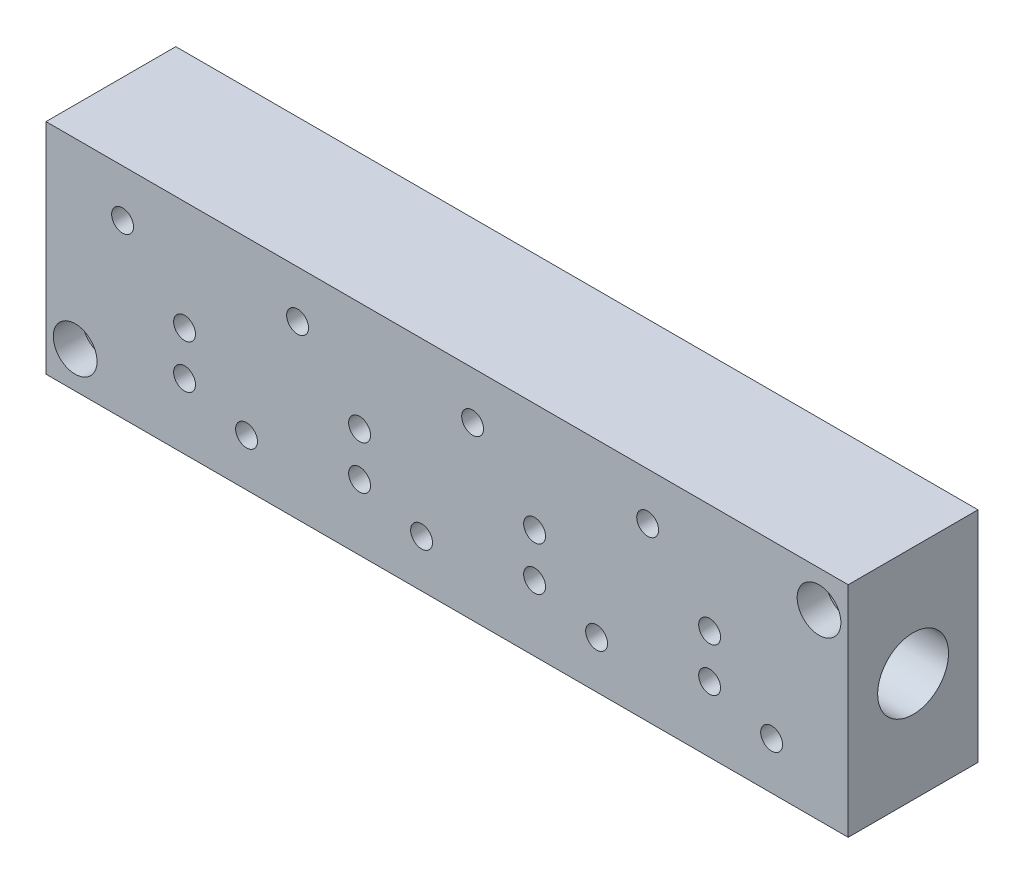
ISO-10303-21;
HEADER;
FILE_DESCRIPTION(('STEP AP214'),'2;1');
FILE_NAME('part.step','',(''),(''),'','','');
FILE_SCHEMA(('AUTOMOTIVE_DESIGN { 1 0 10303 214 1 1 1 1 }'));
ENDSEC;
DATA;
#1=APPLICATION_CONTEXT('core data for automotive mechanical design processes');
#2=APPLICATION_PROTOCOL_DEFINITION('international standard','automotive_design',2000,#1);
#3=PRODUCT_CONTEXT('',#1,'mechanical');
#4=PRODUCT('Part','Part','',(#3));
#5=PRODUCT_RELATED_PRODUCT_CATEGORY('part','',(#4));
#6=PRODUCT_DEFINITION_FORMATION('','',#4);
#7=PRODUCT_DEFINITION_CONTEXT('part definition',#1,'design');
#8=PRODUCT_DEFINITION('design','',#6,#7);
#9=PRODUCT_DEFINITION_SHAPE('','',#8);
#10=(LENGTH_UNIT() NAMED_UNIT(*) SI_UNIT(.MILLI.,.METRE.));
#11=(NAMED_UNIT(*) PLANE_ANGLE_UNIT() SI_UNIT($,.RADIAN.));
#12=(NAMED_UNIT(*) SI_UNIT($,.STERADIAN.) SOLID_ANGLE_UNIT());
#13=UNCERTAINTY_MEASURE_WITH_UNIT(LENGTH_MEASURE(1.E-05),#10,'distance_accuracy_value','');
#14=(GEOMETRIC_REPRESENTATION_CONTEXT(3) GLOBAL_UNCERTAINTY_ASSIGNED_CONTEXT((#13)) GLOBAL_UNIT_ASSIGNED_CONTEXT((#10,
#11,#12)) REPRESENTATION_CONTEXT('',''));
#15=CARTESIAN_POINT('',(0.,0.,0.));
#16=DIRECTION('',(0.,0.,1.));
#17=DIRECTION('',(1.,0.,0.));
#18=AXIS2_PLACEMENT_3D('',#15,#16,#17);
#19=CARTESIAN_POINT('',(91.,9.00000000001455,8.9));
#20=DIRECTION('',(0.,-1.,0.));
#21=DIRECTION('',(1.,0.,0.));
#22=AXIS2_PLACEMENT_3D('',#19,#20,#21);
#23=CONICAL_SURFACE('',#22,4.37499999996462,1.02974425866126);
#24=CARTESIAN_POINT('',(91.,11.628765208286,8.89999999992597));
#25=VERTEX_POINT('',#24);
#26=VERTEX_LOOP('',#25);
#27=FACE_BOUND('',#26,.T.);
#28=CARTESIAN_POINT('',(91.,9.00000000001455,8.9));
#29=DIRECTION('',(0.,-1.,0.));
#30=DIRECTION('',(0.,0.,1.));
#31=AXIS2_PLACEMENT_3D('',#28,#29,#30);
#32=CIRCLE('',#31,4.37499999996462);
#33=CARTESIAN_POINT('',(92.5,8.9999999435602,13.0098205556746));
#34=VERTEX_POINT('',#33);
#35=CARTESIAN_POINT('',(89.5,9.00000000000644,13.0098205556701));
#36=VERTEX_POINT('',#35);
#37=EDGE_CURVE('E178',#34,#36,#32,.F.);
#38=ORIENTED_EDGE('',*,*,#37,.F.);
#39=CARTESIAN_POINT('',(92.5,8.99999997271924,13.0098206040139));
#40=CARTESIAN_POINT('',(92.4999970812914,9.03025502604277,12.9562201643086));
#41=CARTESIAN_POINT('',(92.4990850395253,9.06059732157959,12.9026730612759));
#42=CARTESIAN_POINT('',(92.4953854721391,9.12146408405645,12.7957405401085));
#43=CARTESIAN_POINT('',(92.4925977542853,9.15198856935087,12.7423551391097));
#44=CARTESIAN_POINT('',(92.4813040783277,9.24409364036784,12.5820948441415));
#45=CARTESIAN_POINT('',(92.4698665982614,9.30595279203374,12.4755653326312));
#46=CARTESIAN_POINT('',(92.4375203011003,9.43371853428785,12.2585651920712));
#47=CARTESIAN_POINT('',(92.4161387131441,9.49966498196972,12.1481875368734));
#48=CARTESIAN_POINT('',(92.362127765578,9.63225167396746,11.9307921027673));
#49=CARTESIAN_POINT('',(92.3295198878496,9.69889035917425,11.8237683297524));
#50=CARTESIAN_POINT('',(92.2689278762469,9.80092631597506,11.6647440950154));
#51=CARTESIAN_POINT('',(92.246068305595,9.8361720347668,11.6106906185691));
#52=CARTESIAN_POINT('',(92.1957831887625,9.9066306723,11.5047477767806));
#53=CARTESIAN_POINT('',(92.1683604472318,9.94184359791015,11.4528571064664));
#54=CARTESIAN_POINT('',(92.1085417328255,10.0115423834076,11.3526333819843));
#55=CARTESIAN_POINT('',(92.0762110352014,10.0460318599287,11.3042644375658));
#56=CARTESIAN_POINT('',(92.005521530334,10.1141508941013,11.2115483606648));
#57=CARTESIAN_POINT('',(91.9671711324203,10.1477815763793,11.1671957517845));
#58=CARTESIAN_POINT('',(91.8835300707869,10.2133421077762,11.0838101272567));
#59=CARTESIAN_POINT('',(91.8382280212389,10.2452690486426,11.0447860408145));
#60=CARTESIAN_POINT('',(91.7403661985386,10.3058170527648,10.9738128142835));
#61=CARTESIAN_POINT('',(91.6878092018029,10.334439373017,10.9418609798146));
#62=CARTESIAN_POINT('',(91.575618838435,10.3865438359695,10.8861670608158));
#63=CARTESIAN_POINT('',(91.5159406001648,10.409990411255,10.8624811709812));
#64=CARTESIAN_POINT('',(91.3914304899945,10.449498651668,10.8240142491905));
#65=CARTESIAN_POINT('',(91.3265954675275,10.4655557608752,10.8092387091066));
#66=CARTESIAN_POINT('',(91.1992107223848,10.4880105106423,10.7889826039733));
#67=CARTESIAN_POINT('',(91.1368731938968,10.4950602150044,10.7828705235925));
#68=CARTESIAN_POINT('',(91.011513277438,10.5012677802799,10.7774756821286));
#69=CARTESIAN_POINT('',(90.9484908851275,10.5004255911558,10.7781929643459));
#70=CARTESIAN_POINT('',(90.8227915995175,10.4908431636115,10.7865587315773));
#71=CARTESIAN_POINT('',(90.7601265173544,10.4820144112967,10.7942848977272));
#72=CARTESIAN_POINT('',(90.6377490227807,10.4569388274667,10.8172080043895));
#73=CARTESIAN_POINT('',(90.5780346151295,10.4406970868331,10.8323998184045));
#74=CARTESIAN_POINT('',(90.4640586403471,10.4022618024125,10.870282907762));
#75=CARTESIAN_POINT('',(90.4097347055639,10.3801509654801,10.8928709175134));
#76=CARTESIAN_POINT('',(90.3068729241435,10.3314729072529,10.9451881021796));
#77=CARTESIAN_POINT('',(90.2583363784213,10.3049046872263,10.9749188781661));
#78=CARTESIAN_POINT('',(90.1510469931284,10.2387769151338,11.0523483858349));
#79=CARTESIAN_POINT('',(90.0949471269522,10.197993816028,11.102656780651));
#80=CARTESIAN_POINT('',(89.9933641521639,10.1140283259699,11.2113780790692));
#81=CARTESIAN_POINT('',(89.9479120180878,10.070839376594,11.2698138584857));
#82=CARTESIAN_POINT('',(89.8715644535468,9.98959398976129,11.3837321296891));
#83=CARTESIAN_POINT('',(89.8395310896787,9.95163509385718,11.4385418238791));
#84=CARTESIAN_POINT('',(89.781112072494,9.87556523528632,11.5510305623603));
#85=CARTESIAN_POINT('',(89.7547310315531,9.83745417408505,11.6087119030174));
#86=CARTESIAN_POINT('',(89.7066900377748,9.76117556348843,11.7263414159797));
#87=CARTESIAN_POINT('',(89.6850510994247,9.72300848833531,11.7862983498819));
#88=CARTESIAN_POINT('',(89.6459751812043,9.64687445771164,11.9076974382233));
#89=CARTESIAN_POINT('',(89.6285393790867,9.60890756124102,11.9691400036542));
#90=CARTESIAN_POINT('',(89.5928292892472,9.52217682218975,12.1111936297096));
#91=CARTESIAN_POINT('',(89.5757952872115,9.47349562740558,12.1921657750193));
#92=CARTESIAN_POINT('',(89.5471556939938,9.37655669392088,12.3553414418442));
#93=CARTESIAN_POINT('',(89.5355524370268,9.32829914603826,12.437545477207));
#94=CARTESIAN_POINT('',(89.5174446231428,9.23310474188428,12.6012268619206));
#95=CARTESIAN_POINT('',(89.5108503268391,9.18615990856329,12.682689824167));
#96=CARTESIAN_POINT('',(89.5021420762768,9.09274089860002,12.8460088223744));
#97=CARTESIAN_POINT('',(89.500023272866,9.04626626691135,12.9278643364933));
#98=CARTESIAN_POINT('',(89.5,8.99999999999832,13.0098205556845));
#99=B_SPLINE_CURVE_WITH_KNOTS('',3,(#39,#40,#41,#42,#43,#44,#45,#46,#47,#48,#49,#50,#51,#52,#53,
#54,#55,#56,#57,#58,#59,#60,#61,#62,#63,#64,#65,#66,#67,#68,#69,#70,#71,#72,#73,#74,#75,#76,#77,
#78,#79,#80,#81,#82,#83,#84,#85,#86,#87,#88,#89,#90,#91,#92,#93,#94,#95,#96,#97,#98),
.UNSPECIFIED.,.F.,.F.,(4,2,2,2,2,2,2,2,2,2,2,2,2,2,2,2,2,2,2,2,2,2,2,2,2,2,2,2,2,4),(0.,
0.184634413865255,0.369287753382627,0.740139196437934,1.1307768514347,1.52067112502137,
1.72590374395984,1.93101068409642,2.13359641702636,2.33590162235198,2.53854178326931,
2.74110460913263,2.94501886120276,3.1490586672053,3.33728829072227,3.52551910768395,
3.71586196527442,3.90607430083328,4.09373670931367,4.28144122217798,4.53702580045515,
4.79334489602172,5.01493131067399,5.23669786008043,5.45942813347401,5.68222074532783,
5.97003248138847,6.2579678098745,6.54061426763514,6.82295432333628),.UNSPECIFIED.);
#100=EDGE_CURVE('E672',#34,#36,#99,.T.);
#101=ORIENTED_EDGE('',*,*,#100,.T.);
#102=EDGE_LOOP('',(#38,#101));
#103=FACE_BOUND('',#102,.T.);
#104=ADVANCED_FACE('F16',(#27,#103),#23,.F.);
#105=CARTESIAN_POINT('',(91.,4.49999999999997,8.9));
#106=DIRECTION('',(0.,1.,0.));
#107=DIRECTION('',(-1.,0.,0.));
#108=AXIS2_PLACEMENT_3D('',#105,#106,#107);
#109=CYLINDRICAL_SURFACE('',#108,4.375);
#110=CARTESIAN_POINT('',(91.,7.49999999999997,8.9));
#111=DIRECTION('',(0.,1.,0.));
#112=DIRECTION('',(-1.,0.,0.));
#113=AXIS2_PLACEMENT_3D('',#110,#111,#112);
#114=CIRCLE('',#113,4.375);
#115=CARTESIAN_POINT('',(90.9994721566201,7.50000009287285,13.2749999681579));
#116=VERTEX_POINT('',#115);
#117=EDGE_CURVE('E651',#116,#116,#114,.T.);
#118=ORIENTED_EDGE('',*,*,#117,.F.);
#119=CARTESIAN_POINT('',(90.9994721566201,7.50000009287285,13.2749999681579));
#120=CARTESIAN_POINT('',(91.0404045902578,7.49998467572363,13.2750080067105));
#121=CARTESIAN_POINT('',(91.0813169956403,7.50164784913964,13.274434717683));
#122=CARTESIAN_POINT('',(91.1628288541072,7.50830318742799,13.2721584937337));
#123=CARTESIAN_POINT('',(91.2034283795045,7.51329455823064,13.2704558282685));
#124=CARTESIAN_POINT('',(91.3240745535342,7.53316993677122,13.2637197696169));
#125=CARTESIAN_POINT('',(91.4032805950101,7.55295560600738,13.2570578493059));
#126=CARTESIAN_POINT('',(91.5570119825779,7.60489060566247,13.2400875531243));
#127=CARTESIAN_POINT('',(91.6315391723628,7.63703503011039,13.229780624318));
#128=CARTESIAN_POINT('',(91.7741809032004,7.71269119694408,13.2065641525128));
#129=CARTESIAN_POINT('',(91.8422918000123,7.75620934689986,13.1936531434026));
#130=CARTESIAN_POINT('',(91.9725856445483,7.85501966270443,13.1660620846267));
#131=CARTESIAN_POINT('',(92.0345033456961,7.91064907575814,13.151338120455));
#132=CARTESIAN_POINT('',(92.1483436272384,8.03139584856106,13.122012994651));
#133=CARTESIAN_POINT('',(92.2002630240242,8.09651621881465,13.1074118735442));
#134=CARTESIAN_POINT('',(92.294206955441,8.23686259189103,13.0794899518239));
#135=CARTESIAN_POINT('',(92.3358728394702,8.31234021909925,13.0662232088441));
#136=CARTESIAN_POINT('',(92.4057761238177,8.46972669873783,13.0431606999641));
#137=CARTESIAN_POINT('',(92.4340282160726,8.55162839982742,13.0333611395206));
#138=CARTESIAN_POINT('',(92.4699193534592,8.69489698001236,13.0207060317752));
#139=CARTESIAN_POINT('',(92.481168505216,8.75527687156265,13.0166583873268));
#140=CARTESIAN_POINT('',(92.4962205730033,8.87708977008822,13.0112000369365));
#141=CARTESIAN_POINT('',(92.5000213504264,8.93852307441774,13.009790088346));
#142=CARTESIAN_POINT('',(92.5,8.99999988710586,13.0098205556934));
#143=B_SPLINE_CURVE_WITH_KNOTS('',3,(#119,#120,#121,#122,#123,#124,#125,#126,#127,#128,#129,
#130,#131,#132,#133,#134,#135,#136,#137,#138,#139,#140,#141,#142),.UNSPECIFIED.,.F.,.F.,(4,2,2,
2,2,2,2,2,2,2,2,4),(0.,0.122718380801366,0.245407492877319,0.489862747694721,0.734221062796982,
0.978717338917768,1.23117499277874,1.4837129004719,1.74411826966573,2.0042377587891,
2.1884034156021,2.37262194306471),.UNSPECIFIED.);
#144=EDGE_CURVE('E654',#116,#34,#143,.T.);
#145=ORIENTED_EDGE('',*,*,#144,.T.);
#146=ORIENTED_EDGE('',*,*,#37,.T.);
#147=CARTESIAN_POINT('',(89.5,9.00000000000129,13.0098205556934));
#148=CARTESIAN_POINT('',(89.4999987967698,8.95913740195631,13.0098163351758));
#149=CARTESIAN_POINT('',(89.50167082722,8.91829575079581,13.0104307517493));
#150=CARTESIAN_POINT('',(89.5083315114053,8.83693091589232,13.0128541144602));
#151=CARTESIAN_POINT('',(89.513319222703,8.79640764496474,13.0146627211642));
#152=CARTESIAN_POINT('',(89.533159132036,8.67601939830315,13.0217970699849));
#153=CARTESIAN_POINT('',(89.5528886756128,8.597002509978,13.0288320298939));
#154=CARTESIAN_POINT('',(89.6046330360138,8.44366586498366,13.0466025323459));
#155=CARTESIAN_POINT('',(89.6366405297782,8.36934333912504,13.057335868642));
#156=CARTESIAN_POINT('',(89.7119647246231,8.22705204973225,13.0812854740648));
#157=CARTESIAN_POINT('',(89.7552892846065,8.15908774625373,13.0945034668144));
#158=CARTESIAN_POINT('',(89.8539188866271,8.028697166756,13.1225398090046));
#159=CARTESIAN_POINT('',(89.9096110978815,7.96657271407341,13.1373995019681));
#160=CARTESIAN_POINT('',(90.0305759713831,7.85233336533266,13.1666977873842));
#161=CARTESIAN_POINT('',(90.095850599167,7.80022052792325,13.1811362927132));
#162=CARTESIAN_POINT('',(90.2363797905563,7.70607741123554,13.2084532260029));
#163=CARTESIAN_POINT('',(90.3118633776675,7.6643718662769,13.221276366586));
#164=CARTESIAN_POINT('',(90.469264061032,7.594396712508,13.2434134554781));
#165=CARTESIAN_POINT('',(90.5511748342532,7.56611408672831,13.2527308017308));
#166=CARTESIAN_POINT('',(90.6944436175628,7.5301740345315,13.2647236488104));
#167=CARTESIAN_POINT('',(90.7548237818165,7.51890626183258,13.2685439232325));
#168=CARTESIAN_POINT('',(90.8766126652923,7.50381966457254,13.2736903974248));
#169=CARTESIAN_POINT('',(90.9380214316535,7.50000118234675,13.2750164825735));
#170=CARTESIAN_POINT('',(90.9994721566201,7.50000009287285,13.2749999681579));
#171=B_SPLINE_CURVE_WITH_KNOTS('',3,(#147,#148,#149,#150,#151,#152,#153,#154,#155,#156,#157,
#158,#159,#160,#161,#162,#163,#164,#165,#166,#167,#168,#169,#170),.UNSPECIFIED.,.F.,.F.,(4,2,2,
2,2,2,2,2,2,2,2,4),(0.,0.122508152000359,0.244981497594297,0.488941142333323,0.732755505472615,
0.976739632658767,1.22984038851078,1.48299313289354,1.74326463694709,2.00328322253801,
2.18742203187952,2.37156930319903),.UNSPECIFIED.);
#172=EDGE_CURVE('E659',#36,#116,#171,.T.);
#173=ORIENTED_EDGE('',*,*,#172,.T.);
#174=EDGE_LOOP('',(#118,#145,#146,#173));
#175=FACE_BOUND('',#174,.T.);
#176=ADVANCED_FACE('F18',(#175),#109,.F.);
#177=CARTESIAN_POINT('',(67.,9.00000000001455,8.9));
#178=DIRECTION('',(0.,-1.,0.));
#179=DIRECTION('',(0.,0.,-1.));
#180=AXIS2_PLACEMENT_3D('',#177,#178,#179);
#181=CONICAL_SURFACE('',#180,4.37499999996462,1.02974425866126);
#182=CARTESIAN_POINT('',(67.,11.6287652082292,8.90000000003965));
#183=VERTEX_POINT('',#182);
#184=VERTEX_LOOP('',#183);
#185=FACE_BOUND('',#184,.T.);
#186=CARTESIAN_POINT('',(67.,9.00000000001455,8.9));
#187=DIRECTION('',(0.,-1.,0.));
#188=DIRECTION('',(0.,0.,1.));
#189=AXIS2_PLACEMENT_3D('',#186,#187,#188);
#190=CIRCLE('',#189,4.37499999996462);
#191=CARTESIAN_POINT('',(68.5,8.9999999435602,13.0098205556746));
#192=VERTEX_POINT('',#191);
#193=CARTESIAN_POINT('',(65.5,9.00000000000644,13.0098205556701));
#194=VERTEX_POINT('',#193);
#195=EDGE_CURVE('E87',#192,#194,#190,.F.);
#196=ORIENTED_EDGE('',*,*,#195,.F.);
#197=CARTESIAN_POINT('',(68.5,8.99999997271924,13.0098206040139));
#198=CARTESIAN_POINT('',(68.4999970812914,9.03025502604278,12.9562201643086));
#199=CARTESIAN_POINT('',(68.4990850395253,9.06059732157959,12.9026730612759));
#200=CARTESIAN_POINT('',(68.4953854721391,9.12146408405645,12.7957405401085));
#201=CARTESIAN_POINT('',(68.4925977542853,9.15198856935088,12.7423551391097));
#202=CARTESIAN_POINT('',(68.4813040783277,9.24409364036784,12.5820948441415));
#203=CARTESIAN_POINT('',(68.4698665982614,9.30595279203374,12.4755653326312));
#204=CARTESIAN_POINT('',(68.4375203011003,9.43371853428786,12.2585651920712));
#205=CARTESIAN_POINT('',(68.4161387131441,9.49966498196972,12.1481875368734));
#206=CARTESIAN_POINT('',(68.362127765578,9.63225167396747,11.9307921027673));
#207=CARTESIAN_POINT('',(68.3295198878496,9.69889035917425,11.8237683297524));
#208=CARTESIAN_POINT('',(68.2689278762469,9.80092631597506,11.6647440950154));
#209=CARTESIAN_POINT('',(68.246068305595,9.8361720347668,11.6106906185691));
#210=CARTESIAN_POINT('',(68.1957831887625,9.9066306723,11.5047477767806));
#211=CARTESIAN_POINT('',(68.1683604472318,9.94184359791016,11.4528571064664));
#212=CARTESIAN_POINT('',(68.1085417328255,10.0115423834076,11.3526333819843));
#213=CARTESIAN_POINT('',(68.0762110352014,10.0460318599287,11.3042644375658));
#214=CARTESIAN_POINT('',(68.005521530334,10.1141508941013,11.2115483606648));
#215=CARTESIAN_POINT('',(67.9671711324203,10.1477815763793,11.1671957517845));
#216=CARTESIAN_POINT('',(67.8835300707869,10.2133421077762,11.0838101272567));
#217=CARTESIAN_POINT('',(67.8382280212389,10.2452690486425,11.0447860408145));
#218=CARTESIAN_POINT('',(67.7403661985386,10.3058170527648,10.9738128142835));
#219=CARTESIAN_POINT('',(67.6878092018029,10.334439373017,10.9418609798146));
#220=CARTESIAN_POINT('',(67.5756188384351,10.3865438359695,10.8861670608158));
#221=CARTESIAN_POINT('',(67.5159406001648,10.409990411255,10.8624811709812));
#222=CARTESIAN_POINT('',(67.3914304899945,10.449498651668,10.8240142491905));
#223=CARTESIAN_POINT('',(67.3265954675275,10.4655557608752,10.8092387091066));
#224=CARTESIAN_POINT('',(67.1992107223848,10.4880105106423,10.7889826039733));
#225=CARTESIAN_POINT('',(67.1368731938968,10.4950602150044,10.7828705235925));
#226=CARTESIAN_POINT('',(67.011513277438,10.5012677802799,10.7774756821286));
#227=CARTESIAN_POINT('',(66.9484908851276,10.5004255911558,10.7781929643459));
#228=CARTESIAN_POINT('',(66.8227915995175,10.4908431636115,10.7865587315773));
#229=CARTESIAN_POINT('',(66.7601265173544,10.4820144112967,10.7942848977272));
#230=CARTESIAN_POINT('',(66.6377490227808,10.4569388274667,10.8172080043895));
#231=CARTESIAN_POINT('',(66.5780346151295,10.4406970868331,10.8323998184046));
#232=CARTESIAN_POINT('',(66.4640586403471,10.4022618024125,10.870282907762));
#233=CARTESIAN_POINT('',(66.4097347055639,10.3801509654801,10.8928709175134));
#234=CARTESIAN_POINT('',(66.3068729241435,10.3314729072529,10.9451881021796));
#235=CARTESIAN_POINT('',(66.2583363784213,10.3049046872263,10.9749188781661));
#236=CARTESIAN_POINT('',(66.1510469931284,10.2387769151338,11.0523483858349));
#237=CARTESIAN_POINT('',(66.0949471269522,10.197993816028,11.102656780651));
#238=CARTESIAN_POINT('',(65.993364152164,10.1140283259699,11.2113780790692));
#239=CARTESIAN_POINT('',(65.9479120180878,10.070839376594,11.2698138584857));
#240=CARTESIAN_POINT('',(65.8715644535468,9.98959398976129,11.3837321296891));
#241=CARTESIAN_POINT('',(65.8395310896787,9.95163509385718,11.4385418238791));
#242=CARTESIAN_POINT('',(65.781112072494,9.87556523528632,11.5510305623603));
#243=CARTESIAN_POINT('',(65.7547310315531,9.83745417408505,11.6087119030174));
#244=CARTESIAN_POINT('',(65.7066900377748,9.76117556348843,11.7263414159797));
#245=CARTESIAN_POINT('',(65.6850510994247,9.72300848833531,11.7862983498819));
#246=CARTESIAN_POINT('',(65.6459751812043,9.64687445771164,11.9076974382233));
#247=CARTESIAN_POINT('',(65.6285393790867,9.60890756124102,11.9691400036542));
#248=CARTESIAN_POINT('',(65.5928292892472,9.52217682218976,12.1111936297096));
#249=CARTESIAN_POINT('',(65.5757952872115,9.47349562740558,12.1921657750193));
#250=CARTESIAN_POINT('',(65.5471556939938,9.37655669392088,12.3553414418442));
#251=CARTESIAN_POINT('',(65.5355524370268,9.32829914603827,12.437545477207));
#252=CARTESIAN_POINT('',(65.5174446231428,9.23310474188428,12.6012268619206));
#253=CARTESIAN_POINT('',(65.5108503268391,9.1861599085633,12.682689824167));
#254=CARTESIAN_POINT('',(65.5021420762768,9.09274089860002,12.8460088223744));
#255=CARTESIAN_POINT('',(65.500023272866,9.04626626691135,12.9278643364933));
#256=CARTESIAN_POINT('',(65.5,8.99999999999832,13.0098205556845));
#257=B_SPLINE_CURVE_WITH_KNOTS('',3,(#197,#198,#199,#200,#201,#202,#203,#204,#205,#206,#207,
#208,#209,#210,#211,#212,#213,#214,#215,#216,#217,#218,#219,#220,#221,#222,#223,#224,#225,#226,
#227,#228,#229,#230,#231,#232,#233,#234,#235,#236,#237,#238,#239,#240,#241,#242,#243,#244,#245,
#246,#247,#248,#249,#250,#251,#252,#253,#254,#255,#256),.UNSPECIFIED.,.F.,.F.,(4,2,2,2,2,2,2,2,
2,2,2,2,2,2,2,2,2,2,2,2,2,2,2,2,2,2,2,2,2,4),(0.,0.184634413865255,0.36928775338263,
0.740139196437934,1.1307768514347,1.52067112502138,1.72590374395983,1.93101068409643,
2.13359641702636,2.33590162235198,2.53854178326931,2.74110460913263,2.94501886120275,
3.1490586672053,3.33728829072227,3.52551910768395,3.71586196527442,3.90607430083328,
4.09373670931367,4.28144122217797,4.53702580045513,4.79334489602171,5.01493131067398,
5.23669786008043,5.45942813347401,5.68222074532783,5.97003248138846,6.2579678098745,
6.54061426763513,6.82295432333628),.UNSPECIFIED.);
#258=EDGE_CURVE('E81',#192,#194,#257,.T.);
#259=ORIENTED_EDGE('',*,*,#258,.T.);
#260=EDGE_LOOP('',(#196,#259));
#261=FACE_BOUND('',#260,.T.);
#262=ADVANCED_FACE('F118',(#185,#261),#181,.F.);
#263=CARTESIAN_POINT('',(67.,4.49999999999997,8.9));
#264=DIRECTION('',(0.,1.,0.));
#265=DIRECTION('',(-1.,0.,0.));
#266=AXIS2_PLACEMENT_3D('',#263,#264,#265);
#267=CYLINDRICAL_SURFACE('',#266,4.375);
#268=CARTESIAN_POINT('',(67.,7.49999999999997,8.9));
#269=DIRECTION('',(0.,1.,0.));
#270=DIRECTION('',(-1.,0.,0.));
#271=AXIS2_PLACEMENT_3D('',#268,#269,#270);
#272=CIRCLE('',#271,4.375);
#273=CARTESIAN_POINT('',(66.9994721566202,7.50000009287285,13.2749999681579));
#274=VERTEX_POINT('',#273);
#275=EDGE_CURVE('E648',#274,#274,#272,.T.);
#276=ORIENTED_EDGE('',*,*,#275,.F.);
#277=CARTESIAN_POINT('',(66.9994721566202,7.50000009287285,13.2749999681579));
#278=CARTESIAN_POINT('',(67.0404045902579,7.49998467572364,13.2750080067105));
#279=CARTESIAN_POINT('',(67.0813169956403,7.50164784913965,13.274434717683));
#280=CARTESIAN_POINT('',(67.1628288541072,7.508303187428,13.2721584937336));
#281=CARTESIAN_POINT('',(67.2034283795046,7.51329455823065,13.2704558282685));
#282=CARTESIAN_POINT('',(67.3240745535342,7.53316993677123,13.2637197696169));
#283=CARTESIAN_POINT('',(67.4032805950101,7.5529556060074,13.2570578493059));
#284=CARTESIAN_POINT('',(67.5570119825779,7.6048906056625,13.2400875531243));
#285=CARTESIAN_POINT('',(67.6315391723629,7.63703503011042,13.229780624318));
#286=CARTESIAN_POINT('',(67.7741809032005,7.71269119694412,13.2065641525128));
#287=CARTESIAN_POINT('',(67.8422918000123,7.7562093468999,13.1936531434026));
#288=CARTESIAN_POINT('',(67.9725856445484,7.85501966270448,13.1660620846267));
#289=CARTESIAN_POINT('',(68.0345033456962,7.91064907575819,13.151338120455));
#290=CARTESIAN_POINT('',(68.1483436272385,8.03139584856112,13.122012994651));
#291=CARTESIAN_POINT('',(68.2002630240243,8.09651621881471,13.1074118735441));
#292=CARTESIAN_POINT('',(68.294206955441,8.23686259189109,13.0794899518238));
#293=CARTESIAN_POINT('',(68.3358728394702,8.31234021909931,13.0662232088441));
#294=CARTESIAN_POINT('',(68.4057761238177,8.4697266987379,13.0431606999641));
#295=CARTESIAN_POINT('',(68.4340282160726,8.55162839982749,13.0333611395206));
#296=CARTESIAN_POINT('',(68.4699193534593,8.69489698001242,13.0207060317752));
#297=CARTESIAN_POINT('',(68.481168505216,8.75527687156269,13.0166583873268));
#298=CARTESIAN_POINT('',(68.4962205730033,8.87708977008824,13.0112000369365));
#299=CARTESIAN_POINT('',(68.5000213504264,8.93852307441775,13.009790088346));
#300=CARTESIAN_POINT('',(68.5,8.99999988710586,13.0098205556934));
#301=B_SPLINE_CURVE_WITH_KNOTS('',3,(#277,#278,#279,#280,#281,#282,#283,#284,#285,#286,#287,
#288,#289,#290,#291,#292,#293,#294,#295,#296,#297,#298,#299,#300),.UNSPECIFIED.,.F.,.F.,(4,2,2,
2,2,2,2,2,2,2,2,4),(0.,0.122718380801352,0.245407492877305,0.489862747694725,0.734221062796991,
0.978717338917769,1.23117499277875,1.48371290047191,1.74411826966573,2.0042377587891,
2.18840341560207,2.37262194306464),.UNSPECIFIED.);
#302=EDGE_CURVE('E677',#274,#192,#301,.T.);
#303=ORIENTED_EDGE('',*,*,#302,.T.);
#304=ORIENTED_EDGE('',*,*,#195,.T.);
#305=CARTESIAN_POINT('',(65.5,9.00000000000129,13.0098205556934));
#306=CARTESIAN_POINT('',(65.4999987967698,8.95913740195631,13.0098163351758));
#307=CARTESIAN_POINT('',(65.50167082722,8.91829575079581,13.0104307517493));
#308=CARTESIAN_POINT('',(65.5083315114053,8.83693091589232,13.0128541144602));
#309=CARTESIAN_POINT('',(65.513319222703,8.79640764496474,13.0146627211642));
#310=CARTESIAN_POINT('',(65.5331591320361,8.67601939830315,13.0217970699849));
#311=CARTESIAN_POINT('',(65.5528886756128,8.597002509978,13.0288320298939));
#312=CARTESIAN_POINT('',(65.6046330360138,8.44366586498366,13.0466025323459));
#313=CARTESIAN_POINT('',(65.6366405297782,8.36934333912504,13.057335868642));
#314=CARTESIAN_POINT('',(65.7119647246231,8.22705204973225,13.0812854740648));
#315=CARTESIAN_POINT('',(65.7552892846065,8.15908774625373,13.0945034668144));
#316=CARTESIAN_POINT('',(65.8539188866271,8.028697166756,13.1225398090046));
#317=CARTESIAN_POINT('',(65.9096110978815,7.96657271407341,13.1373995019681));
#318=CARTESIAN_POINT('',(66.0305759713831,7.85233336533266,13.1666977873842));
#319=CARTESIAN_POINT('',(66.095850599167,7.80022052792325,13.1811362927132));
#320=CARTESIAN_POINT('',(66.2363797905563,7.70607741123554,13.2084532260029));
#321=CARTESIAN_POINT('',(66.3118633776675,7.6643718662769,13.221276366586));
#322=CARTESIAN_POINT('',(66.469264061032,7.594396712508,13.2434134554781));
#323=CARTESIAN_POINT('',(66.5511748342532,7.56611408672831,13.2527308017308));
#324=CARTESIAN_POINT('',(66.6944436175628,7.5301740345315,13.2647236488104));
#325=CARTESIAN_POINT('',(66.7548237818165,7.51890626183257,13.2685439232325));
#326=CARTESIAN_POINT('',(66.8766126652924,7.50381966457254,13.2736903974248));
#327=CARTESIAN_POINT('',(66.9380214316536,7.50000118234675,13.2750164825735));
#328=CARTESIAN_POINT('',(66.9994721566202,7.50000009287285,13.2749999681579));
#329=B_SPLINE_CURVE_WITH_KNOTS('',3,(#305,#306,#307,#308,#309,#310,#311,#312,#313,#314,#315,
#316,#317,#318,#319,#320,#321,#322,#323,#324,#325,#326,#327,#328),.UNSPECIFIED.,.F.,.F.,(4,2,2,
2,2,2,2,2,2,2,2,4),(0.,0.122508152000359,0.244981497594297,0.488941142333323,0.732755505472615,
0.976739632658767,1.22984038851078,1.48299313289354,1.74326463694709,2.00328322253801,
2.18742203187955,2.37156930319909),.UNSPECIFIED.);
#330=EDGE_CURVE('E688',#194,#274,#329,.T.);
#331=ORIENTED_EDGE('',*,*,#330,.T.);
#332=EDGE_LOOP('',(#276,#303,#304,#331));
#333=FACE_BOUND('',#332,.T.);
#334=ADVANCED_FACE('F111',(#333),#267,.F.);
#335=CARTESIAN_POINT('',(43.,9.00000000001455,8.9));
#336=DIRECTION('',(0.,-1.,0.));
#337=DIRECTION('',(1.,0.,0.));
#338=AXIS2_PLACEMENT_3D('',#335,#336,#337);
#339=CONICAL_SURFACE('',#338,4.37499999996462,1.02974425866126);
#340=CARTESIAN_POINT('',(43.,11.628765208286,8.89999999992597));
#341=VERTEX_POINT('',#340);
#342=VERTEX_LOOP('',#341);
#343=FACE_BOUND('',#342,.T.);
#344=CARTESIAN_POINT('',(43.,9.00000000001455,8.9));
#345=DIRECTION('',(0.,-1.,0.));
#346=DIRECTION('',(0.,0.,1.));
#347=AXIS2_PLACEMENT_3D('',#344,#345,#346);
#348=CIRCLE('',#347,4.37499999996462);
#349=CARTESIAN_POINT('',(44.5,8.9999999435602,13.0098205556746));
#350=VERTEX_POINT('',#349);
#351=CARTESIAN_POINT('',(41.5,9.00000000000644,13.0098205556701));
#352=VERTEX_POINT('',#351);
#353=EDGE_CURVE('E75',#350,#352,#348,.F.);
#354=ORIENTED_EDGE('',*,*,#353,.F.);
#355=CARTESIAN_POINT('',(44.5,8.99999997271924,13.0098206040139));
#356=CARTESIAN_POINT('',(44.4999970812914,9.03025502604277,12.9562201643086));
#357=CARTESIAN_POINT('',(44.4990850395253,9.06059732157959,12.9026730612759));
#358=CARTESIAN_POINT('',(44.4953854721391,9.12146408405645,12.7957405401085));
#359=CARTESIAN_POINT('',(44.4925977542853,9.15198856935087,12.7423551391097));
#360=CARTESIAN_POINT('',(44.4813040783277,9.24409364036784,12.5820948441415));
#361=CARTESIAN_POINT('',(44.4698665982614,9.30595279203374,12.4755653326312));
#362=CARTESIAN_POINT('',(44.4375203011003,9.43371853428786,12.2585651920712));
#363=CARTESIAN_POINT('',(44.4161387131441,9.49966498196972,12.1481875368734));
#364=CARTESIAN_POINT('',(44.362127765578,9.63225167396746,11.9307921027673));
#365=CARTESIAN_POINT('',(44.3295198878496,9.69889035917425,11.8237683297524));
#366=CARTESIAN_POINT('',(44.2689278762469,9.80092631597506,11.6647440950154));
#367=CARTESIAN_POINT('',(44.246068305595,9.8361720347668,11.6106906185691));
#368=CARTESIAN_POINT('',(44.1957831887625,9.9066306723,11.5047477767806));
#369=CARTESIAN_POINT('',(44.1683604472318,9.94184359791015,11.4528571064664));
#370=CARTESIAN_POINT('',(44.1085417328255,10.0115423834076,11.3526333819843));
#371=CARTESIAN_POINT('',(44.0762110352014,10.0460318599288,11.3042644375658));
#372=CARTESIAN_POINT('',(44.005521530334,10.1141508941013,11.2115483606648));
#373=CARTESIAN_POINT('',(43.9671711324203,10.1477815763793,11.1671957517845));
#374=CARTESIAN_POINT('',(43.8835300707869,10.2133421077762,11.0838101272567));
#375=CARTESIAN_POINT('',(43.8382280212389,10.2452690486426,11.0447860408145));
#376=CARTESIAN_POINT('',(43.7403661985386,10.3058170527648,10.9738128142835));
#377=CARTESIAN_POINT('',(43.6878092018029,10.334439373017,10.9418609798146));
#378=CARTESIAN_POINT('',(43.575618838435,10.3865438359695,10.8861670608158));
#379=CARTESIAN_POINT('',(43.5159406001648,10.409990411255,10.8624811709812));
#380=CARTESIAN_POINT('',(43.3914304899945,10.449498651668,10.8240142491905));
#381=CARTESIAN_POINT('',(43.3265954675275,10.4655557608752,10.8092387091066));
#382=CARTESIAN_POINT('',(43.1992107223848,10.4880105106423,10.7889826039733));
#383=CARTESIAN_POINT('',(43.1368731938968,10.4950602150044,10.7828705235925));
#384=CARTESIAN_POINT('',(43.011513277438,10.5012677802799,10.7774756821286));
#385=CARTESIAN_POINT('',(42.9484908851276,10.5004255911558,10.7781929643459));
#386=CARTESIAN_POINT('',(42.8227915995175,10.4908431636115,10.7865587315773));
#387=CARTESIAN_POINT('',(42.7601265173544,10.4820144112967,10.7942848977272));
#388=CARTESIAN_POINT('',(42.6377490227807,10.4569388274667,10.8172080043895));
#389=CARTESIAN_POINT('',(42.5780346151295,10.4406970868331,10.8323998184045));
#390=CARTESIAN_POINT('',(42.4640586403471,10.4022618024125,10.870282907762));
#391=CARTESIAN_POINT('',(42.4097347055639,10.3801509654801,10.8928709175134));
#392=CARTESIAN_POINT('',(42.3068729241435,10.3314729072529,10.9451881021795));
#393=CARTESIAN_POINT('',(42.2583363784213,10.3049046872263,10.9749188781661));
#394=CARTESIAN_POINT('',(42.1510469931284,10.2387769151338,11.0523483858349));
#395=CARTESIAN_POINT('',(42.0949471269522,10.197993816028,11.102656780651));
#396=CARTESIAN_POINT('',(41.993364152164,10.1140283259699,11.2113780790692));
#397=CARTESIAN_POINT('',(41.9479120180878,10.070839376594,11.2698138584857));
#398=CARTESIAN_POINT('',(41.8715644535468,9.98959398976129,11.3837321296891));
#399=CARTESIAN_POINT('',(41.8395310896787,9.95163509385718,11.4385418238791));
#400=CARTESIAN_POINT('',(41.7811120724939,9.87556523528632,11.5510305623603));
#401=CARTESIAN_POINT('',(41.7547310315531,9.83745417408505,11.6087119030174));
#402=CARTESIAN_POINT('',(41.7066900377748,9.76117556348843,11.7263414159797));
#403=CARTESIAN_POINT('',(41.6850510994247,9.72300848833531,11.7862983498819));
#404=CARTESIAN_POINT('',(41.6459751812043,9.64687445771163,11.9076974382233));
#405=CARTESIAN_POINT('',(41.6285393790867,9.60890756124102,11.9691400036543));
#406=CARTESIAN_POINT('',(41.5928292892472,9.52217682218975,12.1111936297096));
#407=CARTESIAN_POINT('',(41.5757952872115,9.47349562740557,12.1921657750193));
#408=CARTESIAN_POINT('',(41.5471556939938,9.37655669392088,12.3553414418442));
#409=CARTESIAN_POINT('',(41.5355524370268,9.32829914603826,12.437545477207));
#410=CARTESIAN_POINT('',(41.5174446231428,9.23310474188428,12.6012268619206));
#411=CARTESIAN_POINT('',(41.5108503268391,9.1861599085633,12.682689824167));
#412=CARTESIAN_POINT('',(41.5021420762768,9.09274089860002,12.8460088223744));
#413=CARTESIAN_POINT('',(41.500023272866,9.04626626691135,12.9278643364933));
#414=CARTESIAN_POINT('',(41.5,8.99999999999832,13.0098205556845));
#415=B_SPLINE_CURVE_WITH_KNOTS('',3,(#355,#356,#357,#358,#359,#360,#361,#362,#363,#364,#365,
#366,#367,#368,#369,#370,#371,#372,#373,#374,#375,#376,#377,#378,#379,#380,#381,#382,#383,#384,
#385,#386,#387,#388,#389,#390,#391,#392,#393,#394,#395,#396,#397,#398,#399,#400,#401,#402,#403,
#404,#405,#406,#407,#408,#409,#410,#411,#412,#413,#414),.UNSPECIFIED.,.F.,.F.,(4,2,2,2,2,2,2,2,
2,2,2,2,2,2,2,2,2,2,2,2,2,2,2,2,2,2,2,2,2,4),(0.,0.184634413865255,0.369287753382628,
0.740139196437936,1.1307768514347,1.52067112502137,1.72590374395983,1.93101068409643,
2.13359641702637,2.33590162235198,2.53854178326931,2.74110460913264,2.94501886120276,
3.14905866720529,3.33728829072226,3.52551910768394,3.71586196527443,3.90607430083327,
4.09373670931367,4.28144122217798,4.53702580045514,4.79334489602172,5.014931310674,
5.23669786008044,5.45942813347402,5.68222074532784,5.97003248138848,6.2579678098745,
6.54061426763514,6.82295432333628),.UNSPECIFIED.);
#416=EDGE_CURVE('E21',#350,#352,#415,.T.);
#417=ORIENTED_EDGE('',*,*,#416,.T.);
#418=EDGE_LOOP('',(#354,#417));
#419=FACE_BOUND('',#418,.T.);
#420=ADVANCED_FACE('F86',(#343,#419),#339,.F.);
#421=CARTESIAN_POINT('',(43.,4.49999999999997,8.9));
#422=DIRECTION('',(0.,1.,0.));
#423=DIRECTION('',(-1.,0.,0.));
#424=AXIS2_PLACEMENT_3D('',#421,#422,#423);
#425=CYLINDRICAL_SURFACE('',#424,4.375);
#426=CARTESIAN_POINT('',(43.,7.49999999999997,8.9));
#427=DIRECTION('',(0.,1.,0.));
#428=DIRECTION('',(-1.,0.,0.));
#429=AXIS2_PLACEMENT_3D('',#426,#427,#428);
#430=CIRCLE('',#429,4.375);
#431=CARTESIAN_POINT('',(42.9994721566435,7.50000009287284,13.2749999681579));
#432=VERTEX_POINT('',#431);
#433=EDGE_CURVE('E78',#432,#432,#430,.T.);
#434=ORIENTED_EDGE('',*,*,#433,.F.);
#435=CARTESIAN_POINT('',(42.9994721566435,7.50000009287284,13.2749999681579));
#436=CARTESIAN_POINT('',(43.0404045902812,7.49998467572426,13.2750080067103));
#437=CARTESIAN_POINT('',(43.0813169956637,7.50164784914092,13.2744347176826));
#438=CARTESIAN_POINT('',(43.1628288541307,7.50830318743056,13.2721584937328));
#439=CARTESIAN_POINT('',(43.203428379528,7.51329455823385,13.2704558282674));
#440=CARTESIAN_POINT('',(43.3240745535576,7.53316993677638,13.2637197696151));
#441=CARTESIAN_POINT('',(43.4032805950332,7.55295560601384,13.2570578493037));
#442=CARTESIAN_POINT('',(43.5570119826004,7.60489060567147,13.2400875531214));
#443=CARTESIAN_POINT('',(43.631539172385,7.63703503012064,13.2297806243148));
#444=CARTESIAN_POINT('',(43.7741809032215,7.71269119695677,13.206564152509));
#445=CARTESIAN_POINT('',(43.8422918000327,7.75620934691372,13.1936531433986));
#446=CARTESIAN_POINT('',(43.9725856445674,7.85501966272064,13.1660620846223));
#447=CARTESIAN_POINT('',(44.0345033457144,7.91064907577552,13.1513381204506));
#448=CARTESIAN_POINT('',(44.148343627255,8.03139584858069,13.1220129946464));
#449=CARTESIAN_POINT('',(44.2002630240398,8.09651621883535,13.1074118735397));
#450=CARTESIAN_POINT('',(44.2942069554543,8.23686259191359,13.0794899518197));
#451=CARTESIAN_POINT('',(44.3358728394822,8.31234021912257,13.0662232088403));
#452=CARTESIAN_POINT('',(44.405776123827,8.46972669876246,13.043160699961));
#453=CARTESIAN_POINT('',(44.4340282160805,8.55162839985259,13.0333611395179));
#454=CARTESIAN_POINT('',(44.4699193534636,8.69489698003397,13.0207060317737));
#455=CARTESIAN_POINT('',(44.4811685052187,8.75527687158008,13.0166583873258));
#456=CARTESIAN_POINT('',(44.4962205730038,8.87708977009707,13.0112000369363));
#457=CARTESIAN_POINT('',(44.5000213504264,8.93852307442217,13.009790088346));
#458=CARTESIAN_POINT('',(44.5,8.99999988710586,13.0098205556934));
#459=B_SPLINE_CURVE_WITH_KNOTS('',3,(#435,#436,#437,#438,#439,#440,#441,#442,#443,#444,#445,
#446,#447,#448,#449,#450,#451,#452,#453,#454,#455,#456,#457,#458),.UNSPECIFIED.,.F.,.F.,(4,2,2,
2,2,2,2,2,2,2,2,4),(0.,0.122718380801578,0.245407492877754,0.48986274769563,0.734221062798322,
0.97871733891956,1.23117499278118,1.48371290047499,1.74411826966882,2.00423775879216,
2.18840341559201,2.37262194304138),.UNSPECIFIED.);
#460=EDGE_CURVE('E72',#432,#350,#459,.T.);
#461=ORIENTED_EDGE('',*,*,#460,.T.);
#462=ORIENTED_EDGE('',*,*,#353,.T.);
#463=CARTESIAN_POINT('',(41.5,9.00000000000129,13.0098205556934));
#464=CARTESIAN_POINT('',(41.4999987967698,8.95913740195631,13.0098163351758));
#465=CARTESIAN_POINT('',(41.50167082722,8.91829575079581,13.0104307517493));
#466=CARTESIAN_POINT('',(41.5083315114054,8.83693091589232,13.0128541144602));
#467=CARTESIAN_POINT('',(41.513319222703,8.79640764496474,13.0146627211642));
#468=CARTESIAN_POINT('',(41.533159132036,8.67601939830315,13.0217970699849));
#469=CARTESIAN_POINT('',(41.5528886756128,8.597002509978,13.0288320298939));
#470=CARTESIAN_POINT('',(41.6046330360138,8.44366586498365,13.0466025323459));
#471=CARTESIAN_POINT('',(41.6366405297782,8.36934333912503,13.057335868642));
#472=CARTESIAN_POINT('',(41.7119647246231,8.22705204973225,13.0812854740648));
#473=CARTESIAN_POINT('',(41.7552892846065,8.15908774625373,13.0945034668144));
#474=CARTESIAN_POINT('',(41.8539188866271,8.028697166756,13.1225398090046));
#475=CARTESIAN_POINT('',(41.9096110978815,7.96657271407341,13.1373995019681));
#476=CARTESIAN_POINT('',(42.0305759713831,7.85233336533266,13.1666977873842));
#477=CARTESIAN_POINT('',(42.095850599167,7.80022052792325,13.1811362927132));
#478=CARTESIAN_POINT('',(42.2363797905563,7.70607741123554,13.2084532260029));
#479=CARTESIAN_POINT('',(42.3118633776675,7.66437186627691,13.221276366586));
#480=CARTESIAN_POINT('',(42.469264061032,7.59439671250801,13.2434134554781));
#481=CARTESIAN_POINT('',(42.5511748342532,7.56611408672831,13.2527308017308));
#482=CARTESIAN_POINT('',(42.6944436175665,7.53017403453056,13.2647236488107));
#483=CARTESIAN_POINT('',(42.7548237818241,7.51890626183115,13.268543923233));
#484=CARTESIAN_POINT('',(42.8766126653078,7.5038196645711,13.2736903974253));
#485=CARTESIAN_POINT('',(42.938021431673,7.50000118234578,13.2750164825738));
#486=CARTESIAN_POINT('',(42.9994721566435,7.50000009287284,13.2749999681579));
#487=B_SPLINE_CURVE_WITH_KNOTS('',3,(#463,#464,#465,#466,#467,#468,#469,#470,#471,#472,#473,
#474,#475,#476,#477,#478,#479,#480,#481,#482,#483,#484,#485,#486),.UNSPECIFIED.,.F.,.F.,(4,2,2,
2,2,2,2,2,2,2,2,4),(0.,0.122508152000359,0.244981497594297,0.488941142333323,0.732755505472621,
0.976739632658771,1.22984038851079,1.48299313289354,1.74326463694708,2.00328322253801,
2.18742203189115,2.37156930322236),.UNSPECIFIED.);
#488=EDGE_CURVE('E82',#352,#432,#487,.T.);
#489=ORIENTED_EDGE('',*,*,#488,.T.);
#490=EDGE_LOOP('',(#434,#461,#462,#489));
#491=FACE_BOUND('',#490,.T.);
#492=ADVANCED_FACE('F74',(#491),#425,.F.);
#493=CARTESIAN_POINT('',(43.,8.99999999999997,17.8));
#494=DIRECTION('',(0.,0.,-1.));
#495=DIRECTION('',(-1.,0.,0.));
#496=AXIS2_PLACEMENT_3D('',#493,#494,#495);
#497=CYLINDRICAL_SURFACE('',#496,1.5);
#498=CARTESIAN_POINT('',(43.,8.99999999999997,17.8));
#499=DIRECTION('',(0.,0.,-1.));
#500=DIRECTION('',(-1.,0.,0.));
#501=AXIS2_PLACEMENT_3D('',#498,#499,#500);
#502=CIRCLE('',#501,1.5);
#503=CARTESIAN_POINT('',(41.5,8.99999999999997,17.8));
#504=VERTEX_POINT('',#503);
#505=EDGE_CURVE('E643',#504,#504,#502,.F.);
#506=ORIENTED_EDGE('',*,*,#505,.T.);
#507=EDGE_LOOP('',(#506));
#508=FACE_BOUND('',#507,.T.);
#509=ORIENTED_EDGE('',*,*,#416,.F.);
#510=ORIENTED_EDGE('',*,*,#460,.F.);
#511=ORIENTED_EDGE('',*,*,#488,.F.);
#512=EDGE_LOOP('',(#509,#510,#511));
#513=FACE_BOUND('',#512,.T.);
#514=ADVANCED_FACE('F89',(#508,#513),#497,.F.);
#515=CARTESIAN_POINT('',(67.,8.99999999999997,17.8));
#516=DIRECTION('',(0.,0.,-1.));
#517=DIRECTION('',(-1.,0.,0.));
#518=AXIS2_PLACEMENT_3D('',#515,#516,#517);
#519=CYLINDRICAL_SURFACE('',#518,1.5);
#520=CARTESIAN_POINT('',(67.,8.99999999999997,17.8));
#521=DIRECTION('',(0.,0.,-1.));
#522=DIRECTION('',(-1.,0.,0.));
#523=AXIS2_PLACEMENT_3D('',#520,#521,#522);
#524=CIRCLE('',#523,1.5);
#525=CARTESIAN_POINT('',(65.5,8.99999999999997,17.8));
#526=VERTEX_POINT('',#525);
#527=EDGE_CURVE('E481',#526,#526,#524,.F.);
#528=ORIENTED_EDGE('',*,*,#527,.T.);
#529=EDGE_LOOP('',(#528));
#530=FACE_BOUND('',#529,.T.);
#531=ORIENTED_EDGE('',*,*,#258,.F.);
#532=ORIENTED_EDGE('',*,*,#302,.F.);
#533=ORIENTED_EDGE('',*,*,#330,.F.);
#534=EDGE_LOOP('',(#531,#532,#533));
#535=FACE_BOUND('',#534,.T.);
#536=ADVANCED_FACE('F103',(#530,#535),#519,.F.);
#537=CARTESIAN_POINT('',(91.,8.99999999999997,17.8));
#538=DIRECTION('',(0.,0.,-1.));
#539=DIRECTION('',(-1.,0.,0.));
#540=AXIS2_PLACEMENT_3D('',#537,#538,#539);
#541=CYLINDRICAL_SURFACE('',#540,1.5);
#542=CARTESIAN_POINT('',(91.,8.99999999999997,17.8));
#543=DIRECTION('',(0.,0.,-1.));
#544=DIRECTION('',(-1.,0.,0.));
#545=AXIS2_PLACEMENT_3D('',#542,#543,#544);
#546=CIRCLE('',#545,1.5);
#547=CARTESIAN_POINT('',(89.5,8.99999999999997,17.8));
#548=VERTEX_POINT('',#547);
#549=EDGE_CURVE('E157',#548,#548,#546,.F.);
#550=ORIENTED_EDGE('',*,*,#549,.T.);
#551=EDGE_LOOP('',(#550));
#552=FACE_BOUND('',#551,.T.);
#553=ORIENTED_EDGE('',*,*,#100,.F.);
#554=ORIENTED_EDGE('',*,*,#144,.F.);
#555=ORIENTED_EDGE('',*,*,#172,.F.);
#556=EDGE_LOOP('',(#553,#554,#555));
#557=FACE_BOUND('',#556,.T.);
#558=ADVANCED_FACE('F664',(#552,#557),#541,.F.);
#559=CARTESIAN_POINT('',(86.14,7.49999999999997,8.9));
#560=DIRECTION('',(0.,-1.,0.));
#561=DIRECTION('',(1.,0.,0.));
#562=AXIS2_PLACEMENT_3D('',#559,#560,#561);
#563=PLANE('',#562);
#564=CARTESIAN_POINT('',(91.,7.49999999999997,8.9));
#565=DIRECTION('',(0.,1.,0.));
#566=DIRECTION('',(-1.,0.,0.));
#567=AXIS2_PLACEMENT_3D('',#564,#565,#566);
#568=CIRCLE('',#567,4.86);
#569=CARTESIAN_POINT('',(86.14,7.49999999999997,8.9));
#570=VERTEX_POINT('',#569);
#571=EDGE_CURVE('E503',#570,#570,#568,.F.);
#572=ORIENTED_EDGE('',*,*,#571,.T.);
#573=EDGE_LOOP('',(#572));
#574=FACE_BOUND('',#573,.T.);
#575=ORIENTED_EDGE('',*,*,#117,.T.);
#576=EDGE_LOOP('',(#575));
#577=FACE_BOUND('',#576,.T.);
#578=ADVANCED_FACE('F668',(#574,#577),#563,.T.);
#579=CARTESIAN_POINT('',(62.14,7.49999999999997,8.9));
#580=DIRECTION('',(0.,-1.,0.));
#581=DIRECTION('',(1.,0.,0.));
#582=AXIS2_PLACEMENT_3D('',#579,#580,#581);
#583=PLANE('',#582);
#584=CARTESIAN_POINT('',(67.,7.49999999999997,8.9));
#585=DIRECTION('',(0.,1.,0.));
#586=DIRECTION('',(-1.,0.,0.));
#587=AXIS2_PLACEMENT_3D('',#584,#585,#586);
#588=CIRCLE('',#587,4.86);
#589=CARTESIAN_POINT('',(62.14,7.49999999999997,8.9));
#590=VERTEX_POINT('',#589);
#591=EDGE_CURVE('E506',#590,#590,#588,.F.);
#592=ORIENTED_EDGE('',*,*,#591,.T.);
#593=EDGE_LOOP('',(#592));
#594=FACE_BOUND('',#593,.T.);
#595=ORIENTED_EDGE('',*,*,#275,.T.);
#596=EDGE_LOOP('',(#595));
#597=FACE_BOUND('',#596,.T.);
#598=ADVANCED_FACE('F720',(#594,#597),#583,.T.);
#599=CARTESIAN_POINT('',(38.14,7.49999999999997,8.9));
#600=DIRECTION('',(0.,-1.,0.));
#601=DIRECTION('',(1.,0.,0.));
#602=AXIS2_PLACEMENT_3D('',#599,#600,#601);
#603=PLANE('',#602);
#604=CARTESIAN_POINT('',(43.,7.49999999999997,8.9));
#605=DIRECTION('',(0.,1.,0.));
#606=DIRECTION('',(-1.,0.,0.));
#607=AXIS2_PLACEMENT_3D('',#604,#605,#606);
#608=CIRCLE('',#607,4.86);
#609=CARTESIAN_POINT('',(38.14,7.49999999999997,8.9));
#610=VERTEX_POINT('',#609);
#611=EDGE_CURVE('E509',#610,#610,#608,.F.);
#612=ORIENTED_EDGE('',*,*,#611,.T.);
#613=EDGE_LOOP('',(#612));
#614=FACE_BOUND('',#613,.T.);
#615=ORIENTED_EDGE('',*,*,#433,.T.);
#616=EDGE_LOOP('',(#615));
#617=FACE_BOUND('',#616,.T.);
#618=ADVANCED_FACE('F165',(#614,#617),#603,.T.);
#619=CARTESIAN_POINT('',(19.,8.99999999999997,17.8));
#620=DIRECTION('',(0.,0.,-1.));
#621=DIRECTION('',(-1.,0.,0.));
#622=AXIS2_PLACEMENT_3D('',#619,#620,#621);
#623=CYLINDRICAL_SURFACE('',#622,1.5);
#624=CARTESIAN_POINT('',(19.,8.99999999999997,17.8));
#625=DIRECTION('',(0.,0.,-1.));
#626=DIRECTION('',(-1.,0.,0.));
#627=AXIS2_PLACEMENT_3D('',#624,#625,#626);
#628=CIRCLE('',#627,1.5);
#629=CARTESIAN_POINT('',(17.5,8.99999999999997,17.8));
#630=VERTEX_POINT('',#629);
#631=EDGE_CURVE('E39',#630,#630,#628,.F.);
#632=ORIENTED_EDGE('',*,*,#631,.T.);
#633=EDGE_LOOP('',(#632));
#634=FACE_BOUND('',#633,.T.);
#635=CARTESIAN_POINT('',(20.5,8.99999998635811,13.0098205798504));
#636=CARTESIAN_POINT('',(20.4999970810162,9.0302550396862,12.9562201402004));
#637=CARTESIAN_POINT('',(20.499085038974,9.06059733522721,12.9026730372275));
#638=CARTESIAN_POINT('',(20.4953854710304,9.12146409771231,12.7957405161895));
#639=CARTESIAN_POINT('',(20.4925977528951,9.15198858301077,12.7423551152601));
#640=CARTESIAN_POINT('',(20.4813040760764,9.24409365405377,12.5820948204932));
#641=CARTESIAN_POINT('',(20.4698665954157,9.30595280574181,12.4755653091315));
#642=CARTESIAN_POINT('',(20.4375202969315,9.43371854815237,12.2585651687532));
#643=CARTESIAN_POINT('',(20.4161387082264,9.4996649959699,12.1481875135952));
#644=CARTESIAN_POINT('',(20.3621277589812,9.63225168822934,11.9307920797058));
#645=CARTESIAN_POINT('',(20.3295198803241,9.69889037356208,11.8237683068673));
#646=CARTESIAN_POINT('',(20.2689278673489,9.80092633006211,11.6647440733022));
#647=CARTESIAN_POINT('',(20.2460682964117,9.83617204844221,11.6106905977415));
#648=CARTESIAN_POINT('',(20.1957831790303,9.9066306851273,11.5047477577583));
#649=CARTESIAN_POINT('',(20.168360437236,9.94184361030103,11.4528570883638));
#650=CARTESIAN_POINT('',(20.1085417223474,10.0115423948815,11.3526333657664));
#651=CARTESIAN_POINT('',(20.076211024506,10.0460318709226,11.3042644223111));
#652=CARTESIAN_POINT('',(20.0055215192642,10.1141509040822,11.2115483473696));
#653=CARTESIAN_POINT('',(19.9671711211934,10.1477815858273,11.1671957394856));
#654=CARTESIAN_POINT('',(19.8835300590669,10.2133421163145,11.083810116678));
#655=CARTESIAN_POINT('',(19.8382280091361,10.2452690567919,11.0447860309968));
#656=CARTESIAN_POINT('',(19.7403661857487,10.3058170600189,10.9738128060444));
#657=CARTESIAN_POINT('',(19.6878091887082,10.3344393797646,10.9418609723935));
#658=CARTESIAN_POINT('',(19.5756188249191,10.386543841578,10.8861670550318));
#659=CARTESIAN_POINT('',(19.5159405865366,10.4099904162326,10.8624811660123));
#660=CARTESIAN_POINT('',(19.3914304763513,10.4494986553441,10.8240142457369));
#661=CARTESIAN_POINT('',(19.3265954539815,10.4655557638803,10.8092387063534));
#662=CARTESIAN_POINT('',(19.1992107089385,10.488010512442,10.78898260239));
#663=CARTESIAN_POINT('',(19.1368731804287,10.4950602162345,10.7828705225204));
#664=CARTESIAN_POINT('',(19.0115132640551,10.5012677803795,10.7774756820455));
#665=CARTESIAN_POINT('',(18.9484908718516,10.5004255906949,10.7781929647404));
#666=CARTESIAN_POINT('',(18.822791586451,10.4908431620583,10.7865587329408));
#667=CARTESIAN_POINT('',(18.7601265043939,10.4820144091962,10.794284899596));
#668=CARTESIAN_POINT('',(18.6377490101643,10.4569388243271,10.8172080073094));
#669=CARTESIAN_POINT('',(18.5780346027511,10.4406970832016,10.8323998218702));
#670=CARTESIAN_POINT('',(18.464058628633,10.4022617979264,10.870282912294));
#671=CARTESIAN_POINT('',(18.4097346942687,10.380150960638,10.8928709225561));
#672=CARTESIAN_POINT('',(18.3068729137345,10.3314729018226,10.9451881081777));
#673=CARTESIAN_POINT('',(18.25833636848,10.3049046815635,10.9749188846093));
#674=CARTESIAN_POINT('',(18.1510469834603,10.238776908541,11.0523483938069));
#675=CARTESIAN_POINT('',(18.0949471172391,10.1979938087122,11.1026567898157));
#676=CARTESIAN_POINT('',(17.9933641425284,10.1140283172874,11.2113780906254));
#677=CARTESIAN_POINT('',(17.9479120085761,10.0708393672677,11.2698138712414));
#678=CARTESIAN_POINT('',(17.8715644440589,9.98959397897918,11.3837321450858));
#679=CARTESIAN_POINT('',(17.8395310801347,9.95163508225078,11.4385418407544));
#680=CARTESIAN_POINT('',(17.7811120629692,9.87556522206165,11.5510305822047));
#681=CARTESIAN_POINT('',(17.754731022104,9.83745416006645,11.6087119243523));
#682=CARTESIAN_POINT('',(17.7066900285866,9.76117554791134,11.7263414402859));
#683=CARTESIAN_POINT('',(17.685051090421,9.72300847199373,11.7862983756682));
#684=CARTESIAN_POINT('',(17.6459751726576,9.64687443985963,11.9076974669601));
#685=CARTESIAN_POINT('',(17.6285393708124,9.60890754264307,11.9691400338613));
#686=CARTESIAN_POINT('',(17.5928292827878,9.52217680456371,12.1111936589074));
#687=CARTESIAN_POINT('',(17.5757952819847,9.47349561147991,12.192165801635));
#688=CARTESIAN_POINT('',(17.5471556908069,9.37655668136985,12.3553414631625));
#689=CARTESIAN_POINT('',(17.5355524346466,9.32829913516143,12.4375454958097));
#690=CARTESIAN_POINT('',(17.5174446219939,9.23310473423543,12.6012268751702));
#691=CARTESIAN_POINT('',(17.5108503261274,9.18615990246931,12.6826898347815));
#692=CARTESIAN_POINT('',(17.5021420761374,9.09274089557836,12.8460088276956));
#693=CARTESIAN_POINT('',(17.5000232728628,9.04626626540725,12.9278643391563));
#694=CARTESIAN_POINT('',(17.5,8.99999999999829,13.0098205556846));
#695=B_SPLINE_CURVE_WITH_KNOTS('',3,(#635,#636,#637,#638,#639,#640,#641,#642,#643,#644,#645,
#646,#647,#648,#649,#650,#651,#652,#653,#654,#655,#656,#657,#658,#659,#660,#661,#662,#663,#664,
#665,#666,#667,#668,#669,#670,#671,#672,#673,#674,#675,#676,#677,#678,#679,#680,#681,#682,#683,
#684,#685,#686,#687,#688,#689,#690,#691,#692,#693,#694),.UNSPECIFIED.,.F.,.F.,(4,2,2,2,2,2,2,2,
2,2,2,2,2,2,2,2,2,2,2,2,2,2,2,2,2,2,2,2,2,4),(0.,0.184634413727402,0.369287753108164,
0.740139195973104,1.13077685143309,1.52067112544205,1.72590374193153,1.93101067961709,
2.13359641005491,2.3359016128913,2.53854177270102,2.74110459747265,2.94501884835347,
3.14905865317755,3.33728827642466,3.52551909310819,3.71586195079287,3.90607428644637,
4.09373669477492,4.28144120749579,4.53702578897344,4.79334488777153,5.01493130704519,
5.23669786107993,5.4594281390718,5.68222075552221,5.97003248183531,6.25796780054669,
6.5406142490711,6.82295429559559),.UNSPECIFIED.);
#696=CARTESIAN_POINT('',(20.5,8.99999999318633,13.0098205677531));
#697=VERTEX_POINT('',#696);
#698=CARTESIAN_POINT('',(17.5,9.00000000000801,13.0098205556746));
#699=VERTEX_POINT('',#698);
#700=EDGE_CURVE('E143',#697,#699,#695,.T.);
#701=ORIENTED_EDGE('',*,*,#700,.F.);
#702=CARTESIAN_POINT('',(18.9994721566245,7.50000009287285,13.2749999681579));
#703=CARTESIAN_POINT('',(19.0404045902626,7.49998467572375,13.2750080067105));
#704=CARTESIAN_POINT('',(19.0813169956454,7.50164784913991,13.2744347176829));
#705=CARTESIAN_POINT('',(19.162828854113,7.50830318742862,13.2721584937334));
#706=CARTESIAN_POINT('',(19.2034283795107,7.51329455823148,13.2704558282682));
#707=CARTESIAN_POINT('',(19.3240745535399,7.53316993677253,13.2637197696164));
#708=CARTESIAN_POINT('',(19.4032805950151,7.55295560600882,13.2570578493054));
#709=CARTESIAN_POINT('',(19.5570119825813,7.60489060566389,13.2400875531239));
#710=CARTESIAN_POINT('',(19.6315391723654,7.63703503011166,13.2297806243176));
#711=CARTESIAN_POINT('',(19.7741809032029,7.71269119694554,13.2065641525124));
#712=CARTESIAN_POINT('',(19.8422918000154,7.75620934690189,13.193653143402));
#713=CARTESIAN_POINT('',(19.9725856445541,7.85501966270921,13.1660620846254));
#714=CARTESIAN_POINT('',(20.0345033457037,7.91064907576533,13.1513381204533));
#715=CARTESIAN_POINT('',(20.148343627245,8.03139584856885,13.1220129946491));
#716=CARTESIAN_POINT('',(20.2002630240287,8.09651621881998,13.1074118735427));
#717=CARTESIAN_POINT('',(20.2942069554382,8.23686259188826,13.0794899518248));
#718=CARTESIAN_POINT('',(20.3358728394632,8.31234021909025,13.0662232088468));
#719=CARTESIAN_POINT('',(20.4057761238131,8.46972669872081,13.0431606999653));
#720=CARTESIAN_POINT('',(20.4340282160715,8.55162839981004,13.0333611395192));
#721=CARTESIAN_POINT('',(20.4699193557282,8.6948969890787,13.0207060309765));
#722=CARTESIAN_POINT('',(20.4811685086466,8.75527689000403,13.0166583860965));
#723=CARTESIAN_POINT('',(20.496220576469,8.87708980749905,13.0112000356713));
#724=CARTESIAN_POINT('',(20.5000213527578,8.93852312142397,13.0097900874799));
#725=CARTESIAN_POINT('',(20.5,8.99999994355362,13.0098205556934));
#726=B_SPLINE_CURVE_WITH_KNOTS('',3,(#702,#703,#704,#705,#706,#707,#708,#709,#710,#711,#712,
#713,#714,#715,#716,#717,#718,#719,#720,#721,#722,#723,#724,#725),.UNSPECIFIED.,.F.,.F.,(4,2,2,
2,2,2,2,2,2,2,2,4),(0.,0.122718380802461,0.24540749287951,0.489862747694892,0.734221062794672,
0.978717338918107,1.23117499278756,1.48371290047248,1.74411826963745,2.00423775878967,
2.18840344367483,2.37262199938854),.UNSPECIFIED.);
#727=CARTESIAN_POINT('',(18.9994721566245,7.50000004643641,13.2749999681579));
#728=VERTEX_POINT('',#727);
#729=EDGE_CURVE('E151',#728,#697,#726,.T.);
#730=ORIENTED_EDGE('',*,*,#729,.F.);
#731=CARTESIAN_POINT('',(17.5,9.00000000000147,13.0098205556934));
#732=CARTESIAN_POINT('',(17.4999987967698,8.95913740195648,13.0098163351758));
#733=CARTESIAN_POINT('',(17.50167082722,8.91829575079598,13.0104307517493));
#734=CARTESIAN_POINT('',(17.5083315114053,8.83693091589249,13.0128541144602));
#735=CARTESIAN_POINT('',(17.513319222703,8.79640764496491,13.0146627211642));
#736=CARTESIAN_POINT('',(17.533159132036,8.67601939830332,13.0217970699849));
#737=CARTESIAN_POINT('',(17.5528886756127,8.59700250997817,13.0288320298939));
#738=CARTESIAN_POINT('',(17.6046330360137,8.44366586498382,13.0466025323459));
#739=CARTESIAN_POINT('',(17.6366405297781,8.36934333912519,13.057335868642));
#740=CARTESIAN_POINT('',(17.711964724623,8.2270520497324,13.0812854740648));
#741=CARTESIAN_POINT('',(17.7552892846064,8.15908774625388,13.0945034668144));
#742=CARTESIAN_POINT('',(17.853918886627,8.02869716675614,13.1225398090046));
#743=CARTESIAN_POINT('',(17.9096110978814,7.96657271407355,13.137399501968));
#744=CARTESIAN_POINT('',(18.0305759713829,7.85233336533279,13.1666977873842));
#745=CARTESIAN_POINT('',(18.0958505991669,7.80022052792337,13.1811362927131));
#746=CARTESIAN_POINT('',(18.2363797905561,7.70607741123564,13.2084532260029));
#747=CARTESIAN_POINT('',(18.3118633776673,7.66437186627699,13.221276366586));
#748=CARTESIAN_POINT('',(18.4692640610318,7.59439671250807,13.2434134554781));
#749=CARTESIAN_POINT('',(18.551174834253,7.56611408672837,13.2527308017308));
#750=CARTESIAN_POINT('',(18.6944436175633,7.53017403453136,13.2647236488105));
#751=CARTESIAN_POINT('',(18.7548237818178,7.51890626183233,13.2685439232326));
#752=CARTESIAN_POINT('',(18.8766126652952,7.50381966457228,13.2736903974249));
#753=CARTESIAN_POINT('',(18.9380214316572,7.50000118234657,13.2750164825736));
#754=CARTESIAN_POINT('',(18.9994721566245,7.50000009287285,13.2749999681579));
#755=B_SPLINE_CURVE_WITH_KNOTS('',3,(#731,#732,#733,#734,#735,#736,#737,#738,#739,#740,#741,
#742,#743,#744,#745,#746,#747,#748,#749,#750,#751,#752,#753,#754),.UNSPECIFIED.,.F.,.F.,(4,2,2,
2,2,2,2,2,2,2,2,4),(0.,0.122508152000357,0.244981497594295,0.488941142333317,0.73275550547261,
0.97673963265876,1.22984038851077,1.48299313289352,1.74326463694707,2.00328322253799,
2.18742203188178,2.37156930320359),.UNSPECIFIED.);
#756=EDGE_CURVE('E170',#699,#728,#755,.T.);
#757=ORIENTED_EDGE('',*,*,#756,.F.);
#758=EDGE_LOOP('',(#701,#730,#757));
#759=FACE_BOUND('',#758,.T.);
#760=ADVANCED_FACE('F159',(#634,#759),#623,.F.);
#761=CARTESIAN_POINT('',(19.,0.,8.9));
#762=DIRECTION('',(0.,1.,0.));
#763=DIRECTION('',(-1.,0.,0.));
#764=AXIS2_PLACEMENT_3D('',#761,#762,#763);
#765=CYLINDRICAL_SURFACE('',#764,4.86);
#766=CARTESIAN_POINT('',(19.,0.,8.9));
#767=DIRECTION('',(0.,1.,0.));
#768=DIRECTION('',(-1.,0.,0.));
#769=AXIS2_PLACEMENT_3D('',#766,#767,#768);
#770=CIRCLE('',#769,4.86);
#771=CARTESIAN_POINT('',(14.14,0.,8.9));
#772=VERTEX_POINT('',#771);
#773=EDGE_CURVE('E612',#772,#772,#770,.T.);
#774=ORIENTED_EDGE('',*,*,#773,.F.);
#775=EDGE_LOOP('',(#774));
#776=FACE_BOUND('',#775,.T.);
#777=CARTESIAN_POINT('',(19.,7.49999999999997,8.9));
#778=DIRECTION('',(0.,1.,0.));
#779=DIRECTION('',(-1.,0.,0.));
#780=AXIS2_PLACEMENT_3D('',#777,#778,#779);
#781=CIRCLE('',#780,4.86);
#782=CARTESIAN_POINT('',(14.14,7.49999999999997,8.9));
#783=VERTEX_POINT('',#782);
#784=EDGE_CURVE('E32',#783,#783,#781,.T.);
#785=ORIENTED_EDGE('',*,*,#784,.T.);
#786=EDGE_LOOP('',(#785));
#787=FACE_BOUND('',#786,.T.);
#788=ADVANCED_FACE('F164',(#776,#787),#765,.F.);
#789=CARTESIAN_POINT('',(110.,0.,0.));
#790=DIRECTION('',(0.,-1.,0.));
#791=DIRECTION('',(1.,0.,0.));
#792=AXIS2_PLACEMENT_3D('',#789,#790,#791);
#793=PLANE('',#792);
#794=DIRECTION('',(1.,0.,0.));
#795=VECTOR('',#794,1.);
#796=CARTESIAN_POINT('',(55.,0.,0.));
#797=LINE('',#796,#795);
#798=CARTESIAN_POINT('',(0.,0.,0.));
#799=VERTEX_POINT('',#798);
#800=CARTESIAN_POINT('',(110.,0.,0.));
#801=VERTEX_POINT('',#800);
#802=EDGE_CURVE('E609',#799,#801,#797,.T.);
#803=ORIENTED_EDGE('',*,*,#802,.T.);
#804=DIRECTION('',(0.,0.,1.));
#805=VECTOR('',#804,1.);
#806=CARTESIAN_POINT('',(110.,0.,0.));
#807=LINE('',#806,#805);
#808=CARTESIAN_POINT('',(110.,0.,17.8));
#809=VERTEX_POINT('',#808);
#810=EDGE_CURVE('E606',#809,#801,#807,.F.);
#811=ORIENTED_EDGE('',*,*,#810,.F.);
#812=DIRECTION('',(1.,0.,0.));
#813=VECTOR('',#812,1.);
#814=CARTESIAN_POINT('',(110.,0.,17.8));
#815=LINE('',#814,#813);
#816=CARTESIAN_POINT('',(0.,0.,17.8));
#817=VERTEX_POINT('',#816);
#818=EDGE_CURVE('E603',#809,#817,#815,.F.);
#819=ORIENTED_EDGE('',*,*,#818,.T.);
#820=DIRECTION('',(0.,0.,1.));
#821=VECTOR('',#820,1.);
#822=CARTESIAN_POINT('',(0.,0.,0.));
#823=LINE('',#822,#821);
#824=EDGE_CURVE('E600',#817,#799,#823,.F.);
#825=ORIENTED_EDGE('',*,*,#824,.T.);
#826=EDGE_LOOP('',(#803,#811,#819,#825));
#827=FACE_BOUND('',#826,.T.);
#828=CARTESIAN_POINT('',(91.,0.,8.9));
#829=DIRECTION('',(0.,1.,0.));
#830=DIRECTION('',(-1.,0.,0.));
#831=AXIS2_PLACEMENT_3D('',#828,#829,#830);
#832=CIRCLE('',#831,4.86);
#833=CARTESIAN_POINT('',(86.14,0.,8.9));
#834=VERTEX_POINT('',#833);
#835=EDGE_CURVE('E597',#834,#834,#832,.T.);
#836=ORIENTED_EDGE('',*,*,#835,.T.);
#837=EDGE_LOOP('',(#836));
#838=FACE_BOUND('',#837,.T.);
#839=CARTESIAN_POINT('',(67.,0.,8.9));
#840=DIRECTION('',(0.,1.,0.));
#841=DIRECTION('',(-1.,0.,0.));
#842=AXIS2_PLACEMENT_3D('',#839,#840,#841);
#843=CIRCLE('',#842,4.86);
#844=CARTESIAN_POINT('',(62.14,0.,8.9));
#845=VERTEX_POINT('',#844);
#846=EDGE_CURVE('E594',#845,#845,#843,.T.);
#847=ORIENTED_EDGE('',*,*,#846,.T.);
#848=EDGE_LOOP('',(#847));
#849=FACE_BOUND('',#848,.T.);
#850=CARTESIAN_POINT('',(43.,0.,8.9));
#851=DIRECTION('',(0.,1.,0.));
#852=DIRECTION('',(-1.,0.,0.));
#853=AXIS2_PLACEMENT_3D('',#850,#851,#852);
#854=CIRCLE('',#853,4.86);
#855=CARTESIAN_POINT('',(38.14,0.,8.9));
#856=VERTEX_POINT('',#855);
#857=EDGE_CURVE('E591',#856,#856,#854,.T.);
#858=ORIENTED_EDGE('',*,*,#857,.T.);
#859=EDGE_LOOP('',(#858));
#860=FACE_BOUND('',#859,.T.);
#861=ORIENTED_EDGE('',*,*,#773,.T.);
#862=EDGE_LOOP('',(#861));
#863=FACE_BOUND('',#862,.T.);
#864=ADVANCED_FACE('F747',(#827,#838,#849,#860,#863),#793,.T.);
#865=CARTESIAN_POINT('',(110.,0.,17.8));
#866=DIRECTION('',(0.,0.,-1.));
#867=DIRECTION('',(-1.,0.,0.));
#868=AXIS2_PLACEMENT_3D('',#865,#866,#867);
#869=PLANE('',#868);
#870=DIRECTION('',(0.,1.,0.));
#871=VECTOR('',#870,1.);
#872=CARTESIAN_POINT('',(110.,30.,17.8));
#873=LINE('',#872,#871);
#874=CARTESIAN_POINT('',(110.,30.,17.8));
#875=VERTEX_POINT('',#874);
#876=EDGE_CURVE('E588',#875,#809,#873,.F.);
#877=ORIENTED_EDGE('',*,*,#876,.F.);
#878=DIRECTION('',(1.,0.,0.));
#879=VECTOR('',#878,1.);
#880=CARTESIAN_POINT('',(0.,30.,17.8));
#881=LINE('',#880,#879);
#882=CARTESIAN_POINT('',(0.,30.,17.8));
#883=VERTEX_POINT('',#882);
#884=EDGE_CURVE('E585',#883,#875,#881,.T.);
#885=ORIENTED_EDGE('',*,*,#884,.F.);
#886=DIRECTION('',(0.,1.,0.));
#887=VECTOR('',#886,1.);
#888=CARTESIAN_POINT('',(0.,0.,17.8));
#889=LINE('',#888,#887);
#890=EDGE_CURVE('E582',#817,#883,#889,.T.);
#891=ORIENTED_EDGE('',*,*,#890,.F.);
#892=ORIENTED_EDGE('',*,*,#818,.F.);
#893=EDGE_LOOP('',(#877,#885,#891,#892));
#894=FACE_BOUND('',#893,.T.);
#895=CARTESIAN_POINT('',(4.,4.99999999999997,17.8));
#896=DIRECTION('',(0.,0.,-1.));
#897=DIRECTION('',(-1.,0.,0.));
#898=AXIS2_PLACEMENT_3D('',#895,#896,#897);
#899=CIRCLE('',#898,3.);
#900=CARTESIAN_POINT('',(1.,4.99999999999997,17.8));
#901=VERTEX_POINT('',#900);
#902=EDGE_CURVE('E579',#901,#901,#899,.F.);
#903=ORIENTED_EDGE('',*,*,#902,.F.);
#904=EDGE_LOOP('',(#903));
#905=FACE_BOUND('',#904,.T.);
#906=CARTESIAN_POINT('',(106.,25.,17.8));
#907=DIRECTION('',(0.,0.,-1.));
#908=DIRECTION('',(-1.,0.,0.));
#909=AXIS2_PLACEMENT_3D('',#906,#907,#908);
#910=CIRCLE('',#909,3.);
#911=CARTESIAN_POINT('',(103.,25.,17.8));
#912=VERTEX_POINT('',#911);
#913=EDGE_CURVE('E574',#912,#912,#910,.F.);
#914=ORIENTED_EDGE('',*,*,#913,.F.);
#915=EDGE_LOOP('',(#914));
#916=FACE_BOUND('',#915,.T.);
#917=CARTESIAN_POINT('',(19.,15.,17.8));
#918=DIRECTION('',(0.,0.,-1.));
#919=DIRECTION('',(-1.,0.,0.));
#920=AXIS2_PLACEMENT_3D('',#917,#918,#919);
#921=CIRCLE('',#920,1.5);
#922=CARTESIAN_POINT('',(17.5,15.,17.8));
#923=VERTEX_POINT('',#922);
#924=EDGE_CURVE('E570',#923,#923,#921,.F.);
#925=ORIENTED_EDGE('',*,*,#924,.F.);
#926=EDGE_LOOP('',(#925));
#927=FACE_BOUND('',#926,.T.);
#928=CARTESIAN_POINT('',(43.,15.,17.8));
#929=DIRECTION('',(0.,0.,-1.));
#930=DIRECTION('',(-1.,0.,0.));
#931=AXIS2_PLACEMENT_3D('',#928,#929,#930);
#932=CIRCLE('',#931,1.5);
#933=CARTESIAN_POINT('',(41.5,15.,17.8));
#934=VERTEX_POINT('',#933);
#935=EDGE_CURVE('E567',#934,#934,#932,.F.);
#936=ORIENTED_EDGE('',*,*,#935,.F.);
#937=EDGE_LOOP('',(#936));
#938=FACE_BOUND('',#937,.T.);
#939=CARTESIAN_POINT('',(67.,15.,17.8));
#940=DIRECTION('',(0.,0.,-1.));
#941=DIRECTION('',(-1.,0.,0.));
#942=AXIS2_PLACEMENT_3D('',#939,#940,#941);
#943=CIRCLE('',#942,1.5);
#944=CARTESIAN_POINT('',(65.5,15.,17.8));
#945=VERTEX_POINT('',#944);
#946=EDGE_CURVE('E569',#945,#945,#943,.F.);
#947=ORIENTED_EDGE('',*,*,#946,.F.);
#948=EDGE_LOOP('',(#947));
#949=FACE_BOUND('',#948,.T.);
#950=CARTESIAN_POINT('',(91.,15.,17.8));
#951=DIRECTION('',(0.,0.,-1.));
#952=DIRECTION('',(-1.,0.,0.));
#953=AXIS2_PLACEMENT_3D('',#950,#951,#952);
#954=CIRCLE('',#953,1.5);
#955=CARTESIAN_POINT('',(89.5,15.,17.8));
#956=VERTEX_POINT('',#955);
#957=EDGE_CURVE('E483',#956,#956,#954,.F.);
#958=ORIENTED_EDGE('',*,*,#957,.F.);
#959=EDGE_LOOP('',(#958));
#960=FACE_BOUND('',#959,.T.);
#961=ORIENTED_EDGE('',*,*,#631,.F.);
#962=EDGE_LOOP('',(#961));
#963=FACE_BOUND('',#962,.T.);
#964=ORIENTED_EDGE('',*,*,#505,.F.);
#965=EDGE_LOOP('',(#964));
#966=FACE_BOUND('',#965,.T.);
#967=ORIENTED_EDGE('',*,*,#527,.F.);
#968=EDGE_LOOP('',(#967));
#969=FACE_BOUND('',#968,.T.);
#970=ORIENTED_EDGE('',*,*,#549,.F.);
#971=EDGE_LOOP('',(#970));
#972=FACE_BOUND('',#971,.T.);
#973=CARTESIAN_POINT('',(10.5,23.5,17.8));
#974=DIRECTION('',(0.,0.,-1.));
#975=DIRECTION('',(-1.,0.,0.));
#976=AXIS2_PLACEMENT_3D('',#973,#974,#975);
#977=CIRCLE('',#976,1.5);
#978=CARTESIAN_POINT('',(9.,23.5,17.8));
#979=VERTEX_POINT('',#978);
#980=EDGE_CURVE('E473',#979,#979,#977,.F.);
#981=ORIENTED_EDGE('',*,*,#980,.F.);
#982=EDGE_LOOP('',(#981));
#983=FACE_BOUND('',#982,.T.);
#984=CARTESIAN_POINT('',(27.5,6.49999999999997,17.8));
#985=DIRECTION('',(0.,0.,-1.));
#986=DIRECTION('',(-1.,0.,0.));
#987=AXIS2_PLACEMENT_3D('',#984,#985,#986);
#988=CIRCLE('',#987,1.5);
#989=CARTESIAN_POINT('',(26.,6.49999999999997,17.8));
#990=VERTEX_POINT('',#989);
#991=EDGE_CURVE('E475',#990,#990,#988,.F.);
#992=ORIENTED_EDGE('',*,*,#991,.F.);
#993=EDGE_LOOP('',(#992));
#994=FACE_BOUND('',#993,.T.);
#995=CARTESIAN_POINT('',(34.5,23.5,17.8));
#996=DIRECTION('',(0.,0.,-1.));
#997=DIRECTION('',(-1.,0.,0.));
#998=AXIS2_PLACEMENT_3D('',#995,#996,#997);
#999=CIRCLE('',#998,1.5);
#1000=CARTESIAN_POINT('',(33.,23.5,17.8));
#1001=VERTEX_POINT('',#1000);
#1002=EDGE_CURVE('E478',#1001,#1001,#999,.F.);
#1003=ORIENTED_EDGE('',*,*,#1002,.F.);
#1004=EDGE_LOOP('',(#1003));
#1005=FACE_BOUND('',#1004,.T.);
#1006=CARTESIAN_POINT('',(51.5,6.49999999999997,17.8));
#1007=DIRECTION('',(0.,0.,-1.));
#1008=DIRECTION('',(-1.,0.,0.));
#1009=AXIS2_PLACEMENT_3D('',#1006,#1007,#1008);
#1010=CIRCLE('',#1009,1.5);
#1011=CARTESIAN_POINT('',(50.,6.49999999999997,17.8));
#1012=VERTEX_POINT('',#1011);
#1013=EDGE_CURVE('E488',#1012,#1012,#1010,.F.);
#1014=ORIENTED_EDGE('',*,*,#1013,.F.);
#1015=EDGE_LOOP('',(#1014));
#1016=FACE_BOUND('',#1015,.T.);
#1017=CARTESIAN_POINT('',(75.5,6.49999999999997,17.8));
#1018=DIRECTION('',(0.,0.,-1.));
#1019=DIRECTION('',(-1.,0.,0.));
#1020=AXIS2_PLACEMENT_3D('',#1017,#1018,#1019);
#1021=CIRCLE('',#1020,1.5);
#1022=CARTESIAN_POINT('',(74.,6.49999999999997,17.8));
#1023=VERTEX_POINT('',#1022);
#1024=EDGE_CURVE('E491',#1023,#1023,#1021,.F.);
#1025=ORIENTED_EDGE('',*,*,#1024,.F.);
#1026=EDGE_LOOP('',(#1025));
#1027=FACE_BOUND('',#1026,.T.);
#1028=CARTESIAN_POINT('',(58.5,23.5,17.8));
#1029=DIRECTION('',(0.,0.,-1.));
#1030=DIRECTION('',(-1.,0.,0.));
#1031=AXIS2_PLACEMENT_3D('',#1028,#1029,#1030);
#1032=CIRCLE('',#1031,1.5);
#1033=CARTESIAN_POINT('',(57.,23.5,17.8));
#1034=VERTEX_POINT('',#1033);
#1035=EDGE_CURVE('E494',#1034,#1034,#1032,.F.);
#1036=ORIENTED_EDGE('',*,*,#1035,.F.);
#1037=EDGE_LOOP('',(#1036));
#1038=FACE_BOUND('',#1037,.T.);
#1039=CARTESIAN_POINT('',(99.5,6.49999999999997,17.8));
#1040=DIRECTION('',(0.,0.,-1.));
#1041=DIRECTION('',(-1.,0.,0.));
#1042=AXIS2_PLACEMENT_3D('',#1039,#1040,#1041);
#1043=CIRCLE('',#1042,1.5);
#1044=CARTESIAN_POINT('',(98.,6.49999999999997,17.8));
#1045=VERTEX_POINT('',#1044);
#1046=EDGE_CURVE('E497',#1045,#1045,#1043,.F.);
#1047=ORIENTED_EDGE('',*,*,#1046,.F.);
#1048=EDGE_LOOP('',(#1047));
#1049=FACE_BOUND('',#1048,.T.);
#1050=CARTESIAN_POINT('',(82.5,23.5,17.8));
#1051=DIRECTION('',(0.,0.,-1.));
#1052=DIRECTION('',(-1.,0.,0.));
#1053=AXIS2_PLACEMENT_3D('',#1050,#1051,#1052);
#1054=CIRCLE('',#1053,1.5);
#1055=CARTESIAN_POINT('',(81.,23.5,17.8));
#1056=VERTEX_POINT('',#1055);
#1057=EDGE_CURVE('E500',#1056,#1056,#1054,.F.);
#1058=ORIENTED_EDGE('',*,*,#1057,.F.);
#1059=EDGE_LOOP('',(#1058));
#1060=FACE_BOUND('',#1059,.T.);
#1061=ADVANCED_FACE('F755',(#894,#905,#916,#927,#938,#949,#960,#963,#966,#969,#972,#983,#994,
#1005,#1016,#1027,#1038,#1049,#1060),#869,.F.);
#1062=CARTESIAN_POINT('',(91.,0.,8.9));
#1063=DIRECTION('',(0.,1.,0.));
#1064=DIRECTION('',(-1.,0.,0.));
#1065=AXIS2_PLACEMENT_3D('',#1062,#1063,#1064);
#1066=CYLINDRICAL_SURFACE('',#1065,4.86);
#1067=ORIENTED_EDGE('',*,*,#835,.F.);
#1068=EDGE_LOOP('',(#1067));
#1069=FACE_BOUND('',#1068,.T.);
#1070=ORIENTED_EDGE('',*,*,#571,.F.);
#1071=EDGE_LOOP('',(#1070));
#1072=FACE_BOUND('',#1071,.T.);
#1073=ADVANCED_FACE('F764',(#1069,#1072),#1066,.F.);
#1074=CARTESIAN_POINT('',(67.,0.,8.9));
#1075=DIRECTION('',(0.,1.,0.));
#1076=DIRECTION('',(-1.,0.,0.));
#1077=AXIS2_PLACEMENT_3D('',#1074,#1075,#1076);
#1078=CYLINDRICAL_SURFACE('',#1077,4.86);
#1079=ORIENTED_EDGE('',*,*,#846,.F.);
#1080=EDGE_LOOP('',(#1079));
#1081=FACE_BOUND('',#1080,.T.);
#1082=ORIENTED_EDGE('',*,*,#591,.F.);
#1083=EDGE_LOOP('',(#1082));
#1084=FACE_BOUND('',#1083,.T.);
#1085=ADVANCED_FACE('F773',(#1081,#1084),#1078,.F.);
#1086=CARTESIAN_POINT('',(43.,0.,8.9));
#1087=DIRECTION('',(0.,1.,0.));
#1088=DIRECTION('',(-1.,0.,0.));
#1089=AXIS2_PLACEMENT_3D('',#1086,#1087,#1088);
#1090=CYLINDRICAL_SURFACE('',#1089,4.86);
#1091=ORIENTED_EDGE('',*,*,#857,.F.);
#1092=EDGE_LOOP('',(#1091));
#1093=FACE_BOUND('',#1092,.T.);
#1094=ORIENTED_EDGE('',*,*,#611,.F.);
#1095=EDGE_LOOP('',(#1094));
#1096=FACE_BOUND('',#1095,.T.);
#1097=ADVANCED_FACE('F782',(#1093,#1096),#1090,.F.);
#1098=CARTESIAN_POINT('',(110.,30.,0.));
#1099=DIRECTION('',(1.,0.,0.));
#1100=DIRECTION('',(0.,1.,0.));
#1101=AXIS2_PLACEMENT_3D('',#1098,#1099,#1100);
#1102=PLANE('',#1101);
#1103=DIRECTION('',(0.,1.,0.));
#1104=VECTOR('',#1103,1.);
#1105=CARTESIAN_POINT('',(110.,15.,0.));
#1106=LINE('',#1105,#1104);
#1107=CARTESIAN_POINT('',(110.,30.,0.));
#1108=VERTEX_POINT('',#1107);
#1109=EDGE_CURVE('E512',#801,#1108,#1106,.T.);
#1110=ORIENTED_EDGE('',*,*,#1109,.T.);
#1111=DIRECTION('',(0.,0.,1.));
#1112=VECTOR('',#1111,1.);
#1113=CARTESIAN_POINT('',(110.,30.,0.));
#1114=LINE('',#1113,#1112);
#1115=EDGE_CURVE('E515',#1108,#875,#1114,.T.);
#1116=ORIENTED_EDGE('',*,*,#1115,.T.);
#1117=ORIENTED_EDGE('',*,*,#876,.T.);
#1118=ORIENTED_EDGE('',*,*,#810,.T.);
#1119=EDGE_LOOP('',(#1110,#1116,#1117,#1118));
#1120=FACE_BOUND('',#1119,.T.);
#1121=CARTESIAN_POINT('',(110.,15.,8.9));
#1122=DIRECTION('',(-1.,0.,0.));
#1123=DIRECTION('',(0.,-1.,0.));
#1124=AXIS2_PLACEMENT_3D('',#1121,#1122,#1123);
#1125=CIRCLE('',#1124,4.86);
#1126=CARTESIAN_POINT('',(110.,10.14,8.9));
#1127=VERTEX_POINT('',#1126);
#1128=EDGE_CURVE('E518',#1127,#1127,#1125,.T.);
#1129=ORIENTED_EDGE('',*,*,#1128,.T.);
#1130=EDGE_LOOP('',(#1129));
#1131=FACE_BOUND('',#1130,.T.);
#1132=ADVANCED_FACE('F791',(#1120,#1131),#1102,.T.);
#1133=CARTESIAN_POINT('',(0.,30.,0.));
#1134=DIRECTION('',(0.,1.,0.));
#1135=DIRECTION('',(0.,0.,1.));
#1136=AXIS2_PLACEMENT_3D('',#1133,#1134,#1135);
#1137=PLANE('',#1136);
#1138=DIRECTION('',(1.,0.,0.));
#1139=VECTOR('',#1138,1.);
#1140=CARTESIAN_POINT('',(55.,30.,0.));
#1141=LINE('',#1140,#1139);
#1142=CARTESIAN_POINT('',(0.,30.,0.));
#1143=VERTEX_POINT('',#1142);
#1144=EDGE_CURVE('E521',#1108,#1143,#1141,.F.);
#1145=ORIENTED_EDGE('',*,*,#1144,.T.);
#1146=DIRECTION('',(0.,0.,1.));
#1147=VECTOR('',#1146,1.);
#1148=CARTESIAN_POINT('',(0.,30.,0.));
#1149=LINE('',#1148,#1147);
#1150=EDGE_CURVE('E524',#883,#1143,#1149,.F.);
#1151=ORIENTED_EDGE('',*,*,#1150,.F.);
#1152=ORIENTED_EDGE('',*,*,#884,.T.);
#1153=ORIENTED_EDGE('',*,*,#1115,.F.);
#1154=EDGE_LOOP('',(#1145,#1151,#1152,#1153));
#1155=FACE_BOUND('',#1154,.T.);
#1156=ADVANCED_FACE('F800',(#1155),#1137,.T.);
#1157=CARTESIAN_POINT('',(0.,0.,0.));
#1158=DIRECTION('',(-1.,0.,0.));
#1159=DIRECTION('',(0.,0.,1.));
#1160=AXIS2_PLACEMENT_3D('',#1157,#1158,#1159);
#1161=PLANE('',#1160);
#1162=DIRECTION('',(0.,1.,0.));
#1163=VECTOR('',#1162,1.);
#1164=CARTESIAN_POINT('',(0.,15.,0.));
#1165=LINE('',#1164,#1163);
#1166=EDGE_CURVE('E527',#1143,#799,#1165,.F.);
#1167=ORIENTED_EDGE('',*,*,#1166,.T.);
#1168=ORIENTED_EDGE('',*,*,#824,.F.);
#1169=ORIENTED_EDGE('',*,*,#890,.T.);
#1170=ORIENTED_EDGE('',*,*,#1150,.T.);
#1171=EDGE_LOOP('',(#1167,#1168,#1169,#1170));
#1172=FACE_BOUND('',#1171,.T.);
#1173=CARTESIAN_POINT('',(0.,15.,8.9));
#1174=DIRECTION('',(1.,0.,0.));
#1175=DIRECTION('',(0.,1.,0.));
#1176=AXIS2_PLACEMENT_3D('',#1173,#1174,#1175);
#1177=CIRCLE('',#1176,4.91);
#1178=CARTESIAN_POINT('',(0.,19.91,8.9));
#1179=VERTEX_POINT('',#1178);
#1180=EDGE_CURVE('E530',#1179,#1179,#1177,.T.);
#1181=ORIENTED_EDGE('',*,*,#1180,.T.);
#1182=EDGE_LOOP('',(#1181));
#1183=FACE_BOUND('',#1182,.T.);
#1184=ADVANCED_FACE('F809',(#1172,#1183),#1161,.T.);
#1185=CARTESIAN_POINT('',(4.,4.99999999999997,17.8));
#1186=DIRECTION('',(0.,0.,-1.));
#1187=DIRECTION('',(-1.,0.,0.));
#1188=AXIS2_PLACEMENT_3D('',#1185,#1186,#1187);
#1189=CYLINDRICAL_SURFACE('',#1188,3.);
#1190=CARTESIAN_POINT('',(4.,4.99999999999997,13.8));
#1191=DIRECTION('',(0.,0.,-1.));
#1192=DIRECTION('',(-1.,0.,0.));
#1193=AXIS2_PLACEMENT_3D('',#1190,#1191,#1192);
#1194=CIRCLE('',#1193,3.);
#1195=CARTESIAN_POINT('',(1.,4.99999999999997,13.8));
#1196=VERTEX_POINT('',#1195);
#1197=EDGE_CURVE('E533',#1196,#1196,#1194,.F.);
#1198=ORIENTED_EDGE('',*,*,#1197,.F.);
#1199=EDGE_LOOP('',(#1198));
#1200=FACE_BOUND('',#1199,.T.);
#1201=ORIENTED_EDGE('',*,*,#902,.T.);
#1202=EDGE_LOOP('',(#1201));
#1203=FACE_BOUND('',#1202,.T.);
#1204=ADVANCED_FACE('F818',(#1200,#1203),#1189,.F.);
#1205=CARTESIAN_POINT('',(106.,25.,17.8));
#1206=DIRECTION('',(0.,0.,-1.));
#1207=DIRECTION('',(-1.,0.,0.));
#1208=AXIS2_PLACEMENT_3D('',#1205,#1206,#1207);
#1209=CYLINDRICAL_SURFACE('',#1208,3.);
#1210=CARTESIAN_POINT('',(106.,25.,13.8));
#1211=DIRECTION('',(0.,0.,-1.));
#1212=DIRECTION('',(-1.,0.,0.));
#1213=AXIS2_PLACEMENT_3D('',#1210,#1211,#1212);
#1214=CIRCLE('',#1213,3.);
#1215=CARTESIAN_POINT('',(103.,25.,13.8));
#1216=VERTEX_POINT('',#1215);
#1217=EDGE_CURVE('E536',#1216,#1216,#1214,.F.);
#1218=ORIENTED_EDGE('',*,*,#1217,.F.);
#1219=EDGE_LOOP('',(#1218));
#1220=FACE_BOUND('',#1219,.T.);
#1221=ORIENTED_EDGE('',*,*,#913,.T.);
#1222=EDGE_LOOP('',(#1221));
#1223=FACE_BOUND('',#1222,.T.);
#1224=ADVANCED_FACE('F552',(#1220,#1223),#1209,.F.);
#1225=CARTESIAN_POINT('',(19.,15.,17.8));
#1226=DIRECTION('',(0.,0.,-1.));
#1227=DIRECTION('',(-1.,0.,0.));
#1228=AXIS2_PLACEMENT_3D('',#1225,#1226,#1227);
#1229=CYLINDRICAL_SURFACE('',#1228,1.5);
#1230=CARTESIAN_POINT('',(19.,16.5,10.9));
#1231=CARTESIAN_POINT('',(18.9245366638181,16.5000001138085,10.9000000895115));
#1232=CARTESIAN_POINT('',(18.8490732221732,16.4942681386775,10.9043374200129));
#1233=CARTESIAN_POINT('',(18.7006813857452,16.4717526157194,10.920922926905));
#1234=CARTESIAN_POINT('',(18.6277560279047,16.4549562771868,10.9331802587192));
#1235=CARTESIAN_POINT('',(18.4869171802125,16.4114345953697,10.9636238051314));
#1236=CARTESIAN_POINT('',(18.4189714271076,16.3847815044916,10.9817667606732));
#1237=CARTESIAN_POINT('',(18.2885623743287,16.3225291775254,11.0218589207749));
#1238=CARTESIAN_POINT('',(18.2261007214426,16.2869272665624,11.0438092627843));
#1239=CARTESIAN_POINT('',(18.1000527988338,16.2027141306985,11.0922853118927));
#1240=CARTESIAN_POINT('',(18.0372623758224,16.1530446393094,11.119042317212));
#1241=CARTESIAN_POINT('',(17.9202380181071,16.0442708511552,11.1722609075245));
#1242=CARTESIAN_POINT('',(17.8660110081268,15.9851589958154,11.1987222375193));
#1243=CARTESIAN_POINT('',(17.7618544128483,15.8514281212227,11.2517617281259));
#1244=CARTESIAN_POINT('',(17.7130248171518,15.775823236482,11.2780426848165));
#1245=CARTESIAN_POINT('',(17.6291743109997,15.6156129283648,11.3244468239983));
#1246=CARTESIAN_POINT('',(17.5941347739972,15.531019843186,11.344578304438));
#1247=CARTESIAN_POINT('',(17.5450182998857,15.3722307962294,11.3731879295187));
#1248=CARTESIAN_POINT('',(17.528212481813,15.2991446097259,11.3831591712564));
#1249=CARTESIAN_POINT('',(17.5057067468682,15.1507052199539,11.3965632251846));
#1250=CARTESIAN_POINT('',(17.5000000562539,15.0753534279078,11.4000000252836));
#1251=CARTESIAN_POINT('',(17.4999999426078,14.92312167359,11.3999999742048));
#1252=CARTESIAN_POINT('',(17.505939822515,14.8462416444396,11.3964226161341));
#1253=CARTESIAN_POINT('',(17.529361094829,14.69489088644,11.382476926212));
#1254=CARTESIAN_POINT('',(17.5468474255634,14.6204212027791,11.372105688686));
#1255=CARTESIAN_POINT('',(17.5923810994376,14.4762590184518,11.3456187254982));
#1256=CARTESIAN_POINT('',(17.6203846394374,14.4065481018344,11.329526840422));
#1257=CARTESIAN_POINT('',(17.6858440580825,14.2729988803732,11.2929625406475));
#1258=CARTESIAN_POINT('',(17.7233017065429,14.2091616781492,11.272489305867));
#1259=CARTESIAN_POINT('',(17.8097766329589,14.0836976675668,11.2270526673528));
#1260=CARTESIAN_POINT('',(17.859457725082,14.0226109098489,11.2018658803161));
#1261=CARTESIAN_POINT('',(17.9674719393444,13.9091131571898,11.1503022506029));
#1262=CARTESIAN_POINT('',(18.0258154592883,13.8567127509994,11.1239240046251));
#1263=CARTESIAN_POINT('',(18.1579231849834,13.7555502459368,11.0691108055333));
#1264=CARTESIAN_POINT('',(18.232701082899,13.7080227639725,11.0408204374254));
#1265=CARTESIAN_POINT('',(18.3908458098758,13.6263859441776,10.9893832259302));
#1266=CARTESIAN_POINT('',(18.4741984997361,13.5922549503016,10.9662281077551));
#1267=CARTESIAN_POINT('',(18.6265964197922,13.5455939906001,10.9335463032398));
#1268=CARTESIAN_POINT('',(18.6942359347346,13.5298380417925,10.9220788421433));
#1269=CARTESIAN_POINT('',(18.8318036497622,13.5078382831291,10.9059030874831));
#1270=CARTESIAN_POINT('',(18.9017288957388,13.5015826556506,10.9011863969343));
#1271=CARTESIAN_POINT('',(19.0420115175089,13.4989449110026,10.8992092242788));
#1272=CARTESIAN_POINT('',(19.1123694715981,13.502582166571,10.9019633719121));
#1273=CARTESIAN_POINT('',(19.2512788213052,13.5195394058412,10.9145326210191));
#1274=CARTESIAN_POINT('',(19.3198288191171,13.5328666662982,10.9243530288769));
#1275=CARTESIAN_POINT('',(19.4525303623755,13.568260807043,10.9495318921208));
#1276=CARTESIAN_POINT('',(19.5167272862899,13.5902125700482,10.9648171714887));
#1277=CARTESIAN_POINT('',(19.6406952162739,13.6420495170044,10.9992705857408));
#1278=CARTESIAN_POINT('',(19.7004646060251,13.6719375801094,11.0184401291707));
#1279=CARTESIAN_POINT('',(19.82498310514,13.744819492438,11.0625529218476));
#1280=CARTESIAN_POINT('',(19.8887761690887,13.7891910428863,11.0879196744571));
#1281=CARTESIAN_POINT('',(20.0086749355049,13.8870879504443,11.1393052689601));
#1282=CARTESIAN_POINT('',(20.0647729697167,13.9406223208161,11.1653247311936));
#1283=CARTESIAN_POINT('',(20.1756177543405,14.0641920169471,11.2193574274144));
#1284=CARTESIAN_POINT('',(20.2290852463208,14.1354873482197,11.2471427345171));
#1285=CARTESIAN_POINT('',(20.3231304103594,14.2877453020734,11.2977286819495));
#1286=CARTESIAN_POINT('',(20.3637171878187,14.3687010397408,11.320532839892));
#1287=CARTESIAN_POINT('',(20.4235975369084,14.5217123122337,11.354822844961));
#1288=CARTESIAN_POINT('',(20.4454922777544,14.5924564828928,11.3676452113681));
#1289=CARTESIAN_POINT('',(20.4786320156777,14.7370979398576,11.387201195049));
#1290=CARTESIAN_POINT('',(20.4899073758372,14.8109856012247,11.3939521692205));
#1291=CARTESIAN_POINT('',(20.4970737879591,14.9044049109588,11.3982453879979));
#1292=CARTESIAN_POINT('',(20.4981699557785,14.9234982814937,11.3989023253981));
#1293=CARTESIAN_POINT('',(20.4996336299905,14.9617251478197,11.399780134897));
#1294=CARTESIAN_POINT('',(20.5000010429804,14.9808586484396,11.4000009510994));
#1295=CARTESIAN_POINT('',(20.4999958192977,15.0767265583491,11.3999961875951));
#1296=CARTESIAN_POINT('',(20.4940715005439,15.1535792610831,11.3964291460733));
#1297=CARTESIAN_POINT('',(20.4706762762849,15.3049736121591,11.3824993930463));
#1298=CARTESIAN_POINT('',(20.4531765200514,15.3795089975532,11.3721197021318));
#1299=CARTESIAN_POINT('',(20.4076134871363,15.5237521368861,11.3456154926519));
#1300=CARTESIAN_POINT('',(20.3796026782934,15.593481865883,11.32951952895));
#1301=CARTESIAN_POINT('',(20.314139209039,15.7270311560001,11.2929534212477));
#1302=CARTESIAN_POINT('',(20.2766890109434,15.7908522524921,11.2724844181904));
#1303=CARTESIAN_POINT('',(20.1902243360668,15.9163004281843,11.2270531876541));
#1304=CARTESIAN_POINT('',(20.1405443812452,15.9773862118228,11.2018670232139));
#1305=CARTESIAN_POINT('',(20.0325308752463,16.0908845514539,11.1503034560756));
#1306=CARTESIAN_POINT('',(19.9741865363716,16.1432861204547,11.1239245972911));
#1307=CARTESIAN_POINT('',(19.8420847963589,16.2444431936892,11.0691143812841));
#1308=CARTESIAN_POINT('',(19.7673148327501,16.2919658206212,11.0408274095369));
#1309=CARTESIAN_POINT('',(19.6091775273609,16.3736051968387,10.9893890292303));
#1310=CARTESIAN_POINT('',(19.5258221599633,16.4077403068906,10.9662306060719));
#1311=CARTESIAN_POINT('',(19.3689951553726,16.4557544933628,10.9326024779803));
#1312=CARTESIAN_POINT('',(19.296672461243,16.4722558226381,10.9205547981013));
#1313=CARTESIAN_POINT('',(19.1495640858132,16.4943707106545,10.9042591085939));
#1314=CARTESIAN_POINT('',(19.0747820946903,16.4999998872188,10.8999999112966));
#1315=CARTESIAN_POINT('',(19.,16.5,10.9));
#1316=B_SPLINE_CURVE_WITH_KNOTS('',3,(#1230,#1231,#1232,#1233,#1234,#1235,#1236,#1237,#1238,
#1239,#1240,#1241,#1242,#1243,#1244,#1245,#1246,#1247,#1248,#1249,#1250,#1251,#1252,#1253,#1254,
#1255,#1256,#1257,#1258,#1259,#1260,#1261,#1262,#1263,#1264,#1265,#1266,#1267,#1268,#1269,#1270,
#1271,#1272,#1273,#1274,#1275,#1276,#1277,#1278,#1279,#1280,#1281,#1282,#1283,#1284,#1285,#1286,
#1287,#1288,#1289,#1290,#1291,#1292,#1293,#1294,#1295,#1296,#1297,#1298,#1299,#1300,#1301,#1302,
#1303,#1304,#1305,#1306,#1307,#1308,#1309,#1310,#1311,#1312,#1313,#1314,#1315),.UNSPECIFIED.,
.T.,.F.,(4,2,2,2,2,2,2,2,2,2,2,2,2,2,2,2,2,2,2,2,2,2,2,2,2,2,2,2,2,2,2,2,2,2,2,2,2,2,2,2,2,2,4),
(0.,0.226072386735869,0.452406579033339,0.677113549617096,0.90188776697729,1.15413805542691,
1.40659129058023,1.68636247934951,1.96575446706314,2.19166059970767,2.41742881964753,
2.64776582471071,2.87820140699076,3.10768770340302,3.33721699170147,3.58425470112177,
3.83159137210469,4.10926565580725,4.38648919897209,4.5967669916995,4.80678300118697,
5.0172105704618,5.22779632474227,5.43566185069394,5.64360288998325,5.88789521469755,
6.13242924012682,6.41106242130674,6.68949819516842,6.91402700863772,7.13791187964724,
7.19530832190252,7.2527121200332,7.48281059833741,7.71348474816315,7.94302244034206,
8.17250031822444,8.41953241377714,8.666874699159,8.94451466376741,9.22177250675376,
9.44612656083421,9.67015809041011),.UNSPECIFIED.);
#1317=CARTESIAN_POINT('',(19.,16.5,10.9));
#1318=VERTEX_POINT('',#1317);
#1319=EDGE_CURVE('E539',#1318,#1318,#1316,.T.);
#1320=ORIENTED_EDGE('',*,*,#1319,.F.);
#1321=EDGE_LOOP('',(#1320));
#1322=FACE_BOUND('',#1321,.T.);
#1323=ORIENTED_EDGE('',*,*,#924,.T.);
#1324=EDGE_LOOP('',(#1323));
#1325=FACE_BOUND('',#1324,.T.);
#1326=ADVANCED_FACE('F547',(#1322,#1325),#1229,.F.);
#1327=CARTESIAN_POINT('',(43.,15.,17.8));
#1328=DIRECTION('',(0.,0.,-1.));
#1329=DIRECTION('',(-1.,0.,0.));
#1330=AXIS2_PLACEMENT_3D('',#1327,#1328,#1329);
#1331=CYLINDRICAL_SURFACE('',#1330,1.5);
#1332=CARTESIAN_POINT('',(43.,16.5,10.9));
#1333=CARTESIAN_POINT('',(42.9245366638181,16.5000001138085,10.9000000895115));
#1334=CARTESIAN_POINT('',(42.8490732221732,16.4942681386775,10.9043374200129));
#1335=CARTESIAN_POINT('',(42.7006813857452,16.4717526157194,10.920922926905));
#1336=CARTESIAN_POINT('',(42.6277560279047,16.4549562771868,10.9331802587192));
#1337=CARTESIAN_POINT('',(42.4869171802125,16.4114345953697,10.9636238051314));
#1338=CARTESIAN_POINT('',(42.4189714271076,16.3847815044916,10.9817667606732));
#1339=CARTESIAN_POINT('',(42.2885623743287,16.3225291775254,11.0218589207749));
#1340=CARTESIAN_POINT('',(42.2261007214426,16.2869272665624,11.0438092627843));
#1341=CARTESIAN_POINT('',(42.1000527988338,16.2027141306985,11.0922853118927));
#1342=CARTESIAN_POINT('',(42.0372623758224,16.1530446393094,11.119042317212));
#1343=CARTESIAN_POINT('',(41.9202380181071,16.0442708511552,11.1722609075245));
#1344=CARTESIAN_POINT('',(41.8660110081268,15.9851589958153,11.1987222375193));
#1345=CARTESIAN_POINT('',(41.7618544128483,15.8514281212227,11.2517617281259));
#1346=CARTESIAN_POINT('',(41.7130248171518,15.775823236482,11.2780426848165));
#1347=CARTESIAN_POINT('',(41.6291743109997,15.6156129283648,11.3244468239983));
#1348=CARTESIAN_POINT('',(41.5941347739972,15.531019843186,11.344578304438));
#1349=CARTESIAN_POINT('',(41.5450182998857,15.3722307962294,11.3731879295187));
#1350=CARTESIAN_POINT('',(41.528212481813,15.2991446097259,11.3831591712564));
#1351=CARTESIAN_POINT('',(41.5057067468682,15.1507052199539,11.3965632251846));
#1352=CARTESIAN_POINT('',(41.5000000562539,15.0753534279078,11.4000000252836));
#1353=CARTESIAN_POINT('',(41.4999999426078,14.92312167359,11.3999999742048));
#1354=CARTESIAN_POINT('',(41.505939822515,14.8462416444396,11.3964226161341));
#1355=CARTESIAN_POINT('',(41.529361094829,14.69489088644,11.382476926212));
#1356=CARTESIAN_POINT('',(41.5468474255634,14.6204212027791,11.372105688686));
#1357=CARTESIAN_POINT('',(41.5923810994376,14.4762590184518,11.3456187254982));
#1358=CARTESIAN_POINT('',(41.6203846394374,14.4065481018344,11.329526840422));
#1359=CARTESIAN_POINT('',(41.6858440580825,14.2729988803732,11.2929625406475));
#1360=CARTESIAN_POINT('',(41.7233017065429,14.2091616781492,11.272489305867));
#1361=CARTESIAN_POINT('',(41.809776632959,14.0836976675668,11.2270526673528));
#1362=CARTESIAN_POINT('',(41.859457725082,14.0226109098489,11.2018658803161));
#1363=CARTESIAN_POINT('',(41.9674719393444,13.9091131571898,11.1503022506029));
#1364=CARTESIAN_POINT('',(42.0258154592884,13.8567127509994,11.1239240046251));
#1365=CARTESIAN_POINT('',(42.1579231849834,13.7555502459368,11.0691108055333));
#1366=CARTESIAN_POINT('',(42.232701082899,13.7080227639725,11.0408204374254));
#1367=CARTESIAN_POINT('',(42.3908458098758,13.6263859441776,10.9893832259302));
#1368=CARTESIAN_POINT('',(42.4741984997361,13.5922549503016,10.9662281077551));
#1369=CARTESIAN_POINT('',(42.6265964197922,13.5455939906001,10.9335463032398));
#1370=CARTESIAN_POINT('',(42.6942359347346,13.5298380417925,10.9220788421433));
#1371=CARTESIAN_POINT('',(42.8318036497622,13.5078382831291,10.9059030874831));
#1372=CARTESIAN_POINT('',(42.9017288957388,13.5015826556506,10.9011863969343));
#1373=CARTESIAN_POINT('',(43.0420115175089,13.4989449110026,10.8992092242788));
#1374=CARTESIAN_POINT('',(43.1123694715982,13.502582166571,10.9019633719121));
#1375=CARTESIAN_POINT('',(43.2512788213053,13.5195394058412,10.9145326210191));
#1376=CARTESIAN_POINT('',(43.3198288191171,13.5328666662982,10.9243530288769));
#1377=CARTESIAN_POINT('',(43.4525303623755,13.568260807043,10.9495318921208));
#1378=CARTESIAN_POINT('',(43.5167272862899,13.5902125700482,10.9648171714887));
#1379=CARTESIAN_POINT('',(43.640695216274,13.6420495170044,10.9992705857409));
#1380=CARTESIAN_POINT('',(43.7004646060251,13.6719375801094,11.0184401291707));
#1381=CARTESIAN_POINT('',(43.8249831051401,13.744819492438,11.0625529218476));
#1382=CARTESIAN_POINT('',(43.8887761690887,13.7891910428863,11.0879196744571));
#1383=CARTESIAN_POINT('',(44.0086749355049,13.8870879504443,11.1393052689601));
#1384=CARTESIAN_POINT('',(44.0647729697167,13.9406223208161,11.1653247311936));
#1385=CARTESIAN_POINT('',(44.1756177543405,14.0641920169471,11.2193574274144));
#1386=CARTESIAN_POINT('',(44.2290852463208,14.1354873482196,11.2471427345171));
#1387=CARTESIAN_POINT('',(44.3231304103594,14.2877453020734,11.2977286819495));
#1388=CARTESIAN_POINT('',(44.3637171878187,14.3687010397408,11.320532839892));
#1389=CARTESIAN_POINT('',(44.4235975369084,14.5217123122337,11.354822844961));
#1390=CARTESIAN_POINT('',(44.4454922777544,14.5924564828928,11.3676452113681));
#1391=CARTESIAN_POINT('',(44.4786320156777,14.7370979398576,11.387201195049));
#1392=CARTESIAN_POINT('',(44.4899073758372,14.8109856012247,11.3939521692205));
#1393=CARTESIAN_POINT('',(44.4970737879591,14.9044049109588,11.3982453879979));
#1394=CARTESIAN_POINT('',(44.4981699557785,14.9234982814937,11.3989023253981));
#1395=CARTESIAN_POINT('',(44.4996336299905,14.9617251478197,11.399780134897));
#1396=CARTESIAN_POINT('',(44.5000010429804,14.9808586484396,11.4000009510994));
#1397=CARTESIAN_POINT('',(44.4999958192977,15.0767265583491,11.3999961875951));
#1398=CARTESIAN_POINT('',(44.4940715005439,15.1535792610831,11.3964291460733));
#1399=CARTESIAN_POINT('',(44.4706762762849,15.3049736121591,11.3824993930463));
#1400=CARTESIAN_POINT('',(44.4531765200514,15.3795089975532,11.3721197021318));
#1401=CARTESIAN_POINT('',(44.4076134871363,15.5237521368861,11.3456154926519));
#1402=CARTESIAN_POINT('',(44.3796026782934,15.593481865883,11.32951952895));
#1403=CARTESIAN_POINT('',(44.3141392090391,15.7270311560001,11.2929534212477));
#1404=CARTESIAN_POINT('',(44.2766890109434,15.790852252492,11.2724844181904));
#1405=CARTESIAN_POINT('',(44.1902243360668,15.9163004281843,11.2270531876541));
#1406=CARTESIAN_POINT('',(44.1405443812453,15.9773862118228,11.2018670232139));
#1407=CARTESIAN_POINT('',(44.0325308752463,16.0908845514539,11.1503034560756));
#1408=CARTESIAN_POINT('',(43.9741865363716,16.1432861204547,11.1239245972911));
#1409=CARTESIAN_POINT('',(43.8420847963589,16.2444431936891,11.0691143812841));
#1410=CARTESIAN_POINT('',(43.7673148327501,16.2919658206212,11.0408274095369));
#1411=CARTESIAN_POINT('',(43.6091775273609,16.3736051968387,10.9893890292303));
#1412=CARTESIAN_POINT('',(43.5258221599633,16.4077403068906,10.9662306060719));
#1413=CARTESIAN_POINT('',(43.3689951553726,16.4557544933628,10.9326024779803));
#1414=CARTESIAN_POINT('',(43.296672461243,16.4722558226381,10.9205547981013));
#1415=CARTESIAN_POINT('',(43.1495640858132,16.4943707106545,10.9042591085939));
#1416=CARTESIAN_POINT('',(43.0747820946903,16.4999998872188,10.8999999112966));
#1417=CARTESIAN_POINT('',(43.,16.5,10.9));
#1418=B_SPLINE_CURVE_WITH_KNOTS('',3,(#1332,#1333,#1334,#1335,#1336,#1337,#1338,#1339,#1340,
#1341,#1342,#1343,#1344,#1345,#1346,#1347,#1348,#1349,#1350,#1351,#1352,#1353,#1354,#1355,#1356,
#1357,#1358,#1359,#1360,#1361,#1362,#1363,#1364,#1365,#1366,#1367,#1368,#1369,#1370,#1371,#1372,
#1373,#1374,#1375,#1376,#1377,#1378,#1379,#1380,#1381,#1382,#1383,#1384,#1385,#1386,#1387,#1388,
#1389,#1390,#1391,#1392,#1393,#1394,#1395,#1396,#1397,#1398,#1399,#1400,#1401,#1402,#1403,#1404,
#1405,#1406,#1407,#1408,#1409,#1410,#1411,#1412,#1413,#1414,#1415,#1416,#1417),.UNSPECIFIED.,
.T.,.F.,(4,2,2,2,2,2,2,2,2,2,2,2,2,2,2,2,2,2,2,2,2,2,2,2,2,2,2,2,2,2,2,2,2,2,2,2,2,2,2,2,2,2,4),
(0.,0.226072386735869,0.452406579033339,0.677113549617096,0.901887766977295,1.15413805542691,
1.40659129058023,1.68636247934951,1.96575446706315,2.19166059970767,2.41742881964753,
2.64776582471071,2.87820140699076,3.10768770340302,3.33721699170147,3.58425470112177,
3.83159137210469,4.10926565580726,4.3864891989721,4.5967669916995,4.80678300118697,
5.01721057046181,5.22779632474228,5.43566185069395,5.64360288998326,5.88789521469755,
6.13242924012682,6.41106242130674,6.68949819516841,6.91402700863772,7.13791187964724,
7.19530832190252,7.25271212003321,7.48281059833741,7.71348474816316,7.94302244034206,
8.17250031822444,8.41953241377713,8.666874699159,8.94451466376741,9.22177250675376,
9.4461265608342,9.67015809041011),.UNSPECIFIED.);
#1419=CARTESIAN_POINT('',(43.,16.5,10.9));
#1420=VERTEX_POINT('',#1419);
#1421=EDGE_CURVE('E544',#1420,#1420,#1418,.T.);
#1422=ORIENTED_EDGE('',*,*,#1421,.F.);
#1423=EDGE_LOOP('',(#1422));
#1424=FACE_BOUND('',#1423,.T.);
#1425=ORIENTED_EDGE('',*,*,#935,.T.);
#1426=EDGE_LOOP('',(#1425));
#1427=FACE_BOUND('',#1426,.T.);
#1428=ADVANCED_FACE('F551',(#1424,#1427),#1331,.F.);
#1429=CARTESIAN_POINT('',(67.,15.,17.8));
#1430=DIRECTION('',(0.,0.,-1.));
#1431=DIRECTION('',(-1.,0.,0.));
#1432=AXIS2_PLACEMENT_3D('',#1429,#1430,#1431);
#1433=CYLINDRICAL_SURFACE('',#1432,1.5);
#1434=CARTESIAN_POINT('',(67.,16.5,10.9));
#1435=CARTESIAN_POINT('',(66.924536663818,16.5000001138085,10.9000000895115));
#1436=CARTESIAN_POINT('',(66.8490732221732,16.4942681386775,10.9043374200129));
#1437=CARTESIAN_POINT('',(66.7006813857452,16.4717526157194,10.920922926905));
#1438=CARTESIAN_POINT('',(66.6277560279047,16.4549562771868,10.9331802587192));
#1439=CARTESIAN_POINT('',(66.4869171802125,16.4114345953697,10.9636238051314));
#1440=CARTESIAN_POINT('',(66.4189714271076,16.3847815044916,10.9817667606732));
#1441=CARTESIAN_POINT('',(66.2885623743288,16.3225291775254,11.0218589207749));
#1442=CARTESIAN_POINT('',(66.2261007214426,16.2869272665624,11.0438092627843));
#1443=CARTESIAN_POINT('',(66.1000527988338,16.2027141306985,11.0922853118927));
#1444=CARTESIAN_POINT('',(66.0372623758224,16.1530446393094,11.119042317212));
#1445=CARTESIAN_POINT('',(65.9202380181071,16.0442708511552,11.1722609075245));
#1446=CARTESIAN_POINT('',(65.8660110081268,15.9851589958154,11.1987222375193));
#1447=CARTESIAN_POINT('',(65.7618544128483,15.8514281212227,11.2517617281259));
#1448=CARTESIAN_POINT('',(65.7130248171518,15.775823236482,11.2780426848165));
#1449=CARTESIAN_POINT('',(65.6291743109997,15.6156129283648,11.3244468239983));
#1450=CARTESIAN_POINT('',(65.5941347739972,15.531019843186,11.344578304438));
#1451=CARTESIAN_POINT('',(65.5450182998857,15.3722307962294,11.3731879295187));
#1452=CARTESIAN_POINT('',(65.528212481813,15.2991446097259,11.3831591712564));
#1453=CARTESIAN_POINT('',(65.5057067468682,15.1507052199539,11.3965632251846));
#1454=CARTESIAN_POINT('',(65.5000000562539,15.0753534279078,11.4000000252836));
#1455=CARTESIAN_POINT('',(65.4999999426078,14.92312167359,11.3999999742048));
#1456=CARTESIAN_POINT('',(65.505939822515,14.8462416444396,11.3964226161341));
#1457=CARTESIAN_POINT('',(65.529361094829,14.69489088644,11.382476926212));
#1458=CARTESIAN_POINT('',(65.5468474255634,14.6204212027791,11.372105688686));
#1459=CARTESIAN_POINT('',(65.5923810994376,14.4762590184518,11.3456187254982));
#1460=CARTESIAN_POINT('',(65.6203846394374,14.4065481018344,11.329526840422));
#1461=CARTESIAN_POINT('',(65.6858440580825,14.2729988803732,11.2929625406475));
#1462=CARTESIAN_POINT('',(65.7233017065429,14.2091616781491,11.272489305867));
#1463=CARTESIAN_POINT('',(65.8097766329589,14.0836976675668,11.2270526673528));
#1464=CARTESIAN_POINT('',(65.859457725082,14.0226109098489,11.2018658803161));
#1465=CARTESIAN_POINT('',(65.9674719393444,13.9091131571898,11.1503022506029));
#1466=CARTESIAN_POINT('',(66.0258154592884,13.8567127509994,11.1239240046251));
#1467=CARTESIAN_POINT('',(66.1579231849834,13.7555502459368,11.0691108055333));
#1468=CARTESIAN_POINT('',(66.232701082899,13.7080227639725,11.0408204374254));
#1469=CARTESIAN_POINT('',(66.3908458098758,13.6263859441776,10.9893832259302));
#1470=CARTESIAN_POINT('',(66.4741984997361,13.5922549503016,10.9662281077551));
#1471=CARTESIAN_POINT('',(66.6265964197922,13.5455939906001,10.9335463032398));
#1472=CARTESIAN_POINT('',(66.6942359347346,13.5298380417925,10.9220788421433));
#1473=CARTESIAN_POINT('',(66.8318036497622,13.5078382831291,10.9059030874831));
#1474=CARTESIAN_POINT('',(66.9017288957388,13.5015826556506,10.9011863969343));
#1475=CARTESIAN_POINT('',(67.0420115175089,13.4989449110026,10.8992092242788));
#1476=CARTESIAN_POINT('',(67.1123694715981,13.502582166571,10.9019633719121));
#1477=CARTESIAN_POINT('',(67.2512788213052,13.5195394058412,10.9145326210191));
#1478=CARTESIAN_POINT('',(67.3198288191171,13.5328666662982,10.9243530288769));
#1479=CARTESIAN_POINT('',(67.4525303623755,13.568260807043,10.9495318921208));
#1480=CARTESIAN_POINT('',(67.5167272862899,13.5902125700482,10.9648171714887));
#1481=CARTESIAN_POINT('',(67.640695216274,13.6420495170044,10.9992705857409));
#1482=CARTESIAN_POINT('',(67.7004646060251,13.6719375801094,11.0184401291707));
#1483=CARTESIAN_POINT('',(67.82498310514,13.744819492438,11.0625529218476));
#1484=CARTESIAN_POINT('',(67.8887761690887,13.7891910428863,11.0879196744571));
#1485=CARTESIAN_POINT('',(68.0086749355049,13.8870879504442,11.1393052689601));
#1486=CARTESIAN_POINT('',(68.0647729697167,13.9406223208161,11.1653247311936));
#1487=CARTESIAN_POINT('',(68.1756177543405,14.0641920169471,11.2193574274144));
#1488=CARTESIAN_POINT('',(68.2290852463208,14.1354873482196,11.2471427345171));
#1489=CARTESIAN_POINT('',(68.3231304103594,14.2877453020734,11.2977286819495));
#1490=CARTESIAN_POINT('',(68.3637171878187,14.3687010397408,11.320532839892));
#1491=CARTESIAN_POINT('',(68.4235975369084,14.5217123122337,11.354822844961));
#1492=CARTESIAN_POINT('',(68.4454922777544,14.5924564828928,11.3676452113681));
#1493=CARTESIAN_POINT('',(68.4786320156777,14.7370979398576,11.387201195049));
#1494=CARTESIAN_POINT('',(68.4899073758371,14.8109856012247,11.3939521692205));
#1495=CARTESIAN_POINT('',(68.4970737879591,14.9044049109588,11.3982453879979));
#1496=CARTESIAN_POINT('',(68.4981699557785,14.9234982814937,11.3989023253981));
#1497=CARTESIAN_POINT('',(68.4996336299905,14.9617251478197,11.399780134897));
#1498=CARTESIAN_POINT('',(68.5000010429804,14.9808586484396,11.4000009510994));
#1499=CARTESIAN_POINT('',(68.4999958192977,15.0767265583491,11.3999961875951));
#1500=CARTESIAN_POINT('',(68.4940715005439,15.1535792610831,11.3964291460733));
#1501=CARTESIAN_POINT('',(68.4706762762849,15.3049736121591,11.3824993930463));
#1502=CARTESIAN_POINT('',(68.4531765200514,15.3795089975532,11.3721197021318));
#1503=CARTESIAN_POINT('',(68.4076134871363,15.5237521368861,11.3456154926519));
#1504=CARTESIAN_POINT('',(68.3796026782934,15.593481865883,11.32951952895));
#1505=CARTESIAN_POINT('',(68.314139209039,15.7270311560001,11.2929534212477));
#1506=CARTESIAN_POINT('',(68.2766890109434,15.790852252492,11.2724844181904));
#1507=CARTESIAN_POINT('',(68.1902243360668,15.9163004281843,11.2270531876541));
#1508=CARTESIAN_POINT('',(68.1405443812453,15.9773862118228,11.2018670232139));
#1509=CARTESIAN_POINT('',(68.0325308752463,16.0908845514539,11.1503034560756));
#1510=CARTESIAN_POINT('',(67.9741865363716,16.1432861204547,11.1239245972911));
#1511=CARTESIAN_POINT('',(67.8420847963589,16.2444431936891,11.0691143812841));
#1512=CARTESIAN_POINT('',(67.7673148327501,16.2919658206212,11.0408274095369));
#1513=CARTESIAN_POINT('',(67.6091775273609,16.3736051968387,10.9893890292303));
#1514=CARTESIAN_POINT('',(67.5258221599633,16.4077403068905,10.9662306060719));
#1515=CARTESIAN_POINT('',(67.3689951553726,16.4557544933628,10.9326024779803));
#1516=CARTESIAN_POINT('',(67.296672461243,16.4722558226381,10.9205547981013));
#1517=CARTESIAN_POINT('',(67.1495640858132,16.4943707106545,10.9042591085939));
#1518=CARTESIAN_POINT('',(67.0747820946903,16.4999998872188,10.8999999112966));
#1519=CARTESIAN_POINT('',(67.,16.5,10.9));
#1520=B_SPLINE_CURVE_WITH_KNOTS('',3,(#1434,#1435,#1436,#1437,#1438,#1439,#1440,#1441,#1442,
#1443,#1444,#1445,#1446,#1447,#1448,#1449,#1450,#1451,#1452,#1453,#1454,#1455,#1456,#1457,#1458,
#1459,#1460,#1461,#1462,#1463,#1464,#1465,#1466,#1467,#1468,#1469,#1470,#1471,#1472,#1473,#1474,
#1475,#1476,#1477,#1478,#1479,#1480,#1481,#1482,#1483,#1484,#1485,#1486,#1487,#1488,#1489,#1490,
#1491,#1492,#1493,#1494,#1495,#1496,#1497,#1498,#1499,#1500,#1501,#1502,#1503,#1504,#1505,#1506,
#1507,#1508,#1509,#1510,#1511,#1512,#1513,#1514,#1515,#1516,#1517,#1518,#1519),.UNSPECIFIED.,
.T.,.F.,(4,2,2,2,2,2,2,2,2,2,2,2,2,2,2,2,2,2,2,2,2,2,2,2,2,2,2,2,2,2,2,2,2,2,2,2,2,2,2,2,2,2,4),
(0.,0.226072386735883,0.452406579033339,0.677113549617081,0.901887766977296,1.15413805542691,
1.40659129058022,1.68636247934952,1.96575446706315,2.19166059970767,2.41742881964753,
2.64776582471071,2.87820140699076,3.10768770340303,3.33721699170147,3.58425470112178,
3.83159137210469,4.10926565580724,4.38648919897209,4.59676699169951,4.80678300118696,
5.0172105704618,5.22779632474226,5.43566185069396,5.64360288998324,5.88789521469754,
6.1324292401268,6.41106242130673,6.68949819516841,6.91402700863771,7.13791187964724,
7.19530832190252,7.25271212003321,7.48281059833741,7.71348474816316,7.94302244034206,
8.17250031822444,8.41953241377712,8.66687469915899,8.9445146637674,9.22177250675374,
9.44612656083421,9.67015809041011),.UNSPECIFIED.);
#1521=CARTESIAN_POINT('',(67.,16.5,10.9));
#1522=VERTEX_POINT('',#1521);
#1523=EDGE_CURVE('E298',#1522,#1522,#1520,.T.);
#1524=ORIENTED_EDGE('',*,*,#1523,.F.);
#1525=EDGE_LOOP('',(#1524));
#1526=FACE_BOUND('',#1525,.T.);
#1527=ORIENTED_EDGE('',*,*,#946,.T.);
#1528=EDGE_LOOP('',(#1527));
#1529=FACE_BOUND('',#1528,.T.);
#1530=ADVANCED_FACE('F312',(#1526,#1529),#1433,.F.);
#1531=CARTESIAN_POINT('',(91.,15.,17.8));
#1532=DIRECTION('',(0.,0.,-1.));
#1533=DIRECTION('',(-1.,0.,0.));
#1534=AXIS2_PLACEMENT_3D('',#1531,#1532,#1533);
#1535=CYLINDRICAL_SURFACE('',#1534,1.5);
#1536=CARTESIAN_POINT('',(91.,16.5,10.9));
#1537=CARTESIAN_POINT('',(90.924536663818,16.5000001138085,10.9000000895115));
#1538=CARTESIAN_POINT('',(90.8490732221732,16.4942681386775,10.9043374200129));
#1539=CARTESIAN_POINT('',(90.7006813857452,16.4717526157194,10.920922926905));
#1540=CARTESIAN_POINT('',(90.6277560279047,16.4549562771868,10.9331802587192));
#1541=CARTESIAN_POINT('',(90.4869171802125,16.4114345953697,10.9636238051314));
#1542=CARTESIAN_POINT('',(90.4189714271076,16.3847815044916,10.9817667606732));
#1543=CARTESIAN_POINT('',(90.2885623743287,16.3225291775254,11.0218589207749));
#1544=CARTESIAN_POINT('',(90.2261007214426,16.2869272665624,11.0438092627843));
#1545=CARTESIAN_POINT('',(90.1000527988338,16.2027141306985,11.0922853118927));
#1546=CARTESIAN_POINT('',(90.0372623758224,16.1530446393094,11.119042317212));
#1547=CARTESIAN_POINT('',(89.9202380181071,16.0442708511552,11.1722609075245));
#1548=CARTESIAN_POINT('',(89.8660110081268,15.9851589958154,11.1987222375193));
#1549=CARTESIAN_POINT('',(89.7618544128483,15.8514281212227,11.2517617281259));
#1550=CARTESIAN_POINT('',(89.7130248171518,15.775823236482,11.2780426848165));
#1551=CARTESIAN_POINT('',(89.6291743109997,15.6156129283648,11.3244468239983));
#1552=CARTESIAN_POINT('',(89.5941347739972,15.531019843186,11.344578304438));
#1553=CARTESIAN_POINT('',(89.5450182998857,15.3722307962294,11.3731879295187));
#1554=CARTESIAN_POINT('',(89.528212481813,15.2991446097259,11.3831591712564));
#1555=CARTESIAN_POINT('',(89.5057067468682,15.1507052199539,11.3965632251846));
#1556=CARTESIAN_POINT('',(89.5000000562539,15.0753534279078,11.4000000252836));
#1557=CARTESIAN_POINT('',(89.4999999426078,14.92312167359,11.3999999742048));
#1558=CARTESIAN_POINT('',(89.505939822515,14.8462416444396,11.3964226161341));
#1559=CARTESIAN_POINT('',(89.529361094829,14.69489088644,11.382476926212));
#1560=CARTESIAN_POINT('',(89.5468474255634,14.6204212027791,11.372105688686));
#1561=CARTESIAN_POINT('',(89.5923810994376,14.4762590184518,11.3456187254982));
#1562=CARTESIAN_POINT('',(89.6203846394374,14.4065481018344,11.329526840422));
#1563=CARTESIAN_POINT('',(89.6858440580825,14.2729988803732,11.2929625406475));
#1564=CARTESIAN_POINT('',(89.7233017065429,14.2091616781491,11.272489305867));
#1565=CARTESIAN_POINT('',(89.8097766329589,14.0836976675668,11.2270526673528));
#1566=CARTESIAN_POINT('',(89.859457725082,14.0226109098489,11.2018658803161));
#1567=CARTESIAN_POINT('',(89.9674719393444,13.9091131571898,11.1503022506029));
#1568=CARTESIAN_POINT('',(90.0258154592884,13.8567127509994,11.1239240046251));
#1569=CARTESIAN_POINT('',(90.1579231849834,13.7555502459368,11.0691108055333));
#1570=CARTESIAN_POINT('',(90.232701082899,13.7080227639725,11.0408204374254));
#1571=CARTESIAN_POINT('',(90.3908458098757,13.6263859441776,10.9893832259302));
#1572=CARTESIAN_POINT('',(90.474198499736,13.5922549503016,10.9662281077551));
#1573=CARTESIAN_POINT('',(90.6265964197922,13.5455939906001,10.9335463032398));
#1574=CARTESIAN_POINT('',(90.6942359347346,13.5298380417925,10.9220788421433));
#1575=CARTESIAN_POINT('',(90.8318036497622,13.5078382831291,10.9059030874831));
#1576=CARTESIAN_POINT('',(90.9017288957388,13.5015826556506,10.9011863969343));
#1577=CARTESIAN_POINT('',(91.0420115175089,13.4989449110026,10.8992092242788));
#1578=CARTESIAN_POINT('',(91.1123694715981,13.502582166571,10.9019633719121));
#1579=CARTESIAN_POINT('',(91.2512788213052,13.5195394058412,10.9145326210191));
#1580=CARTESIAN_POINT('',(91.3198288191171,13.5328666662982,10.9243530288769));
#1581=CARTESIAN_POINT('',(91.4525303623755,13.568260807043,10.9495318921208));
#1582=CARTESIAN_POINT('',(91.5167272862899,13.5902125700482,10.9648171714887));
#1583=CARTESIAN_POINT('',(91.640695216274,13.6420495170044,10.9992705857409));
#1584=CARTESIAN_POINT('',(91.7004646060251,13.6719375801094,11.0184401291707));
#1585=CARTESIAN_POINT('',(91.82498310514,13.744819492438,11.0625529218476));
#1586=CARTESIAN_POINT('',(91.8887761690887,13.7891910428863,11.0879196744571));
#1587=CARTESIAN_POINT('',(92.0086749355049,13.8870879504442,11.1393052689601));
#1588=CARTESIAN_POINT('',(92.0647729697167,13.9406223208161,11.1653247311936));
#1589=CARTESIAN_POINT('',(92.1756177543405,14.0641920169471,11.2193574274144));
#1590=CARTESIAN_POINT('',(92.2290852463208,14.1354873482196,11.2471427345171));
#1591=CARTESIAN_POINT('',(92.3231304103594,14.2877453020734,11.2977286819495));
#1592=CARTESIAN_POINT('',(92.3637171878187,14.3687010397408,11.320532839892));
#1593=CARTESIAN_POINT('',(92.4235975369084,14.5217123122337,11.354822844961));
#1594=CARTESIAN_POINT('',(92.4454922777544,14.5924564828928,11.3676452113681));
#1595=CARTESIAN_POINT('',(92.4786320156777,14.7370979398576,11.387201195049));
#1596=CARTESIAN_POINT('',(92.4899073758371,14.8109856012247,11.3939521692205));
#1597=CARTESIAN_POINT('',(92.4970737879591,14.9044049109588,11.3982453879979));
#1598=CARTESIAN_POINT('',(92.4981699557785,14.9234982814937,11.3989023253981));
#1599=CARTESIAN_POINT('',(92.4996336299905,14.9617251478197,11.399780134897));
#1600=CARTESIAN_POINT('',(92.5000010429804,14.9808586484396,11.4000009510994));
#1601=CARTESIAN_POINT('',(92.4999958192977,15.0767265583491,11.3999961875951));
#1602=CARTESIAN_POINT('',(92.4940715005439,15.1535792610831,11.3964291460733));
#1603=CARTESIAN_POINT('',(92.4706762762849,15.3049736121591,11.3824993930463));
#1604=CARTESIAN_POINT('',(92.4531765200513,15.3795089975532,11.3721197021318));
#1605=CARTESIAN_POINT('',(92.4076134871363,15.5237521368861,11.3456154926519));
#1606=CARTESIAN_POINT('',(92.3796026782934,15.593481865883,11.32951952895));
#1607=CARTESIAN_POINT('',(92.314139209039,15.7270311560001,11.2929534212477));
#1608=CARTESIAN_POINT('',(92.2766890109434,15.790852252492,11.2724844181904));
#1609=CARTESIAN_POINT('',(92.1902243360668,15.9163004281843,11.2270531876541));
#1610=CARTESIAN_POINT('',(92.1405443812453,15.9773862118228,11.2018670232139));
#1611=CARTESIAN_POINT('',(92.0325308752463,16.0908845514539,11.1503034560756));
#1612=CARTESIAN_POINT('',(91.9741865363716,16.1432861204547,11.1239245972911));
#1613=CARTESIAN_POINT('',(91.8420847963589,16.2444431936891,11.0691143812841));
#1614=CARTESIAN_POINT('',(91.7673148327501,16.2919658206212,11.0408274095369));
#1615=CARTESIAN_POINT('',(91.6091775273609,16.3736051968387,10.9893890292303));
#1616=CARTESIAN_POINT('',(91.5258221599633,16.4077403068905,10.9662306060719));
#1617=CARTESIAN_POINT('',(91.3689951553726,16.4557544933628,10.9326024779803));
#1618=CARTESIAN_POINT('',(91.296672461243,16.4722558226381,10.9205547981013));
#1619=CARTESIAN_POINT('',(91.1495640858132,16.4943707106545,10.9042591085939));
#1620=CARTESIAN_POINT('',(91.0747820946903,16.4999998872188,10.8999999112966));
#1621=CARTESIAN_POINT('',(91.,16.5,10.9));
#1622=B_SPLINE_CURVE_WITH_KNOTS('',3,(#1536,#1537,#1538,#1539,#1540,#1541,#1542,#1543,#1544,
#1545,#1546,#1547,#1548,#1549,#1550,#1551,#1552,#1553,#1554,#1555,#1556,#1557,#1558,#1559,#1560,
#1561,#1562,#1563,#1564,#1565,#1566,#1567,#1568,#1569,#1570,#1571,#1572,#1573,#1574,#1575,#1576,
#1577,#1578,#1579,#1580,#1581,#1582,#1583,#1584,#1585,#1586,#1587,#1588,#1589,#1590,#1591,#1592,
#1593,#1594,#1595,#1596,#1597,#1598,#1599,#1600,#1601,#1602,#1603,#1604,#1605,#1606,#1607,#1608,
#1609,#1610,#1611,#1612,#1613,#1614,#1615,#1616,#1617,#1618,#1619,#1620,#1621),.UNSPECIFIED.,
.T.,.F.,(4,2,2,2,2,2,2,2,2,2,2,2,2,2,2,2,2,2,2,2,2,2,2,2,2,2,2,2,2,2,2,2,2,2,2,2,2,2,2,2,2,2,4),
(0.,0.226072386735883,0.452406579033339,0.677113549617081,0.901887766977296,1.15413805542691,
1.40659129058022,1.68636247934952,1.96575446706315,2.19166059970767,2.41742881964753,
2.64776582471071,2.87820140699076,3.10768770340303,3.33721699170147,3.58425470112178,
3.83159137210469,4.10926565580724,4.38648919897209,4.59676699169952,4.80678300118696,
5.0172105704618,5.22779632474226,5.43566185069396,5.64360288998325,5.88789521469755,
6.1324292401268,6.41106242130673,6.68949819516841,6.91402700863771,7.13791187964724,
7.19530832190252,7.25271212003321,7.48281059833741,7.71348474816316,7.94302244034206,
8.17250031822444,8.41953241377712,8.66687469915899,8.9445146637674,9.22177250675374,
9.44612656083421,9.67015809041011),.UNSPECIFIED.);
#1623=CARTESIAN_POINT('',(91.,16.5,10.9));
#1624=VERTEX_POINT('',#1623);
#1625=EDGE_CURVE('E291',#1624,#1624,#1622,.T.);
#1626=ORIENTED_EDGE('',*,*,#1625,.F.);
#1627=EDGE_LOOP('',(#1626));
#1628=FACE_BOUND('',#1627,.T.);
#1629=ORIENTED_EDGE('',*,*,#957,.T.);
#1630=EDGE_LOOP('',(#1629));
#1631=FACE_BOUND('',#1630,.T.);
#1632=ADVANCED_FACE('F307',(#1628,#1631),#1535,.F.);
#1633=CARTESIAN_POINT('',(10.5,23.5,17.8));
#1634=DIRECTION('',(0.,0.,-1.));
#1635=DIRECTION('',(-1.,0.,0.));
#1636=AXIS2_PLACEMENT_3D('',#1633,#1634,#1635);
#1637=CYLINDRICAL_SURFACE('',#1636,1.5);
#1638=CARTESIAN_POINT('',(10.5,23.5,10.8));
#1639=DIRECTION('',(0.,0.,-1.));
#1640=DIRECTION('',(-1.,0.,0.));
#1641=AXIS2_PLACEMENT_3D('',#1638,#1639,#1640);
#1642=CIRCLE('',#1641,1.5);
#1643=CARTESIAN_POINT('',(9.,23.5,10.8));
#1644=VERTEX_POINT('',#1643);
#1645=EDGE_CURVE('E288',#1644,#1644,#1642,.F.);
#1646=ORIENTED_EDGE('',*,*,#1645,.F.);
#1647=EDGE_LOOP('',(#1646));
#1648=FACE_BOUND('',#1647,.T.);
#1649=ORIENTED_EDGE('',*,*,#980,.T.);
#1650=EDGE_LOOP('',(#1649));
#1651=FACE_BOUND('',#1650,.T.);
#1652=ADVANCED_FACE('F311',(#1648,#1651),#1637,.F.);
#1653=CARTESIAN_POINT('',(27.5,6.49999999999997,17.8));
#1654=DIRECTION('',(0.,0.,-1.));
#1655=DIRECTION('',(-1.,0.,0.));
#1656=AXIS2_PLACEMENT_3D('',#1653,#1654,#1655);
#1657=CYLINDRICAL_SURFACE('',#1656,1.5);
#1658=CARTESIAN_POINT('',(27.5,6.49999999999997,10.8));
#1659=DIRECTION('',(0.,0.,-1.));
#1660=DIRECTION('',(-1.,0.,0.));
#1661=AXIS2_PLACEMENT_3D('',#1658,#1659,#1660);
#1662=CIRCLE('',#1661,1.5);
#1663=CARTESIAN_POINT('',(26.,6.49999999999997,10.8));
#1664=VERTEX_POINT('',#1663);
#1665=EDGE_CURVE('E285',#1664,#1664,#1662,.F.);
#1666=ORIENTED_EDGE('',*,*,#1665,.F.);
#1667=EDGE_LOOP('',(#1666));
#1668=FACE_BOUND('',#1667,.T.);
#1669=ORIENTED_EDGE('',*,*,#991,.T.);
#1670=EDGE_LOOP('',(#1669));
#1671=FACE_BOUND('',#1670,.T.);
#1672=ADVANCED_FACE('F318',(#1668,#1671),#1657,.F.);
#1673=CARTESIAN_POINT('',(34.5,23.5,17.8));
#1674=DIRECTION('',(0.,0.,-1.));
#1675=DIRECTION('',(-1.,0.,0.));
#1676=AXIS2_PLACEMENT_3D('',#1673,#1674,#1675);
#1677=CYLINDRICAL_SURFACE('',#1676,1.5);
#1678=CARTESIAN_POINT('',(34.5,23.5,10.8));
#1679=DIRECTION('',(0.,0.,-1.));
#1680=DIRECTION('',(-1.,0.,0.));
#1681=AXIS2_PLACEMENT_3D('',#1678,#1679,#1680);
#1682=CIRCLE('',#1681,1.5);
#1683=CARTESIAN_POINT('',(33.,23.5,10.8));
#1684=VERTEX_POINT('',#1683);
#1685=EDGE_CURVE('E282',#1684,#1684,#1682,.F.);
#1686=ORIENTED_EDGE('',*,*,#1685,.F.);
#1687=EDGE_LOOP('',(#1686));
#1688=FACE_BOUND('',#1687,.T.);
#1689=ORIENTED_EDGE('',*,*,#1002,.T.);
#1690=EDGE_LOOP('',(#1689));
#1691=FACE_BOUND('',#1690,.T.);
#1692=ADVANCED_FACE('F322',(#1688,#1691),#1677,.F.);
#1693=CARTESIAN_POINT('',(51.5,6.49999999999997,17.8));
#1694=DIRECTION('',(0.,0.,-1.));
#1695=DIRECTION('',(-1.,0.,0.));
#1696=AXIS2_PLACEMENT_3D('',#1693,#1694,#1695);
#1697=CYLINDRICAL_SURFACE('',#1696,1.5);
#1698=CARTESIAN_POINT('',(51.5,6.49999999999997,10.8));
#1699=DIRECTION('',(0.,0.,-1.));
#1700=DIRECTION('',(-1.,0.,0.));
#1701=AXIS2_PLACEMENT_3D('',#1698,#1699,#1700);
#1702=CIRCLE('',#1701,1.5);
#1703=CARTESIAN_POINT('',(50.,6.49999999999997,10.8));
#1704=VERTEX_POINT('',#1703);
#1705=EDGE_CURVE('E279',#1704,#1704,#1702,.F.);
#1706=ORIENTED_EDGE('',*,*,#1705,.F.);
#1707=EDGE_LOOP('',(#1706));
#1708=FACE_BOUND('',#1707,.T.);
#1709=ORIENTED_EDGE('',*,*,#1013,.T.);
#1710=EDGE_LOOP('',(#1709));
#1711=FACE_BOUND('',#1710,.T.);
#1712=ADVANCED_FACE('F326',(#1708,#1711),#1697,.F.);
#1713=CARTESIAN_POINT('',(75.5,6.49999999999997,17.8));
#1714=DIRECTION('',(0.,0.,-1.));
#1715=DIRECTION('',(-1.,0.,0.));
#1716=AXIS2_PLACEMENT_3D('',#1713,#1714,#1715);
#1717=CYLINDRICAL_SURFACE('',#1716,1.5);
#1718=CARTESIAN_POINT('',(75.5,6.49999999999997,10.8));
#1719=DIRECTION('',(0.,0.,-1.));
#1720=DIRECTION('',(-1.,0.,0.));
#1721=AXIS2_PLACEMENT_3D('',#1718,#1719,#1720);
#1722=CIRCLE('',#1721,1.5);
#1723=CARTESIAN_POINT('',(74.,6.49999999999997,10.8));
#1724=VERTEX_POINT('',#1723);
#1725=EDGE_CURVE('E276',#1724,#1724,#1722,.F.);
#1726=ORIENTED_EDGE('',*,*,#1725,.F.);
#1727=EDGE_LOOP('',(#1726));
#1728=FACE_BOUND('',#1727,.T.);
#1729=ORIENTED_EDGE('',*,*,#1024,.T.);
#1730=EDGE_LOOP('',(#1729));
#1731=FACE_BOUND('',#1730,.T.);
#1732=ADVANCED_FACE('F330',(#1728,#1731),#1717,.F.);
#1733=CARTESIAN_POINT('',(58.5,23.5,17.8));
#1734=DIRECTION('',(0.,0.,-1.));
#1735=DIRECTION('',(-1.,0.,0.));
#1736=AXIS2_PLACEMENT_3D('',#1733,#1734,#1735);
#1737=CYLINDRICAL_SURFACE('',#1736,1.5);
#1738=CARTESIAN_POINT('',(58.5,23.5,10.8));
#1739=DIRECTION('',(0.,0.,-1.));
#1740=DIRECTION('',(-1.,0.,0.));
#1741=AXIS2_PLACEMENT_3D('',#1738,#1739,#1740);
#1742=CIRCLE('',#1741,1.5);
#1743=CARTESIAN_POINT('',(57.,23.5,10.8));
#1744=VERTEX_POINT('',#1743);
#1745=EDGE_CURVE('E273',#1744,#1744,#1742,.F.);
#1746=ORIENTED_EDGE('',*,*,#1745,.F.);
#1747=EDGE_LOOP('',(#1746));
#1748=FACE_BOUND('',#1747,.T.);
#1749=ORIENTED_EDGE('',*,*,#1035,.T.);
#1750=EDGE_LOOP('',(#1749));
#1751=FACE_BOUND('',#1750,.T.);
#1752=ADVANCED_FACE('F334',(#1748,#1751),#1737,.F.);
#1753=CARTESIAN_POINT('',(99.5,6.49999999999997,17.8));
#1754=DIRECTION('',(0.,0.,-1.));
#1755=DIRECTION('',(-1.,0.,0.));
#1756=AXIS2_PLACEMENT_3D('',#1753,#1754,#1755);
#1757=CYLINDRICAL_SURFACE('',#1756,1.5);
#1758=CARTESIAN_POINT('',(99.5,6.49999999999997,10.8));
#1759=DIRECTION('',(0.,0.,-1.));
#1760=DIRECTION('',(-1.,0.,0.));
#1761=AXIS2_PLACEMENT_3D('',#1758,#1759,#1760);
#1762=CIRCLE('',#1761,1.5);
#1763=CARTESIAN_POINT('',(98.,6.49999999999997,10.8));
#1764=VERTEX_POINT('',#1763);
#1765=EDGE_CURVE('E270',#1764,#1764,#1762,.F.);
#1766=ORIENTED_EDGE('',*,*,#1765,.F.);
#1767=EDGE_LOOP('',(#1766));
#1768=FACE_BOUND('',#1767,.T.);
#1769=ORIENTED_EDGE('',*,*,#1046,.T.);
#1770=EDGE_LOOP('',(#1769));
#1771=FACE_BOUND('',#1770,.T.);
#1772=ADVANCED_FACE('F338',(#1768,#1771),#1757,.F.);
#1773=CARTESIAN_POINT('',(82.5,23.5,17.8));
#1774=DIRECTION('',(0.,0.,-1.));
#1775=DIRECTION('',(-1.,0.,0.));
#1776=AXIS2_PLACEMENT_3D('',#1773,#1774,#1775);
#1777=CYLINDRICAL_SURFACE('',#1776,1.5);
#1778=CARTESIAN_POINT('',(82.5,23.5,10.8));
#1779=DIRECTION('',(0.,0.,-1.));
#1780=DIRECTION('',(-1.,0.,0.));
#1781=AXIS2_PLACEMENT_3D('',#1778,#1779,#1780);
#1782=CIRCLE('',#1781,1.5);
#1783=CARTESIAN_POINT('',(81.,23.5,10.8));
#1784=VERTEX_POINT('',#1783);
#1785=EDGE_CURVE('E267',#1784,#1784,#1782,.F.);
#1786=ORIENTED_EDGE('',*,*,#1785,.F.);
#1787=EDGE_LOOP('',(#1786));
#1788=FACE_BOUND('',#1787,.T.);
#1789=ORIENTED_EDGE('',*,*,#1057,.T.);
#1790=EDGE_LOOP('',(#1789));
#1791=FACE_BOUND('',#1790,.T.);
#1792=ADVANCED_FACE('F342',(#1788,#1791),#1777,.F.);
#1793=CARTESIAN_POINT('',(55.,15.,0.));
#1794=DIRECTION('',(0.,0.,1.));
#1795=DIRECTION('',(1.,0.,0.));
#1796=AXIS2_PLACEMENT_3D('',#1793,#1794,#1795);
#1797=PLANE('',#1796);
#1798=ORIENTED_EDGE('',*,*,#802,.F.);
#1799=ORIENTED_EDGE('',*,*,#1166,.F.);
#1800=ORIENTED_EDGE('',*,*,#1144,.F.);
#1801=ORIENTED_EDGE('',*,*,#1109,.F.);
#1802=EDGE_LOOP('',(#1798,#1799,#1800,#1801));
#1803=FACE_BOUND('',#1802,.T.);
#1804=CARTESIAN_POINT('',(106.,25.,0.));
#1805=DIRECTION('',(0.,0.,-1.));
#1806=DIRECTION('',(-1.,0.,0.));
#1807=AXIS2_PLACEMENT_3D('',#1804,#1805,#1806);
#1808=CIRCLE('',#1807,1.6);
#1809=CARTESIAN_POINT('',(104.4,25.,0.));
#1810=VERTEX_POINT('',#1809);
#1811=EDGE_CURVE('E264',#1810,#1810,#1808,.T.);
#1812=ORIENTED_EDGE('',*,*,#1811,.F.);
#1813=EDGE_LOOP('',(#1812));
#1814=FACE_BOUND('',#1813,.T.);
#1815=CARTESIAN_POINT('',(4.,4.99999999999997,0.));
#1816=DIRECTION('',(0.,0.,-1.));
#1817=DIRECTION('',(-1.,0.,0.));
#1818=AXIS2_PLACEMENT_3D('',#1815,#1816,#1817);
#1819=CIRCLE('',#1818,1.6);
#1820=CARTESIAN_POINT('',(2.4,4.99999999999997,0.));
#1821=VERTEX_POINT('',#1820);
#1822=EDGE_CURVE('E261',#1821,#1821,#1819,.T.);
#1823=ORIENTED_EDGE('',*,*,#1822,.F.);
#1824=EDGE_LOOP('',(#1823));
#1825=FACE_BOUND('',#1824,.T.);
#1826=ADVANCED_FACE('F346',(#1803,#1814,#1825),#1797,.F.);
#1827=CARTESIAN_POINT('',(81.25,23.5,6.8));
#1828=DIRECTION('',(0.,0.,1.));
#1829=DIRECTION('',(1.,0.,0.));
#1830=AXIS2_PLACEMENT_3D('',#1827,#1828,#1829);
#1831=PLANE('',#1830);
#1832=CARTESIAN_POINT('',(82.5,23.5,6.8));
#1833=DIRECTION('',(0.,0.,-1.));
#1834=DIRECTION('',(-1.,0.,0.));
#1835=AXIS2_PLACEMENT_3D('',#1832,#1833,#1834);
#1836=CIRCLE('',#1835,1.25);
#1837=CARTESIAN_POINT('',(81.25,23.5,6.8));
#1838=VERTEX_POINT('',#1837);
#1839=EDGE_CURVE('E258',#1838,#1838,#1836,.F.);
#1840=ORIENTED_EDGE('',*,*,#1839,.T.);
#1841=EDGE_LOOP('',(#1840));
#1842=FACE_BOUND('',#1841,.T.);
#1843=ADVANCED_FACE('F350',(#1842),#1831,.T.);
#1844=CARTESIAN_POINT('',(98.25,6.49999999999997,6.8));
#1845=DIRECTION('',(0.,0.,1.));
#1846=DIRECTION('',(1.,0.,0.));
#1847=AXIS2_PLACEMENT_3D('',#1844,#1845,#1846);
#1848=PLANE('',#1847);
#1849=CARTESIAN_POINT('',(99.5,6.49999999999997,6.8));
#1850=DIRECTION('',(0.,0.,-1.));
#1851=DIRECTION('',(-1.,0.,0.));
#1852=AXIS2_PLACEMENT_3D('',#1849,#1850,#1851);
#1853=CIRCLE('',#1852,1.25);
#1854=CARTESIAN_POINT('',(98.25,6.49999999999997,6.8));
#1855=VERTEX_POINT('',#1854);
#1856=EDGE_CURVE('E255',#1855,#1855,#1853,.F.);
#1857=ORIENTED_EDGE('',*,*,#1856,.T.);
#1858=EDGE_LOOP('',(#1857));
#1859=FACE_BOUND('',#1858,.T.);
#1860=ADVANCED_FACE('F354',(#1859),#1848,.T.);
#1861=CARTESIAN_POINT('',(57.25,23.5,6.8));
#1862=DIRECTION('',(0.,0.,1.));
#1863=DIRECTION('',(1.,0.,0.));
#1864=AXIS2_PLACEMENT_3D('',#1861,#1862,#1863);
#1865=PLANE('',#1864);
#1866=CARTESIAN_POINT('',(58.5,23.5,6.8));
#1867=DIRECTION('',(0.,0.,-1.));
#1868=DIRECTION('',(-1.,0.,0.));
#1869=AXIS2_PLACEMENT_3D('',#1866,#1867,#1868);
#1870=CIRCLE('',#1869,1.25);
#1871=CARTESIAN_POINT('',(57.25,23.5,6.8));
#1872=VERTEX_POINT('',#1871);
#1873=EDGE_CURVE('E252',#1872,#1872,#1870,.F.);
#1874=ORIENTED_EDGE('',*,*,#1873,.T.);
#1875=EDGE_LOOP('',(#1874));
#1876=FACE_BOUND('',#1875,.T.);
#1877=ADVANCED_FACE('F358',(#1876),#1865,.T.);
#1878=CARTESIAN_POINT('',(74.25,6.49999999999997,6.8));
#1879=DIRECTION('',(0.,0.,1.));
#1880=DIRECTION('',(1.,0.,0.));
#1881=AXIS2_PLACEMENT_3D('',#1878,#1879,#1880);
#1882=PLANE('',#1881);
#1883=CARTESIAN_POINT('',(75.5,6.49999999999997,6.8));
#1884=DIRECTION('',(0.,0.,-1.));
#1885=DIRECTION('',(-1.,0.,0.));
#1886=AXIS2_PLACEMENT_3D('',#1883,#1884,#1885);
#1887=CIRCLE('',#1886,1.25);
#1888=CARTESIAN_POINT('',(74.25,6.49999999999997,6.8));
#1889=VERTEX_POINT('',#1888);
#1890=EDGE_CURVE('E249',#1889,#1889,#1887,.F.);
#1891=ORIENTED_EDGE('',*,*,#1890,.T.);
#1892=EDGE_LOOP('',(#1891));
#1893=FACE_BOUND('',#1892,.T.);
#1894=ADVANCED_FACE('F362',(#1893),#1882,.T.);
#1895=CARTESIAN_POINT('',(50.25,6.49999999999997,6.8));
#1896=DIRECTION('',(0.,0.,1.));
#1897=DIRECTION('',(1.,0.,0.));
#1898=AXIS2_PLACEMENT_3D('',#1895,#1896,#1897);
#1899=PLANE('',#1898);
#1900=CARTESIAN_POINT('',(51.5,6.49999999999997,6.8));
#1901=DIRECTION('',(0.,0.,-1.));
#1902=DIRECTION('',(-1.,0.,0.));
#1903=AXIS2_PLACEMENT_3D('',#1900,#1901,#1902);
#1904=CIRCLE('',#1903,1.25);
#1905=CARTESIAN_POINT('',(50.25,6.49999999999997,6.8));
#1906=VERTEX_POINT('',#1905);
#1907=EDGE_CURVE('E246',#1906,#1906,#1904,.F.);
#1908=ORIENTED_EDGE('',*,*,#1907,.T.);
#1909=EDGE_LOOP('',(#1908));
#1910=FACE_BOUND('',#1909,.T.);
#1911=ADVANCED_FACE('F366',(#1910),#1899,.T.);
#1912=CARTESIAN_POINT('',(33.25,23.5,6.8));
#1913=DIRECTION('',(0.,0.,1.));
#1914=DIRECTION('',(1.,0.,0.));
#1915=AXIS2_PLACEMENT_3D('',#1912,#1913,#1914);
#1916=PLANE('',#1915);
#1917=CARTESIAN_POINT('',(34.5,23.5,6.8));
#1918=DIRECTION('',(0.,0.,-1.));
#1919=DIRECTION('',(-1.,0.,0.));
#1920=AXIS2_PLACEMENT_3D('',#1917,#1918,#1919);
#1921=CIRCLE('',#1920,1.25);
#1922=CARTESIAN_POINT('',(33.25,23.5,6.8));
#1923=VERTEX_POINT('',#1922);
#1924=EDGE_CURVE('E243',#1923,#1923,#1921,.F.);
#1925=ORIENTED_EDGE('',*,*,#1924,.T.);
#1926=EDGE_LOOP('',(#1925));
#1927=FACE_BOUND('',#1926,.T.);
#1928=ADVANCED_FACE('F370',(#1927),#1916,.T.);
#1929=CARTESIAN_POINT('',(26.25,6.49999999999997,6.8));
#1930=DIRECTION('',(0.,0.,1.));
#1931=DIRECTION('',(1.,0.,0.));
#1932=AXIS2_PLACEMENT_3D('',#1929,#1930,#1931);
#1933=PLANE('',#1932);
#1934=CARTESIAN_POINT('',(27.5,6.49999999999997,6.8));
#1935=DIRECTION('',(0.,0.,-1.));
#1936=DIRECTION('',(-1.,0.,0.));
#1937=AXIS2_PLACEMENT_3D('',#1934,#1935,#1936);
#1938=CIRCLE('',#1937,1.25);
#1939=CARTESIAN_POINT('',(26.25,6.49999999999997,6.8));
#1940=VERTEX_POINT('',#1939);
#1941=EDGE_CURVE('E240',#1940,#1940,#1938,.F.);
#1942=ORIENTED_EDGE('',*,*,#1941,.T.);
#1943=EDGE_LOOP('',(#1942));
#1944=FACE_BOUND('',#1943,.T.);
#1945=ADVANCED_FACE('F374',(#1944),#1933,.T.);
#1946=CARTESIAN_POINT('',(9.25000000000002,23.5,6.8));
#1947=DIRECTION('',(0.,0.,1.));
#1948=DIRECTION('',(1.,0.,0.));
#1949=AXIS2_PLACEMENT_3D('',#1946,#1947,#1948);
#1950=PLANE('',#1949);
#1951=CARTESIAN_POINT('',(10.5,23.5,6.8));
#1952=DIRECTION('',(0.,0.,-1.));
#1953=DIRECTION('',(-1.,0.,0.));
#1954=AXIS2_PLACEMENT_3D('',#1951,#1952,#1953);
#1955=CIRCLE('',#1954,1.25);
#1956=CARTESIAN_POINT('',(9.25,23.5,6.8));
#1957=VERTEX_POINT('',#1956);
#1958=EDGE_CURVE('E237',#1957,#1957,#1955,.F.);
#1959=ORIENTED_EDGE('',*,*,#1958,.T.);
#1960=EDGE_LOOP('',(#1959));
#1961=FACE_BOUND('',#1960,.T.);
#1962=ADVANCED_FACE('F378',(#1961),#1950,.T.);
#1963=CARTESIAN_POINT('',(82.5,23.5,17.8));
#1964=DIRECTION('',(0.,0.,-1.));
#1965=DIRECTION('',(-1.,0.,0.));
#1966=AXIS2_PLACEMENT_3D('',#1963,#1964,#1965);
#1967=CYLINDRICAL_SURFACE('',#1966,1.25);
#1968=ORIENTED_EDGE('',*,*,#1839,.F.);
#1969=EDGE_LOOP('',(#1968));
#1970=FACE_BOUND('',#1969,.T.);
#1971=CARTESIAN_POINT('',(82.5,23.5,10.8));
#1972=DIRECTION('',(0.,0.,-1.));
#1973=DIRECTION('',(-1.,0.,0.));
#1974=AXIS2_PLACEMENT_3D('',#1971,#1972,#1973);
#1975=CIRCLE('',#1974,1.25);
#1976=CARTESIAN_POINT('',(81.25,23.5,10.8));
#1977=VERTEX_POINT('',#1976);
#1978=EDGE_CURVE('E234',#1977,#1977,#1975,.T.);
#1979=ORIENTED_EDGE('',*,*,#1978,.F.);
#1980=EDGE_LOOP('',(#1979));
#1981=FACE_BOUND('',#1980,.T.);
#1982=ADVANCED_FACE('F382',(#1970,#1981),#1967,.F.);
#1983=CARTESIAN_POINT('',(99.5,6.49999999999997,17.8));
#1984=DIRECTION('',(0.,0.,-1.));
#1985=DIRECTION('',(-1.,0.,0.));
#1986=AXIS2_PLACEMENT_3D('',#1983,#1984,#1985);
#1987=CYLINDRICAL_SURFACE('',#1986,1.25);
#1988=ORIENTED_EDGE('',*,*,#1856,.F.);
#1989=EDGE_LOOP('',(#1988));
#1990=FACE_BOUND('',#1989,.T.);
#1991=CARTESIAN_POINT('',(99.5,6.49999999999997,10.8));
#1992=DIRECTION('',(0.,0.,-1.));
#1993=DIRECTION('',(-1.,0.,0.));
#1994=AXIS2_PLACEMENT_3D('',#1991,#1992,#1993);
#1995=CIRCLE('',#1994,1.25);
#1996=CARTESIAN_POINT('',(98.25,6.49999999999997,10.8));
#1997=VERTEX_POINT('',#1996);
#1998=EDGE_CURVE('E231',#1997,#1997,#1995,.T.);
#1999=ORIENTED_EDGE('',*,*,#1998,.F.);
#2000=EDGE_LOOP('',(#1999));
#2001=FACE_BOUND('',#2000,.T.);
#2002=ADVANCED_FACE('F386',(#1990,#2001),#1987,.F.);
#2003=CARTESIAN_POINT('',(58.5,23.5,17.8));
#2004=DIRECTION('',(0.,0.,-1.));
#2005=DIRECTION('',(-1.,0.,0.));
#2006=AXIS2_PLACEMENT_3D('',#2003,#2004,#2005);
#2007=CYLINDRICAL_SURFACE('',#2006,1.25);
#2008=ORIENTED_EDGE('',*,*,#1873,.F.);
#2009=EDGE_LOOP('',(#2008));
#2010=FACE_BOUND('',#2009,.T.);
#2011=CARTESIAN_POINT('',(58.5,23.5,10.8));
#2012=DIRECTION('',(0.,0.,-1.));
#2013=DIRECTION('',(-1.,0.,0.));
#2014=AXIS2_PLACEMENT_3D('',#2011,#2012,#2013);
#2015=CIRCLE('',#2014,1.25);
#2016=CARTESIAN_POINT('',(57.25,23.5,10.8));
#2017=VERTEX_POINT('',#2016);
#2018=EDGE_CURVE('E228',#2017,#2017,#2015,.T.);
#2019=ORIENTED_EDGE('',*,*,#2018,.F.);
#2020=EDGE_LOOP('',(#2019));
#2021=FACE_BOUND('',#2020,.T.);
#2022=ADVANCED_FACE('F390',(#2010,#2021),#2007,.F.);
#2023=CARTESIAN_POINT('',(75.5,6.49999999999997,17.8));
#2024=DIRECTION('',(0.,0.,-1.));
#2025=DIRECTION('',(-1.,0.,0.));
#2026=AXIS2_PLACEMENT_3D('',#2023,#2024,#2025);
#2027=CYLINDRICAL_SURFACE('',#2026,1.25);
#2028=ORIENTED_EDGE('',*,*,#1890,.F.);
#2029=EDGE_LOOP('',(#2028));
#2030=FACE_BOUND('',#2029,.T.);
#2031=CARTESIAN_POINT('',(75.5,6.49999999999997,10.8));
#2032=DIRECTION('',(0.,0.,-1.));
#2033=DIRECTION('',(-1.,0.,0.));
#2034=AXIS2_PLACEMENT_3D('',#2031,#2032,#2033);
#2035=CIRCLE('',#2034,1.25);
#2036=CARTESIAN_POINT('',(74.25,6.49999999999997,10.8));
#2037=VERTEX_POINT('',#2036);
#2038=EDGE_CURVE('E225',#2037,#2037,#2035,.T.);
#2039=ORIENTED_EDGE('',*,*,#2038,.F.);
#2040=EDGE_LOOP('',(#2039));
#2041=FACE_BOUND('',#2040,.T.);
#2042=ADVANCED_FACE('F394',(#2030,#2041),#2027,.F.);
#2043=CARTESIAN_POINT('',(51.5,6.49999999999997,17.8));
#2044=DIRECTION('',(0.,0.,-1.));
#2045=DIRECTION('',(-1.,0.,0.));
#2046=AXIS2_PLACEMENT_3D('',#2043,#2044,#2045);
#2047=CYLINDRICAL_SURFACE('',#2046,1.25);
#2048=ORIENTED_EDGE('',*,*,#1907,.F.);
#2049=EDGE_LOOP('',(#2048));
#2050=FACE_BOUND('',#2049,.T.);
#2051=CARTESIAN_POINT('',(51.5,6.49999999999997,10.8));
#2052=DIRECTION('',(0.,0.,-1.));
#2053=DIRECTION('',(-1.,0.,0.));
#2054=AXIS2_PLACEMENT_3D('',#2051,#2052,#2053);
#2055=CIRCLE('',#2054,1.25);
#2056=CARTESIAN_POINT('',(50.25,6.49999999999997,10.8));
#2057=VERTEX_POINT('',#2056);
#2058=EDGE_CURVE('E222',#2057,#2057,#2055,.T.);
#2059=ORIENTED_EDGE('',*,*,#2058,.F.);
#2060=EDGE_LOOP('',(#2059));
#2061=FACE_BOUND('',#2060,.T.);
#2062=ADVANCED_FACE('F398',(#2050,#2061),#2047,.F.);
#2063=CARTESIAN_POINT('',(34.5,23.5,17.8));
#2064=DIRECTION('',(0.,0.,-1.));
#2065=DIRECTION('',(-1.,0.,0.));
#2066=AXIS2_PLACEMENT_3D('',#2063,#2064,#2065);
#2067=CYLINDRICAL_SURFACE('',#2066,1.25);
#2068=ORIENTED_EDGE('',*,*,#1924,.F.);
#2069=EDGE_LOOP('',(#2068));
#2070=FACE_BOUND('',#2069,.T.);
#2071=CARTESIAN_POINT('',(34.5,23.5,10.8));
#2072=DIRECTION('',(0.,0.,-1.));
#2073=DIRECTION('',(-1.,0.,0.));
#2074=AXIS2_PLACEMENT_3D('',#2071,#2072,#2073);
#2075=CIRCLE('',#2074,1.25);
#2076=CARTESIAN_POINT('',(33.25,23.5,10.8));
#2077=VERTEX_POINT('',#2076);
#2078=EDGE_CURVE('E219',#2077,#2077,#2075,.T.);
#2079=ORIENTED_EDGE('',*,*,#2078,.F.);
#2080=EDGE_LOOP('',(#2079));
#2081=FACE_BOUND('',#2080,.T.);
#2082=ADVANCED_FACE('F402',(#2070,#2081),#2067,.F.);
#2083=CARTESIAN_POINT('',(27.5,6.49999999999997,17.8));
#2084=DIRECTION('',(0.,0.,-1.));
#2085=DIRECTION('',(-1.,0.,0.));
#2086=AXIS2_PLACEMENT_3D('',#2083,#2084,#2085);
#2087=CYLINDRICAL_SURFACE('',#2086,1.25);
#2088=ORIENTED_EDGE('',*,*,#1941,.F.);
#2089=EDGE_LOOP('',(#2088));
#2090=FACE_BOUND('',#2089,.T.);
#2091=CARTESIAN_POINT('',(27.5,6.49999999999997,10.8));
#2092=DIRECTION('',(0.,0.,-1.));
#2093=DIRECTION('',(-1.,0.,0.));
#2094=AXIS2_PLACEMENT_3D('',#2091,#2092,#2093);
#2095=CIRCLE('',#2094,1.25);
#2096=CARTESIAN_POINT('',(26.25,6.49999999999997,10.8));
#2097=VERTEX_POINT('',#2096);
#2098=EDGE_CURVE('E216',#2097,#2097,#2095,.T.);
#2099=ORIENTED_EDGE('',*,*,#2098,.F.);
#2100=EDGE_LOOP('',(#2099));
#2101=FACE_BOUND('',#2100,.T.);
#2102=ADVANCED_FACE('F406',(#2090,#2101),#2087,.F.);
#2103=CARTESIAN_POINT('',(10.5,23.5,17.8));
#2104=DIRECTION('',(0.,0.,-1.));
#2105=DIRECTION('',(-1.,0.,0.));
#2106=AXIS2_PLACEMENT_3D('',#2103,#2104,#2105);
#2107=CYLINDRICAL_SURFACE('',#2106,1.25);
#2108=ORIENTED_EDGE('',*,*,#1958,.F.);
#2109=EDGE_LOOP('',(#2108));
#2110=FACE_BOUND('',#2109,.T.);
#2111=CARTESIAN_POINT('',(10.5,23.5,10.8));
#2112=DIRECTION('',(0.,0.,-1.));
#2113=DIRECTION('',(-1.,0.,0.));
#2114=AXIS2_PLACEMENT_3D('',#2111,#2112,#2113);
#2115=CIRCLE('',#2114,1.25);
#2116=CARTESIAN_POINT('',(9.25,23.5,10.8));
#2117=VERTEX_POINT('',#2116);
#2118=EDGE_CURVE('E213',#2117,#2117,#2115,.T.);
#2119=ORIENTED_EDGE('',*,*,#2118,.F.);
#2120=EDGE_LOOP('',(#2119));
#2121=FACE_BOUND('',#2120,.T.);
#2122=ADVANCED_FACE('F410',(#2110,#2121),#2107,.F.);
#2123=CARTESIAN_POINT('',(99.5,10.625,8.9));
#2124=DIRECTION('',(1.,0.,0.));
#2125=DIRECTION('',(0.,1.,0.));
#2126=AXIS2_PLACEMENT_3D('',#2123,#2124,#2125);
#2127=PLANE('',#2126);
#2128=CARTESIAN_POINT('',(99.5,15.,8.9));
#2129=DIRECTION('',(-1.,0.,0.));
#2130=DIRECTION('',(0.,-1.,0.));
#2131=AXIS2_PLACEMENT_3D('',#2128,#2129,#2130);
#2132=CIRCLE('',#2131,4.375);
#2133=CARTESIAN_POINT('',(99.5,10.625,8.9));
#2134=VERTEX_POINT('',#2133);
#2135=EDGE_CURVE('E210',#2134,#2134,#2132,.F.);
#2136=ORIENTED_EDGE('',*,*,#2135,.T.);
#2137=EDGE_LOOP('',(#2136));
#2138=FACE_BOUND('',#2137,.T.);
#2139=CARTESIAN_POINT('',(99.5,15.,8.9));
#2140=DIRECTION('',(1.,0.,0.));
#2141=DIRECTION('',(0.,1.,0.));
#2142=AXIS2_PLACEMENT_3D('',#2139,#2140,#2141);
#2143=CIRCLE('',#2142,2.5);
#2144=CARTESIAN_POINT('',(99.5,17.5,8.9));
#2145=VERTEX_POINT('',#2144);
#2146=EDGE_CURVE('E207',#2145,#2145,#2143,.F.);
#2147=ORIENTED_EDGE('',*,*,#2146,.T.);
#2148=EDGE_LOOP('',(#2147));
#2149=FACE_BOUND('',#2148,.T.);
#2150=ADVANCED_FACE('F414',(#2138,#2149),#2127,.T.);
#2151=CARTESIAN_POINT('',(10.5,10.625,8.9));
#2152=DIRECTION('',(-1.,0.,0.));
#2153=DIRECTION('',(0.,-1.,0.));
#2154=AXIS2_PLACEMENT_3D('',#2151,#2152,#2153);
#2155=PLANE('',#2154);
#2156=CARTESIAN_POINT('',(10.5,15.,8.9));
#2157=DIRECTION('',(1.,0.,0.));
#2158=DIRECTION('',(0.,1.,0.));
#2159=AXIS2_PLACEMENT_3D('',#2156,#2157,#2158);
#2160=CIRCLE('',#2159,4.375);
#2161=CARTESIAN_POINT('',(10.5,19.375,8.9));
#2162=VERTEX_POINT('',#2161);
#2163=EDGE_CURVE('E204',#2162,#2162,#2160,.F.);
#2164=ORIENTED_EDGE('',*,*,#2163,.T.);
#2165=EDGE_LOOP('',(#2164));
#2166=FACE_BOUND('',#2165,.T.);
#2167=CARTESIAN_POINT('',(10.5,15.,8.9));
#2168=DIRECTION('',(1.,0.,0.));
#2169=DIRECTION('',(0.,1.,0.));
#2170=AXIS2_PLACEMENT_3D('',#2167,#2168,#2169);
#2171=CIRCLE('',#2170,2.5);
#2172=CARTESIAN_POINT('',(10.5,17.5,8.9));
#2173=VERTEX_POINT('',#2172);
#2174=EDGE_CURVE('E201',#2173,#2173,#2171,.T.);
#2175=ORIENTED_EDGE('',*,*,#2174,.T.);
#2176=EDGE_LOOP('',(#2175));
#2177=FACE_BOUND('',#2176,.T.);
#2178=ADVANCED_FACE('F418',(#2166,#2177),#2155,.T.);
#2179=CARTESIAN_POINT('',(0.,15.,8.9));
#2180=DIRECTION('',(1.,0.,0.));
#2181=DIRECTION('',(0.,1.,0.));
#2182=AXIS2_PLACEMENT_3D('',#2179,#2180,#2181);
#2183=CYLINDRICAL_SURFACE('',#2182,4.375);
#2184=ORIENTED_EDGE('',*,*,#2163,.F.);
#2185=EDGE_LOOP('',(#2184));
#2186=FACE_BOUND('',#2185,.T.);
#2187=CARTESIAN_POINT('',(8.,15.,8.9));
#2188=DIRECTION('',(1.,0.,0.));
#2189=DIRECTION('',(0.,1.,0.));
#2190=AXIS2_PLACEMENT_3D('',#2187,#2188,#2189);
#2191=CIRCLE('',#2190,4.375);
#2192=CARTESIAN_POINT('',(8.,19.375,8.9));
#2193=VERTEX_POINT('',#2192);
#2194=EDGE_CURVE('E198',#2193,#2193,#2191,.T.);
#2195=ORIENTED_EDGE('',*,*,#2194,.F.);
#2196=EDGE_LOOP('',(#2195));
#2197=FACE_BOUND('',#2196,.T.);
#2198=ADVANCED_FACE('F422',(#2186,#2197),#2183,.F.);
#2199=CARTESIAN_POINT('',(110.,15.,8.9));
#2200=DIRECTION('',(-1.,0.,0.));
#2201=DIRECTION('',(0.,-1.,0.));
#2202=AXIS2_PLACEMENT_3D('',#2199,#2200,#2201);
#2203=CYLINDRICAL_SURFACE('',#2202,4.375);
#2204=ORIENTED_EDGE('',*,*,#2135,.F.);
#2205=EDGE_LOOP('',(#2204));
#2206=FACE_BOUND('',#2205,.T.);
#2207=CARTESIAN_POINT('',(102.,15.,8.9));
#2208=DIRECTION('',(-1.,0.,0.));
#2209=DIRECTION('',(0.,-1.,0.));
#2210=AXIS2_PLACEMENT_3D('',#2207,#2208,#2209);
#2211=CIRCLE('',#2210,4.375);
#2212=CARTESIAN_POINT('',(102.,10.625,8.9));
#2213=VERTEX_POINT('',#2212);
#2214=EDGE_CURVE('E195',#2213,#2213,#2211,.T.);
#2215=ORIENTED_EDGE('',*,*,#2214,.F.);
#2216=EDGE_LOOP('',(#2215));
#2217=FACE_BOUND('',#2216,.T.);
#2218=ADVANCED_FACE('F426',(#2206,#2217),#2203,.F.);
#2219=CARTESIAN_POINT('',(81.,23.5,10.8));
#2220=DIRECTION('',(0.,0.,1.));
#2221=DIRECTION('',(1.,0.,0.));
#2222=AXIS2_PLACEMENT_3D('',#2219,#2220,#2221);
#2223=PLANE('',#2222);
#2224=ORIENTED_EDGE('',*,*,#1785,.T.);
#2225=EDGE_LOOP('',(#2224));
#2226=FACE_BOUND('',#2225,.T.);
#2227=ORIENTED_EDGE('',*,*,#1978,.T.);
#2228=EDGE_LOOP('',(#2227));
#2229=FACE_BOUND('',#2228,.T.);
#2230=ADVANCED_FACE('F430',(#2226,#2229),#2223,.T.);
#2231=CARTESIAN_POINT('',(98.,6.49999999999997,10.8));
#2232=DIRECTION('',(0.,0.,1.));
#2233=DIRECTION('',(1.,0.,0.));
#2234=AXIS2_PLACEMENT_3D('',#2231,#2232,#2233);
#2235=PLANE('',#2234);
#2236=ORIENTED_EDGE('',*,*,#1765,.T.);
#2237=EDGE_LOOP('',(#2236));
#2238=FACE_BOUND('',#2237,.T.);
#2239=ORIENTED_EDGE('',*,*,#1998,.T.);
#2240=EDGE_LOOP('',(#2239));
#2241=FACE_BOUND('',#2240,.T.);
#2242=ADVANCED_FACE('F434',(#2238,#2241),#2235,.T.);
#2243=CARTESIAN_POINT('',(57.,23.5,10.8));
#2244=DIRECTION('',(0.,0.,1.));
#2245=DIRECTION('',(1.,0.,0.));
#2246=AXIS2_PLACEMENT_3D('',#2243,#2244,#2245);
#2247=PLANE('',#2246);
#2248=ORIENTED_EDGE('',*,*,#1745,.T.);
#2249=EDGE_LOOP('',(#2248));
#2250=FACE_BOUND('',#2249,.T.);
#2251=ORIENTED_EDGE('',*,*,#2018,.T.);
#2252=EDGE_LOOP('',(#2251));
#2253=FACE_BOUND('',#2252,.T.);
#2254=ADVANCED_FACE('F438',(#2250,#2253),#2247,.T.);
#2255=CARTESIAN_POINT('',(74.,6.49999999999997,10.8));
#2256=DIRECTION('',(0.,0.,1.));
#2257=DIRECTION('',(1.,0.,0.));
#2258=AXIS2_PLACEMENT_3D('',#2255,#2256,#2257);
#2259=PLANE('',#2258);
#2260=ORIENTED_EDGE('',*,*,#1725,.T.);
#2261=EDGE_LOOP('',(#2260));
#2262=FACE_BOUND('',#2261,.T.);
#2263=ORIENTED_EDGE('',*,*,#2038,.T.);
#2264=EDGE_LOOP('',(#2263));
#2265=FACE_BOUND('',#2264,.T.);
#2266=ADVANCED_FACE('F442',(#2262,#2265),#2259,.T.);
#2267=CARTESIAN_POINT('',(50.,6.49999999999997,10.8));
#2268=DIRECTION('',(0.,0.,1.));
#2269=DIRECTION('',(1.,0.,0.));
#2270=AXIS2_PLACEMENT_3D('',#2267,#2268,#2269);
#2271=PLANE('',#2270);
#2272=ORIENTED_EDGE('',*,*,#1705,.T.);
#2273=EDGE_LOOP('',(#2272));
#2274=FACE_BOUND('',#2273,.T.);
#2275=ORIENTED_EDGE('',*,*,#2058,.T.);
#2276=EDGE_LOOP('',(#2275));
#2277=FACE_BOUND('',#2276,.T.);
#2278=ADVANCED_FACE('F446',(#2274,#2277),#2271,.T.);
#2279=CARTESIAN_POINT('',(33.,23.5,10.8));
#2280=DIRECTION('',(0.,0.,1.));
#2281=DIRECTION('',(1.,0.,0.));
#2282=AXIS2_PLACEMENT_3D('',#2279,#2280,#2281);
#2283=PLANE('',#2282);
#2284=ORIENTED_EDGE('',*,*,#1685,.T.);
#2285=EDGE_LOOP('',(#2284));
#2286=FACE_BOUND('',#2285,.T.);
#2287=ORIENTED_EDGE('',*,*,#2078,.T.);
#2288=EDGE_LOOP('',(#2287));
#2289=FACE_BOUND('',#2288,.T.);
#2290=ADVANCED_FACE('F450',(#2286,#2289),#2283,.T.);
#2291=CARTESIAN_POINT('',(26.,6.49999999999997,10.8));
#2292=DIRECTION('',(0.,0.,1.));
#2293=DIRECTION('',(1.,0.,0.));
#2294=AXIS2_PLACEMENT_3D('',#2291,#2292,#2293);
#2295=PLANE('',#2294);
#2296=ORIENTED_EDGE('',*,*,#1665,.T.);
#2297=EDGE_LOOP('',(#2296));
#2298=FACE_BOUND('',#2297,.T.);
#2299=ORIENTED_EDGE('',*,*,#2098,.T.);
#2300=EDGE_LOOP('',(#2299));
#2301=FACE_BOUND('',#2300,.T.);
#2302=ADVANCED_FACE('F454',(#2298,#2301),#2295,.T.);
#2303=CARTESIAN_POINT('',(9.00000000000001,23.5,10.8));
#2304=DIRECTION('',(0.,0.,1.));
#2305=DIRECTION('',(1.,0.,0.));
#2306=AXIS2_PLACEMENT_3D('',#2303,#2304,#2305);
#2307=PLANE('',#2306);
#2308=ORIENTED_EDGE('',*,*,#1645,.T.);
#2309=EDGE_LOOP('',(#2308));
#2310=FACE_BOUND('',#2309,.T.);
#2311=ORIENTED_EDGE('',*,*,#2118,.T.);
#2312=EDGE_LOOP('',(#2311));
#2313=FACE_BOUND('',#2312,.T.);
#2314=ADVANCED_FACE('F457',(#2310,#2313),#2307,.T.);
#2315=CARTESIAN_POINT('',(0.,15.,8.9));
#2316=DIRECTION('',(1.,0.,0.));
#2317=DIRECTION('',(0.,1.,0.));
#2318=AXIS2_PLACEMENT_3D('',#2315,#2316,#2317);
#2319=CYLINDRICAL_SURFACE('',#2318,2.5);
#2320=ORIENTED_EDGE('',*,*,#2174,.F.);
#2321=EDGE_LOOP('',(#2320));
#2322=FACE_BOUND('',#2321,.T.);
#2323=ORIENTED_EDGE('',*,*,#1319,.T.);
#2324=EDGE_LOOP('',(#2323));
#2325=FACE_BOUND('',#2324,.T.);
#2326=ORIENTED_EDGE('',*,*,#1421,.T.);
#2327=EDGE_LOOP('',(#2326));
#2328=FACE_BOUND('',#2327,.T.);
#2329=ORIENTED_EDGE('',*,*,#1523,.T.);
#2330=EDGE_LOOP('',(#2329));
#2331=FACE_BOUND('',#2330,.T.);
#2332=ORIENTED_EDGE('',*,*,#1625,.T.);
#2333=EDGE_LOOP('',(#2332));
#2334=FACE_BOUND('',#2333,.T.);
#2335=ORIENTED_EDGE('',*,*,#2146,.F.);
#2336=EDGE_LOOP('',(#2335));
#2337=FACE_BOUND('',#2336,.T.);
#2338=ADVANCED_FACE('F303',(#2322,#2325,#2328,#2331,#2334,#2337),#2319,.F.);
#2339=CARTESIAN_POINT('',(8.,10.09,8.9));
#2340=DIRECTION('',(-1.,0.,0.));
#2341=DIRECTION('',(0.,-1.,0.));
#2342=AXIS2_PLACEMENT_3D('',#2339,#2340,#2341);
#2343=PLANE('',#2342);
#2344=CARTESIAN_POINT('',(8.,15.,8.9));
#2345=DIRECTION('',(1.,0.,0.));
#2346=DIRECTION('',(0.,1.,0.));
#2347=AXIS2_PLACEMENT_3D('',#2344,#2345,#2346);
#2348=CIRCLE('',#2347,4.91);
#2349=CARTESIAN_POINT('',(8.,19.91,8.9));
#2350=VERTEX_POINT('',#2349);
#2351=EDGE_CURVE('E192',#2350,#2350,#2348,.F.);
#2352=ORIENTED_EDGE('',*,*,#2351,.T.);
#2353=EDGE_LOOP('',(#2352));
#2354=FACE_BOUND('',#2353,.T.);
#2355=ORIENTED_EDGE('',*,*,#2194,.T.);
#2356=EDGE_LOOP('',(#2355));
#2357=FACE_BOUND('',#2356,.T.);
#2358=ADVANCED_FACE('F464',(#2354,#2357),#2343,.T.);
#2359=CARTESIAN_POINT('',(102.,10.14,8.9));
#2360=DIRECTION('',(1.,0.,0.));
#2361=DIRECTION('',(0.,1.,0.));
#2362=AXIS2_PLACEMENT_3D('',#2359,#2360,#2361);
#2363=PLANE('',#2362);
#2364=CARTESIAN_POINT('',(102.,15.,8.9));
#2365=DIRECTION('',(-1.,0.,0.));
#2366=DIRECTION('',(0.,-1.,0.));
#2367=AXIS2_PLACEMENT_3D('',#2364,#2365,#2366);
#2368=CIRCLE('',#2367,4.86);
#2369=CARTESIAN_POINT('',(102.,10.14,8.9));
#2370=VERTEX_POINT('',#2369);
#2371=EDGE_CURVE('E189',#2370,#2370,#2368,.F.);
#2372=ORIENTED_EDGE('',*,*,#2371,.T.);
#2373=EDGE_LOOP('',(#2372));
#2374=FACE_BOUND('',#2373,.T.);
#2375=ORIENTED_EDGE('',*,*,#2214,.T.);
#2376=EDGE_LOOP('',(#2375));
#2377=FACE_BOUND('',#2376,.T.);
#2378=ADVANCED_FACE('F1094',(#2374,#2377),#2363,.T.);
#2379=CARTESIAN_POINT('',(1.,5.,13.8));
#2380=DIRECTION('',(0.,0.,1.));
#2381=DIRECTION('',(1.,0.,0.));
#2382=AXIS2_PLACEMENT_3D('',#2379,#2380,#2381);
#2383=PLANE('',#2382);
#2384=ORIENTED_EDGE('',*,*,#1197,.T.);
#2385=EDGE_LOOP('',(#2384));
#2386=FACE_BOUND('',#2385,.T.);
#2387=CARTESIAN_POINT('',(4.,4.99999999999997,13.8));
#2388=DIRECTION('',(0.,0.,-1.));
#2389=DIRECTION('',(-1.,0.,0.));
#2390=AXIS2_PLACEMENT_3D('',#2387,#2388,#2389);
#2391=CIRCLE('',#2390,1.6);
#2392=CARTESIAN_POINT('',(2.4,4.99999999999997,13.8));
#2393=VERTEX_POINT('',#2392);
#2394=EDGE_CURVE('E186',#2393,#2393,#2391,.T.);
#2395=ORIENTED_EDGE('',*,*,#2394,.T.);
#2396=EDGE_LOOP('',(#2395));
#2397=FACE_BOUND('',#2396,.T.);
#2398=ADVANCED_FACE('F1103',(#2386,#2397),#2383,.T.);
#2399=CARTESIAN_POINT('',(103.,25.,13.8));
#2400=DIRECTION('',(0.,0.,1.));
#2401=DIRECTION('',(1.,0.,0.));
#2402=AXIS2_PLACEMENT_3D('',#2399,#2400,#2401);
#2403=PLANE('',#2402);
#2404=ORIENTED_EDGE('',*,*,#1217,.T.);
#2405=EDGE_LOOP('',(#2404));
#2406=FACE_BOUND('',#2405,.T.);
#2407=CARTESIAN_POINT('',(106.,25.,13.8));
#2408=DIRECTION('',(0.,0.,-1.));
#2409=DIRECTION('',(-1.,0.,0.));
#2410=AXIS2_PLACEMENT_3D('',#2407,#2408,#2409);
#2411=CIRCLE('',#2410,1.6);
#2412=CARTESIAN_POINT('',(104.4,25.,13.8));
#2413=VERTEX_POINT('',#2412);
#2414=EDGE_CURVE('E183',#2413,#2413,#2411,.T.);
#2415=ORIENTED_EDGE('',*,*,#2414,.T.);
#2416=EDGE_LOOP('',(#2415));
#2417=FACE_BOUND('',#2416,.T.);
#2418=ADVANCED_FACE('F1113',(#2406,#2417),#2403,.T.);
#2419=CARTESIAN_POINT('',(0.,15.,8.9));
#2420=DIRECTION('',(1.,0.,0.));
#2421=DIRECTION('',(0.,1.,0.));
#2422=AXIS2_PLACEMENT_3D('',#2419,#2420,#2421);
#2423=CYLINDRICAL_SURFACE('',#2422,4.91);
#2424=ORIENTED_EDGE('',*,*,#1180,.F.);
#2425=EDGE_LOOP('',(#2424));
#2426=FACE_BOUND('',#2425,.T.);
#2427=ORIENTED_EDGE('',*,*,#2351,.F.);
#2428=EDGE_LOOP('',(#2427));
#2429=FACE_BOUND('',#2428,.T.);
#2430=ADVANCED_FACE('F1123',(#2426,#2429),#2423,.F.);
#2431=CARTESIAN_POINT('',(110.,15.,8.9));
#2432=DIRECTION('',(-1.,0.,0.));
#2433=DIRECTION('',(0.,-1.,0.));
#2434=AXIS2_PLACEMENT_3D('',#2431,#2432,#2433);
#2435=CYLINDRICAL_SURFACE('',#2434,4.86);
#2436=ORIENTED_EDGE('',*,*,#1128,.F.);
#2437=EDGE_LOOP('',(#2436));
#2438=FACE_BOUND('',#2437,.T.);
#2439=ORIENTED_EDGE('',*,*,#2371,.F.);
#2440=EDGE_LOOP('',(#2439));
#2441=FACE_BOUND('',#2440,.T.);
#2442=ADVANCED_FACE('F1133',(#2438,#2441),#2435,.F.);
#2443=CARTESIAN_POINT('',(4.,4.99999999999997,17.8));
#2444=DIRECTION('',(0.,0.,-1.));
#2445=DIRECTION('',(-1.,0.,0.));
#2446=AXIS2_PLACEMENT_3D('',#2443,#2444,#2445);
#2447=CYLINDRICAL_SURFACE('',#2446,1.6);
#2448=ORIENTED_EDGE('',*,*,#1822,.T.);
#2449=EDGE_LOOP('',(#2448));
#2450=FACE_BOUND('',#2449,.T.);
#2451=ORIENTED_EDGE('',*,*,#2394,.F.);
#2452=EDGE_LOOP('',(#2451));
#2453=FACE_BOUND('',#2452,.T.);
#2454=ADVANCED_FACE('F1143',(#2450,#2453),#2447,.F.);
#2455=CARTESIAN_POINT('',(106.,25.,17.8));
#2456=DIRECTION('',(0.,0.,-1.));
#2457=DIRECTION('',(-1.,0.,0.));
#2458=AXIS2_PLACEMENT_3D('',#2455,#2456,#2457);
#2459=CYLINDRICAL_SURFACE('',#2458,1.6);
#2460=ORIENTED_EDGE('',*,*,#1811,.T.);
#2461=EDGE_LOOP('',(#2460));
#2462=FACE_BOUND('',#2461,.T.);
#2463=ORIENTED_EDGE('',*,*,#2414,.F.);
#2464=EDGE_LOOP('',(#2463));
#2465=FACE_BOUND('',#2464,.T.);
#2466=ADVANCED_FACE('F138',(#2462,#2465),#2459,.F.);
#2467=CARTESIAN_POINT('',(19.,9.00000000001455,8.9));
#2468=DIRECTION('',(0.,-1.,0.));
#2469=DIRECTION('',(1.,0.,0.));
#2470=AXIS2_PLACEMENT_3D('',#2467,#2468,#2469);
#2471=CONICAL_SURFACE('',#2470,4.37499999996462,1.02974425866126);
#2472=CARTESIAN_POINT('',(19.,11.628765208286,8.89999999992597));
#2473=VERTEX_POINT('',#2472);
#2474=VERTEX_LOOP('',#2473);
#2475=FACE_BOUND('',#2474,.T.);
#2476=CARTESIAN_POINT('',(19.,9.00000000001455,8.9));
#2477=DIRECTION('',(0.,-1.,0.));
#2478=DIRECTION('',(0.,0.,1.));
#2479=AXIS2_PLACEMENT_3D('',#2476,#2477,#2478);
#2480=CIRCLE('',#2479,4.37499999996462);
#2481=EDGE_CURVE('E152',#697,#699,#2480,.F.);
#2482=ORIENTED_EDGE('',*,*,#2481,.F.);
#2483=ORIENTED_EDGE('',*,*,#700,.T.);
#2484=EDGE_LOOP('',(#2482,#2483));
#2485=FACE_BOUND('',#2484,.T.);
#2486=ADVANCED_FACE('F130',(#2475,#2485),#2471,.F.);
#2487=CARTESIAN_POINT('',(19.,4.49999999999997,8.9));
#2488=DIRECTION('',(0.,1.,0.));
#2489=DIRECTION('',(-1.,0.,0.));
#2490=AXIS2_PLACEMENT_3D('',#2487,#2488,#2489);
#2491=CYLINDRICAL_SURFACE('',#2490,4.375);
#2492=CARTESIAN_POINT('',(19.,7.49999999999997,8.9));
#2493=DIRECTION('',(0.,1.,0.));
#2494=DIRECTION('',(-1.,0.,0.));
#2495=AXIS2_PLACEMENT_3D('',#2492,#2493,#2494);
#2496=CIRCLE('',#2495,4.375);
#2497=EDGE_CURVE('E10',#728,#728,#2496,.T.);
#2498=ORIENTED_EDGE('',*,*,#2497,.F.);
#2499=ORIENTED_EDGE('',*,*,#729,.T.);
#2500=ORIENTED_EDGE('',*,*,#2481,.T.);
#2501=ORIENTED_EDGE('',*,*,#756,.T.);
#2502=EDGE_LOOP('',(#2498,#2499,#2500,#2501));
#2503=FACE_BOUND('',#2502,.T.);
#2504=ADVANCED_FACE('F124',(#2503),#2491,.F.);
#2505=CARTESIAN_POINT('',(14.14,7.49999999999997,8.9));
#2506=DIRECTION('',(0.,-1.,0.));
#2507=DIRECTION('',(1.,0.,0.));
#2508=AXIS2_PLACEMENT_3D('',#2505,#2506,#2507);
#2509=PLANE('',#2508);
#2510=ORIENTED_EDGE('',*,*,#784,.F.);
#2511=EDGE_LOOP('',(#2510));
#2512=FACE_BOUND('',#2511,.T.);
#2513=ORIENTED_EDGE('',*,*,#2497,.T.);
#2514=EDGE_LOOP('',(#2513));
#2515=FACE_BOUND('',#2514,.T.);
#2516=ADVANCED_FACE('F122',(#2512,#2515),#2509,.T.);
#2517=CLOSED_SHELL('',(#104,#176,#262,#334,#420,#492,#514,#536,#558,#578,#598,#618,#760,#788,
#864,#1061,#1073,#1085,#1097,#1132,#1156,#1184,#1204,#1224,#1326,#1428,#1530,#1632,#1652,#1672,
#1692,#1712,#1732,#1752,#1772,#1792,#1826,#1843,#1860,#1877,#1894,#1911,#1928,#1945,#1962,#1982,
#2002,#2022,#2042,#2062,#2082,#2102,#2122,#2150,#2178,#2198,#2218,#2230,#2242,#2254,#2266,#2278,
#2290,#2302,#2314,#2338,#2358,#2378,#2398,#2418,#2430,#2442,#2454,#2466,#2486,#2504,#2516));
#2518=MANIFOLD_SOLID_BREP('B1',#2517);
#2519=ADVANCED_BREP_SHAPE_REPRESENTATION('',(#18,#2518),#14);
#2520=SHAPE_DEFINITION_REPRESENTATION(#9,#2519);
ENDSEC;
END-ISO-10303-21;
